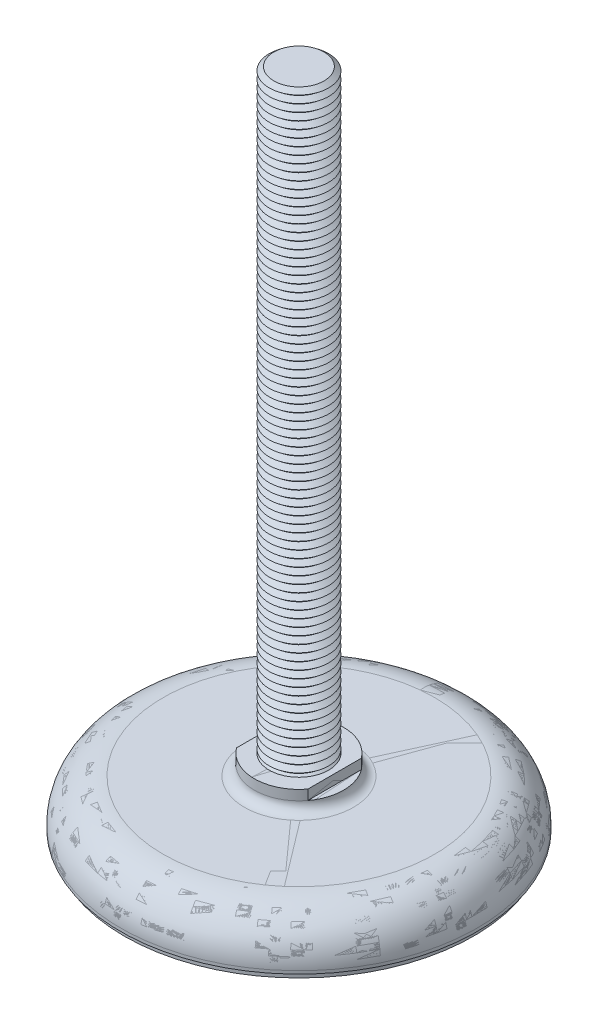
ISO-10303-21;
HEADER;
FILE_DESCRIPTION(('STEP AP214'),'2;1');
FILE_NAME('part.step','',(''),(''),'','','');
FILE_SCHEMA(('AUTOMOTIVE_DESIGN { 1 0 10303 214 1 1 1 1 }'));
ENDSEC;
DATA;
#1=APPLICATION_CONTEXT('core data for automotive mechanical design processes');
#2=APPLICATION_PROTOCOL_DEFINITION('international standard','automotive_design',2000,#1);
#3=PRODUCT_CONTEXT('',#1,'mechanical');
#4=PRODUCT('Part','Part','',(#3));
#5=PRODUCT_RELATED_PRODUCT_CATEGORY('part','',(#4));
#6=PRODUCT_DEFINITION_FORMATION('','',#4);
#7=PRODUCT_DEFINITION_CONTEXT('part definition',#1,'design');
#8=PRODUCT_DEFINITION('design','',#6,#7);
#9=PRODUCT_DEFINITION_SHAPE('','',#8);
#10=(LENGTH_UNIT() NAMED_UNIT(*) SI_UNIT(.MILLI.,.METRE.));
#11=(NAMED_UNIT(*) PLANE_ANGLE_UNIT() SI_UNIT($,.RADIAN.));
#12=(NAMED_UNIT(*) SI_UNIT($,.STERADIAN.) SOLID_ANGLE_UNIT());
#13=UNCERTAINTY_MEASURE_WITH_UNIT(LENGTH_MEASURE(1.E-05),#10,'distance_accuracy_value','');
#14=(GEOMETRIC_REPRESENTATION_CONTEXT(3) GLOBAL_UNCERTAINTY_ASSIGNED_CONTEXT((#13)) GLOBAL_UNIT_ASSIGNED_CONTEXT((#10,
#11,#12)) REPRESENTATION_CONTEXT('',''));
#15=CARTESIAN_POINT('',(0.,0.,0.));
#16=DIRECTION('',(0.,0.,1.));
#17=DIRECTION('',(1.,0.,0.));
#18=AXIS2_PLACEMENT_3D('',#15,#16,#17);
#19=CARTESIAN_POINT('',(0.,218.5,0.));
#20=DIRECTION('',(0.,-1.,0.));
#21=DIRECTION('',(0.998136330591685,0.,-0.0610234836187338));
#22=AXIS2_PLACEMENT_3D('',#19,#20,#21);
#23=CONICAL_SURFACE('',#22,8.4387505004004,0.895664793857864);
#24=CARTESIAN_POINT('',(0.,217.25,0.));
#25=DIRECTION('',(0.,-1.,0.));
#26=DIRECTION('',(0.998136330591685,0.,-0.0610234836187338));
#27=AXIS2_PLACEMENT_3D('',#24,#25,#26);
#28=CIRCLE('',#27,10.);
#29=CARTESIAN_POINT('',(9.98136330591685,217.25,-0.610234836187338));
#30=VERTEX_POINT('',#29);
#31=EDGE_CURVE('P0_E37',#30,#30,#28,.T.);
#32=ORIENTED_EDGE('',*,*,#31,.F.);
#33=EDGE_LOOP('',(#32));
#34=FACE_BOUND('',#33,.T.);
#35=CARTESIAN_POINT('',(0.,218.5,0.));
#36=DIRECTION('',(0.,-1.,0.));
#37=DIRECTION('',(0.998136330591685,0.,-0.0610234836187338));
#38=AXIS2_PLACEMENT_3D('',#35,#36,#37);
#39=CIRCLE('',#38,8.4387505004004);
#40=CARTESIAN_POINT('',(8.42302345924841,218.5,-0.514961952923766));
#41=VERTEX_POINT('',#40);
#42=EDGE_CURVE('P0_E25',#41,#41,#39,.T.);
#43=ORIENTED_EDGE('',*,*,#42,.T.);
#44=EDGE_LOOP('',(#43));
#45=FACE_BOUND('',#44,.T.);
#46=ADVANCED_FACE('P0_F14',(#34,#45),#23,.T.);
#47=CARTESIAN_POINT('',(0.,219.75,0.));
#48=DIRECTION('',(0.,1.,0.));
#49=DIRECTION('',(-0.998136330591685,0.,0.0610234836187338));
#50=AXIS2_PLACEMENT_3D('',#47,#48,#49);
#51=CONICAL_SURFACE('',#50,10.,0.895664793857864);
#52=ORIENTED_EDGE('',*,*,#42,.F.);
#53=EDGE_LOOP('',(#52));
#54=FACE_BOUND('',#53,.T.);
#55=CARTESIAN_POINT('',(0.,219.75,0.));
#56=DIRECTION('',(0.,-1.,0.));
#57=DIRECTION('',(0.998136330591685,0.,-0.0610234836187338));
#58=AXIS2_PLACEMENT_3D('',#55,#56,#57);
#59=CIRCLE('',#58,10.);
#60=CARTESIAN_POINT('',(9.98136330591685,219.75,-0.610234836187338));
#61=VERTEX_POINT('',#60);
#62=EDGE_CURVE('P0_E29',#61,#61,#59,.T.);
#63=ORIENTED_EDGE('',*,*,#62,.T.);
#64=EDGE_LOOP('',(#63));
#65=FACE_BOUND('',#64,.T.);
#66=ADVANCED_FACE('P0_F1537',(#54,#65),#51,.T.);
#67=CARTESIAN_POINT('',(0.,221.,0.));
#68=DIRECTION('',(0.,1.,0.));
#69=DIRECTION('',(-0.998136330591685,0.,0.0610234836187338));
#70=AXIS2_PLACEMENT_3D('',#67,#68,#69);
#71=PLANE('',#70);
#72=CARTESIAN_POINT('',(0.,221.,0.));
#73=DIRECTION('',(0.,-1.,0.));
#74=DIRECTION('',(0.998136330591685,0.,-0.0610234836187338));
#75=AXIS2_PLACEMENT_3D('',#72,#73,#74);
#76=CIRCLE('',#75,8.4387505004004);
#77=CARTESIAN_POINT('',(8.42302345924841,221.,-0.514961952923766));
#78=VERTEX_POINT('',#77);
#79=EDGE_CURVE('P0_E21',#78,#78,#76,.T.);
#80=ORIENTED_EDGE('',*,*,#79,.F.);
#81=EDGE_LOOP('',(#80));
#82=FACE_BOUND('',#81,.T.);
#83=ADVANCED_FACE('P0_F1543',(#82),#71,.T.);
#84=CARTESIAN_POINT('',(0.,221.,0.));
#85=DIRECTION('',(0.,-1.,0.));
#86=DIRECTION('',(0.998136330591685,0.,-0.0610234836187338));
#87=AXIS2_PLACEMENT_3D('',#84,#85,#86);
#88=CONICAL_SURFACE('',#87,8.4387505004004,0.895664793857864);
#89=ORIENTED_EDGE('',*,*,#62,.F.);
#90=EDGE_LOOP('',(#89));
#91=FACE_BOUND('',#90,.T.);
#92=ORIENTED_EDGE('',*,*,#79,.T.);
#93=EDGE_LOOP('',(#92));
#94=FACE_BOUND('',#93,.T.);
#95=ADVANCED_FACE('P0_F1526',(#91,#94),#88,.T.);
#96=CARTESIAN_POINT('',(0.,216.,0.));
#97=DIRECTION('',(0.,-1.,0.));
#98=DIRECTION('',(0.998136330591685,0.,-0.0610234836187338));
#99=AXIS2_PLACEMENT_3D('',#96,#97,#98);
#100=CONICAL_SURFACE('',#99,8.4387505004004,0.895664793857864);
#101=CARTESIAN_POINT('',(0.,214.75,0.));
#102=DIRECTION('',(0.,-1.,0.));
#103=DIRECTION('',(0.998136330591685,0.,-0.0610234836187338));
#104=AXIS2_PLACEMENT_3D('',#101,#102,#103);
#105=CIRCLE('',#104,10.);
#106=CARTESIAN_POINT('',(9.98136330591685,214.75,-0.610234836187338));
#107=VERTEX_POINT('',#106);
#108=EDGE_CURVE('P0_E43',#107,#107,#105,.T.);
#109=ORIENTED_EDGE('',*,*,#108,.F.);
#110=EDGE_LOOP('',(#109));
#111=FACE_BOUND('',#110,.T.);
#112=CARTESIAN_POINT('',(0.,216.,0.));
#113=DIRECTION('',(0.,-1.,0.));
#114=DIRECTION('',(0.998136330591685,0.,-0.0610234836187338));
#115=AXIS2_PLACEMENT_3D('',#112,#113,#114);
#116=CIRCLE('',#115,8.4387505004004);
#117=CARTESIAN_POINT('',(8.42302345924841,216.,-0.514961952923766));
#118=VERTEX_POINT('',#117);
#119=EDGE_CURVE('P0_E34',#118,#118,#116,.T.);
#120=ORIENTED_EDGE('',*,*,#119,.T.);
#121=EDGE_LOOP('',(#120));
#122=FACE_BOUND('',#121,.T.);
#123=ADVANCED_FACE('P0_F1523',(#111,#122),#100,.T.);
#124=CARTESIAN_POINT('',(0.,217.25,0.));
#125=DIRECTION('',(0.,1.,0.));
#126=DIRECTION('',(-0.998136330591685,0.,0.0610234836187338));
#127=AXIS2_PLACEMENT_3D('',#124,#125,#126);
#128=CONICAL_SURFACE('',#127,10.,0.895664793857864);
#129=ORIENTED_EDGE('',*,*,#119,.F.);
#130=EDGE_LOOP('',(#129));
#131=FACE_BOUND('',#130,.T.);
#132=ORIENTED_EDGE('',*,*,#31,.T.);
#133=EDGE_LOOP('',(#132));
#134=FACE_BOUND('',#133,.T.);
#135=ADVANCED_FACE('P0_F1514',(#131,#134),#128,.T.);
#136=CARTESIAN_POINT('',(0.,213.5,0.));
#137=DIRECTION('',(0.,-1.,0.));
#138=DIRECTION('',(0.998136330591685,0.,-0.0610234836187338));
#139=AXIS2_PLACEMENT_3D('',#136,#137,#138);
#140=CONICAL_SURFACE('',#139,8.4387505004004,0.895664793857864);
#141=CARTESIAN_POINT('',(0.,212.25,0.));
#142=DIRECTION('',(0.,-1.,0.));
#143=DIRECTION('',(0.998136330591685,0.,-0.0610234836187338));
#144=AXIS2_PLACEMENT_3D('',#141,#142,#143);
#145=CIRCLE('',#144,10.);
#146=CARTESIAN_POINT('',(9.98136330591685,212.25,-0.610234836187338));
#147=VERTEX_POINT('',#146);
#148=EDGE_CURVE('P0_E49',#147,#147,#145,.T.);
#149=ORIENTED_EDGE('',*,*,#148,.F.);
#150=EDGE_LOOP('',(#149));
#151=FACE_BOUND('',#150,.T.);
#152=CARTESIAN_POINT('',(0.,213.5,0.));
#153=DIRECTION('',(0.,-1.,0.));
#154=DIRECTION('',(0.998136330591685,0.,-0.0610234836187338));
#155=AXIS2_PLACEMENT_3D('',#152,#153,#154);
#156=CIRCLE('',#155,8.4387505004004);
#157=CARTESIAN_POINT('',(8.42302345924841,213.5,-0.514961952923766));
#158=VERTEX_POINT('',#157);
#159=EDGE_CURVE('P0_E40',#158,#158,#156,.T.);
#160=ORIENTED_EDGE('',*,*,#159,.T.);
#161=EDGE_LOOP('',(#160));
#162=FACE_BOUND('',#161,.T.);
#163=ADVANCED_FACE('P0_F1511',(#151,#162),#140,.T.);
#164=CARTESIAN_POINT('',(0.,214.75,0.));
#165=DIRECTION('',(0.,1.,0.));
#166=DIRECTION('',(-0.998136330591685,0.,0.0610234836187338));
#167=AXIS2_PLACEMENT_3D('',#164,#165,#166);
#168=CONICAL_SURFACE('',#167,10.,0.895664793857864);
#169=ORIENTED_EDGE('',*,*,#159,.F.);
#170=EDGE_LOOP('',(#169));
#171=FACE_BOUND('',#170,.T.);
#172=ORIENTED_EDGE('',*,*,#108,.T.);
#173=EDGE_LOOP('',(#172));
#174=FACE_BOUND('',#173,.T.);
#175=ADVANCED_FACE('P0_F1502',(#171,#174),#168,.T.);
#176=CARTESIAN_POINT('',(0.,211.,0.));
#177=DIRECTION('',(0.,-1.,0.));
#178=DIRECTION('',(0.998136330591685,0.,-0.0610234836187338));
#179=AXIS2_PLACEMENT_3D('',#176,#177,#178);
#180=CONICAL_SURFACE('',#179,8.4387505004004,0.895664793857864);
#181=CARTESIAN_POINT('',(0.,209.75,0.));
#182=DIRECTION('',(0.,-1.,0.));
#183=DIRECTION('',(0.998136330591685,0.,-0.0610234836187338));
#184=AXIS2_PLACEMENT_3D('',#181,#182,#183);
#185=CIRCLE('',#184,10.);
#186=CARTESIAN_POINT('',(9.98136330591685,209.75,-0.610234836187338));
#187=VERTEX_POINT('',#186);
#188=EDGE_CURVE('P0_E55',#187,#187,#185,.T.);
#189=ORIENTED_EDGE('',*,*,#188,.F.);
#190=EDGE_LOOP('',(#189));
#191=FACE_BOUND('',#190,.T.);
#192=CARTESIAN_POINT('',(0.,211.,0.));
#193=DIRECTION('',(0.,-1.,0.));
#194=DIRECTION('',(0.998136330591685,0.,-0.0610234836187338));
#195=AXIS2_PLACEMENT_3D('',#192,#193,#194);
#196=CIRCLE('',#195,8.4387505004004);
#197=CARTESIAN_POINT('',(8.42302345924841,211.,-0.514961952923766));
#198=VERTEX_POINT('',#197);
#199=EDGE_CURVE('P0_E46',#198,#198,#196,.T.);
#200=ORIENTED_EDGE('',*,*,#199,.T.);
#201=EDGE_LOOP('',(#200));
#202=FACE_BOUND('',#201,.T.);
#203=ADVANCED_FACE('P0_F1499',(#191,#202),#180,.T.);
#204=CARTESIAN_POINT('',(0.,212.25,0.));
#205=DIRECTION('',(0.,1.,0.));
#206=DIRECTION('',(-0.998136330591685,0.,0.0610234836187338));
#207=AXIS2_PLACEMENT_3D('',#204,#205,#206);
#208=CONICAL_SURFACE('',#207,10.,0.895664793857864);
#209=ORIENTED_EDGE('',*,*,#199,.F.);
#210=EDGE_LOOP('',(#209));
#211=FACE_BOUND('',#210,.T.);
#212=ORIENTED_EDGE('',*,*,#148,.T.);
#213=EDGE_LOOP('',(#212));
#214=FACE_BOUND('',#213,.T.);
#215=ADVANCED_FACE('P0_F1490',(#211,#214),#208,.T.);
#216=CARTESIAN_POINT('',(0.,208.5,0.));
#217=DIRECTION('',(0.,-1.,0.));
#218=DIRECTION('',(0.998136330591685,0.,-0.0610234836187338));
#219=AXIS2_PLACEMENT_3D('',#216,#217,#218);
#220=CONICAL_SURFACE('',#219,8.4387505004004,0.895664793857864);
#221=CARTESIAN_POINT('',(0.,207.25,0.));
#222=DIRECTION('',(0.,-1.,0.));
#223=DIRECTION('',(0.998136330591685,0.,-0.0610234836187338));
#224=AXIS2_PLACEMENT_3D('',#221,#222,#223);
#225=CIRCLE('',#224,10.);
#226=CARTESIAN_POINT('',(9.98136330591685,207.25,-0.610234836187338));
#227=VERTEX_POINT('',#226);
#228=EDGE_CURVE('P0_E61',#227,#227,#225,.T.);
#229=ORIENTED_EDGE('',*,*,#228,.F.);
#230=EDGE_LOOP('',(#229));
#231=FACE_BOUND('',#230,.T.);
#232=CARTESIAN_POINT('',(0.,208.5,0.));
#233=DIRECTION('',(0.,-1.,0.));
#234=DIRECTION('',(0.998136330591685,0.,-0.0610234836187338));
#235=AXIS2_PLACEMENT_3D('',#232,#233,#234);
#236=CIRCLE('',#235,8.4387505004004);
#237=CARTESIAN_POINT('',(8.42302345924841,208.5,-0.514961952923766));
#238=VERTEX_POINT('',#237);
#239=EDGE_CURVE('P0_E52',#238,#238,#236,.T.);
#240=ORIENTED_EDGE('',*,*,#239,.T.);
#241=EDGE_LOOP('',(#240));
#242=FACE_BOUND('',#241,.T.);
#243=ADVANCED_FACE('P0_F1487',(#231,#242),#220,.T.);
#244=CARTESIAN_POINT('',(0.,209.75,0.));
#245=DIRECTION('',(0.,1.,0.));
#246=DIRECTION('',(-0.998136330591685,0.,0.0610234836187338));
#247=AXIS2_PLACEMENT_3D('',#244,#245,#246);
#248=CONICAL_SURFACE('',#247,10.,0.895664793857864);
#249=ORIENTED_EDGE('',*,*,#239,.F.);
#250=EDGE_LOOP('',(#249));
#251=FACE_BOUND('',#250,.T.);
#252=ORIENTED_EDGE('',*,*,#188,.T.);
#253=EDGE_LOOP('',(#252));
#254=FACE_BOUND('',#253,.T.);
#255=ADVANCED_FACE('P0_F1478',(#251,#254),#248,.T.);
#256=CARTESIAN_POINT('',(0.,206.,0.));
#257=DIRECTION('',(0.,-1.,0.));
#258=DIRECTION('',(0.998136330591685,0.,-0.0610234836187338));
#259=AXIS2_PLACEMENT_3D('',#256,#257,#258);
#260=CONICAL_SURFACE('',#259,8.4387505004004,0.895664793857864);
#261=CARTESIAN_POINT('',(0.,204.75,0.));
#262=DIRECTION('',(0.,-1.,0.));
#263=DIRECTION('',(0.998136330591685,0.,-0.0610234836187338));
#264=AXIS2_PLACEMENT_3D('',#261,#262,#263);
#265=CIRCLE('',#264,10.);
#266=CARTESIAN_POINT('',(9.98136330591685,204.75,-0.610234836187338));
#267=VERTEX_POINT('',#266);
#268=EDGE_CURVE('P0_E67',#267,#267,#265,.T.);
#269=ORIENTED_EDGE('',*,*,#268,.F.);
#270=EDGE_LOOP('',(#269));
#271=FACE_BOUND('',#270,.T.);
#272=CARTESIAN_POINT('',(0.,206.,0.));
#273=DIRECTION('',(0.,-1.,0.));
#274=DIRECTION('',(0.998136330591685,0.,-0.0610234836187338));
#275=AXIS2_PLACEMENT_3D('',#272,#273,#274);
#276=CIRCLE('',#275,8.4387505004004);
#277=CARTESIAN_POINT('',(8.42302345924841,206.,-0.514961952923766));
#278=VERTEX_POINT('',#277);
#279=EDGE_CURVE('P0_E58',#278,#278,#276,.T.);
#280=ORIENTED_EDGE('',*,*,#279,.T.);
#281=EDGE_LOOP('',(#280));
#282=FACE_BOUND('',#281,.T.);
#283=ADVANCED_FACE('P0_F1475',(#271,#282),#260,.T.);
#284=CARTESIAN_POINT('',(0.,207.25,0.));
#285=DIRECTION('',(0.,1.,0.));
#286=DIRECTION('',(-0.998136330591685,0.,0.0610234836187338));
#287=AXIS2_PLACEMENT_3D('',#284,#285,#286);
#288=CONICAL_SURFACE('',#287,10.,0.895664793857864);
#289=ORIENTED_EDGE('',*,*,#279,.F.);
#290=EDGE_LOOP('',(#289));
#291=FACE_BOUND('',#290,.T.);
#292=ORIENTED_EDGE('',*,*,#228,.T.);
#293=EDGE_LOOP('',(#292));
#294=FACE_BOUND('',#293,.T.);
#295=ADVANCED_FACE('P0_F1466',(#291,#294),#288,.T.);
#296=CARTESIAN_POINT('',(0.,203.5,0.));
#297=DIRECTION('',(0.,-1.,0.));
#298=DIRECTION('',(0.998136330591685,0.,-0.0610234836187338));
#299=AXIS2_PLACEMENT_3D('',#296,#297,#298);
#300=CONICAL_SURFACE('',#299,8.4387505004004,0.895664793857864);
#301=CARTESIAN_POINT('',(0.,202.25,0.));
#302=DIRECTION('',(0.,-1.,0.));
#303=DIRECTION('',(0.998136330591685,0.,-0.0610234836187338));
#304=AXIS2_PLACEMENT_3D('',#301,#302,#303);
#305=CIRCLE('',#304,10.);
#306=CARTESIAN_POINT('',(9.98136330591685,202.25,-0.610234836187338));
#307=VERTEX_POINT('',#306);
#308=EDGE_CURVE('P0_E73',#307,#307,#305,.T.);
#309=ORIENTED_EDGE('',*,*,#308,.F.);
#310=EDGE_LOOP('',(#309));
#311=FACE_BOUND('',#310,.T.);
#312=CARTESIAN_POINT('',(0.,203.5,0.));
#313=DIRECTION('',(0.,-1.,0.));
#314=DIRECTION('',(0.998136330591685,0.,-0.0610234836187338));
#315=AXIS2_PLACEMENT_3D('',#312,#313,#314);
#316=CIRCLE('',#315,8.4387505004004);
#317=CARTESIAN_POINT('',(8.42302345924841,203.5,-0.514961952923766));
#318=VERTEX_POINT('',#317);
#319=EDGE_CURVE('P0_E64',#318,#318,#316,.T.);
#320=ORIENTED_EDGE('',*,*,#319,.T.);
#321=EDGE_LOOP('',(#320));
#322=FACE_BOUND('',#321,.T.);
#323=ADVANCED_FACE('P0_F1463',(#311,#322),#300,.T.);
#324=CARTESIAN_POINT('',(0.,204.75,0.));
#325=DIRECTION('',(0.,1.,0.));
#326=DIRECTION('',(-0.998136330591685,0.,0.0610234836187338));
#327=AXIS2_PLACEMENT_3D('',#324,#325,#326);
#328=CONICAL_SURFACE('',#327,10.,0.895664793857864);
#329=ORIENTED_EDGE('',*,*,#319,.F.);
#330=EDGE_LOOP('',(#329));
#331=FACE_BOUND('',#330,.T.);
#332=ORIENTED_EDGE('',*,*,#268,.T.);
#333=EDGE_LOOP('',(#332));
#334=FACE_BOUND('',#333,.T.);
#335=ADVANCED_FACE('P0_F1454',(#331,#334),#328,.T.);
#336=CARTESIAN_POINT('',(0.,201.,0.));
#337=DIRECTION('',(0.,-1.,0.));
#338=DIRECTION('',(0.998136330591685,0.,-0.0610234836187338));
#339=AXIS2_PLACEMENT_3D('',#336,#337,#338);
#340=CONICAL_SURFACE('',#339,8.4387505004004,0.895664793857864);
#341=CARTESIAN_POINT('',(0.,199.75,0.));
#342=DIRECTION('',(0.,-1.,0.));
#343=DIRECTION('',(0.998136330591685,0.,-0.0610234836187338));
#344=AXIS2_PLACEMENT_3D('',#341,#342,#343);
#345=CIRCLE('',#344,10.);
#346=CARTESIAN_POINT('',(9.98136330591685,199.75,-0.610234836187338));
#347=VERTEX_POINT('',#346);
#348=EDGE_CURVE('P0_E79',#347,#347,#345,.T.);
#349=ORIENTED_EDGE('',*,*,#348,.F.);
#350=EDGE_LOOP('',(#349));
#351=FACE_BOUND('',#350,.T.);
#352=CARTESIAN_POINT('',(0.,201.,0.));
#353=DIRECTION('',(0.,-1.,0.));
#354=DIRECTION('',(0.998136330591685,0.,-0.0610234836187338));
#355=AXIS2_PLACEMENT_3D('',#352,#353,#354);
#356=CIRCLE('',#355,8.4387505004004);
#357=CARTESIAN_POINT('',(8.42302345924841,201.,-0.514961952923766));
#358=VERTEX_POINT('',#357);
#359=EDGE_CURVE('P0_E70',#358,#358,#356,.T.);
#360=ORIENTED_EDGE('',*,*,#359,.T.);
#361=EDGE_LOOP('',(#360));
#362=FACE_BOUND('',#361,.T.);
#363=ADVANCED_FACE('P0_F1451',(#351,#362),#340,.T.);
#364=CARTESIAN_POINT('',(0.,202.25,0.));
#365=DIRECTION('',(0.,1.,0.));
#366=DIRECTION('',(-0.998136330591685,0.,0.0610234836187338));
#367=AXIS2_PLACEMENT_3D('',#364,#365,#366);
#368=CONICAL_SURFACE('',#367,10.,0.895664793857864);
#369=ORIENTED_EDGE('',*,*,#359,.F.);
#370=EDGE_LOOP('',(#369));
#371=FACE_BOUND('',#370,.T.);
#372=ORIENTED_EDGE('',*,*,#308,.T.);
#373=EDGE_LOOP('',(#372));
#374=FACE_BOUND('',#373,.T.);
#375=ADVANCED_FACE('P0_F1442',(#371,#374),#368,.T.);
#376=CARTESIAN_POINT('',(0.,198.5,0.));
#377=DIRECTION('',(0.,-1.,0.));
#378=DIRECTION('',(0.998136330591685,0.,-0.0610234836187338));
#379=AXIS2_PLACEMENT_3D('',#376,#377,#378);
#380=CONICAL_SURFACE('',#379,8.4387505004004,0.895664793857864);
#381=CARTESIAN_POINT('',(0.,197.25,0.));
#382=DIRECTION('',(0.,-1.,0.));
#383=DIRECTION('',(0.998136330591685,0.,-0.0610234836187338));
#384=AXIS2_PLACEMENT_3D('',#381,#382,#383);
#385=CIRCLE('',#384,10.);
#386=CARTESIAN_POINT('',(9.98136330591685,197.25,-0.610234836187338));
#387=VERTEX_POINT('',#386);
#388=EDGE_CURVE('P0_E85',#387,#387,#385,.T.);
#389=ORIENTED_EDGE('',*,*,#388,.F.);
#390=EDGE_LOOP('',(#389));
#391=FACE_BOUND('',#390,.T.);
#392=CARTESIAN_POINT('',(0.,198.5,0.));
#393=DIRECTION('',(0.,-1.,0.));
#394=DIRECTION('',(0.998136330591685,0.,-0.0610234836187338));
#395=AXIS2_PLACEMENT_3D('',#392,#393,#394);
#396=CIRCLE('',#395,8.4387505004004);
#397=CARTESIAN_POINT('',(8.42302345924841,198.5,-0.514961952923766));
#398=VERTEX_POINT('',#397);
#399=EDGE_CURVE('P0_E76',#398,#398,#396,.T.);
#400=ORIENTED_EDGE('',*,*,#399,.T.);
#401=EDGE_LOOP('',(#400));
#402=FACE_BOUND('',#401,.T.);
#403=ADVANCED_FACE('P0_F1439',(#391,#402),#380,.T.);
#404=CARTESIAN_POINT('',(0.,199.75,0.));
#405=DIRECTION('',(0.,1.,0.));
#406=DIRECTION('',(-0.998136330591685,0.,0.0610234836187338));
#407=AXIS2_PLACEMENT_3D('',#404,#405,#406);
#408=CONICAL_SURFACE('',#407,10.,0.895664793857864);
#409=ORIENTED_EDGE('',*,*,#399,.F.);
#410=EDGE_LOOP('',(#409));
#411=FACE_BOUND('',#410,.T.);
#412=ORIENTED_EDGE('',*,*,#348,.T.);
#413=EDGE_LOOP('',(#412));
#414=FACE_BOUND('',#413,.T.);
#415=ADVANCED_FACE('P0_F1430',(#411,#414),#408,.T.);
#416=CARTESIAN_POINT('',(0.,196.,0.));
#417=DIRECTION('',(0.,-1.,0.));
#418=DIRECTION('',(0.998136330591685,0.,-0.0610234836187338));
#419=AXIS2_PLACEMENT_3D('',#416,#417,#418);
#420=CONICAL_SURFACE('',#419,8.4387505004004,0.895664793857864);
#421=CARTESIAN_POINT('',(0.,194.75,0.));
#422=DIRECTION('',(0.,-1.,0.));
#423=DIRECTION('',(0.998136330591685,0.,-0.0610234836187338));
#424=AXIS2_PLACEMENT_3D('',#421,#422,#423);
#425=CIRCLE('',#424,10.);
#426=CARTESIAN_POINT('',(9.98136330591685,194.75,-0.610234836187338));
#427=VERTEX_POINT('',#426);
#428=EDGE_CURVE('P0_E91',#427,#427,#425,.T.);
#429=ORIENTED_EDGE('',*,*,#428,.F.);
#430=EDGE_LOOP('',(#429));
#431=FACE_BOUND('',#430,.T.);
#432=CARTESIAN_POINT('',(0.,196.,0.));
#433=DIRECTION('',(0.,-1.,0.));
#434=DIRECTION('',(0.998136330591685,0.,-0.0610234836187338));
#435=AXIS2_PLACEMENT_3D('',#432,#433,#434);
#436=CIRCLE('',#435,8.4387505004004);
#437=CARTESIAN_POINT('',(8.42302345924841,196.,-0.514961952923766));
#438=VERTEX_POINT('',#437);
#439=EDGE_CURVE('P0_E82',#438,#438,#436,.T.);
#440=ORIENTED_EDGE('',*,*,#439,.T.);
#441=EDGE_LOOP('',(#440));
#442=FACE_BOUND('',#441,.T.);
#443=ADVANCED_FACE('P0_F1427',(#431,#442),#420,.T.);
#444=CARTESIAN_POINT('',(0.,197.25,0.));
#445=DIRECTION('',(0.,1.,0.));
#446=DIRECTION('',(-0.998136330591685,0.,0.0610234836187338));
#447=AXIS2_PLACEMENT_3D('',#444,#445,#446);
#448=CONICAL_SURFACE('',#447,10.,0.895664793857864);
#449=ORIENTED_EDGE('',*,*,#439,.F.);
#450=EDGE_LOOP('',(#449));
#451=FACE_BOUND('',#450,.T.);
#452=ORIENTED_EDGE('',*,*,#388,.T.);
#453=EDGE_LOOP('',(#452));
#454=FACE_BOUND('',#453,.T.);
#455=ADVANCED_FACE('P0_F1418',(#451,#454),#448,.T.);
#456=CARTESIAN_POINT('',(0.,193.5,0.));
#457=DIRECTION('',(0.,-1.,0.));
#458=DIRECTION('',(0.998136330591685,0.,-0.0610234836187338));
#459=AXIS2_PLACEMENT_3D('',#456,#457,#458);
#460=CONICAL_SURFACE('',#459,8.4387505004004,0.895664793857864);
#461=CARTESIAN_POINT('',(0.,192.25,0.));
#462=DIRECTION('',(0.,-1.,0.));
#463=DIRECTION('',(0.998136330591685,0.,-0.0610234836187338));
#464=AXIS2_PLACEMENT_3D('',#461,#462,#463);
#465=CIRCLE('',#464,10.);
#466=CARTESIAN_POINT('',(9.98136330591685,192.25,-0.610234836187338));
#467=VERTEX_POINT('',#466);
#468=EDGE_CURVE('P0_E97',#467,#467,#465,.T.);
#469=ORIENTED_EDGE('',*,*,#468,.F.);
#470=EDGE_LOOP('',(#469));
#471=FACE_BOUND('',#470,.T.);
#472=CARTESIAN_POINT('',(0.,193.5,0.));
#473=DIRECTION('',(0.,-1.,0.));
#474=DIRECTION('',(0.998136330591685,0.,-0.0610234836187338));
#475=AXIS2_PLACEMENT_3D('',#472,#473,#474);
#476=CIRCLE('',#475,8.4387505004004);
#477=CARTESIAN_POINT('',(8.42302345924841,193.5,-0.514961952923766));
#478=VERTEX_POINT('',#477);
#479=EDGE_CURVE('P0_E88',#478,#478,#476,.T.);
#480=ORIENTED_EDGE('',*,*,#479,.T.);
#481=EDGE_LOOP('',(#480));
#482=FACE_BOUND('',#481,.T.);
#483=ADVANCED_FACE('P0_F1415',(#471,#482),#460,.T.);
#484=CARTESIAN_POINT('',(0.,194.75,0.));
#485=DIRECTION('',(0.,1.,0.));
#486=DIRECTION('',(-0.998136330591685,0.,0.0610234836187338));
#487=AXIS2_PLACEMENT_3D('',#484,#485,#486);
#488=CONICAL_SURFACE('',#487,10.,0.895664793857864);
#489=ORIENTED_EDGE('',*,*,#479,.F.);
#490=EDGE_LOOP('',(#489));
#491=FACE_BOUND('',#490,.T.);
#492=ORIENTED_EDGE('',*,*,#428,.T.);
#493=EDGE_LOOP('',(#492));
#494=FACE_BOUND('',#493,.T.);
#495=ADVANCED_FACE('P0_F1406',(#491,#494),#488,.T.);
#496=CARTESIAN_POINT('',(0.,191.,0.));
#497=DIRECTION('',(0.,-1.,0.));
#498=DIRECTION('',(0.998136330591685,0.,-0.0610234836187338));
#499=AXIS2_PLACEMENT_3D('',#496,#497,#498);
#500=CONICAL_SURFACE('',#499,8.4387505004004,0.895664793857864);
#501=CARTESIAN_POINT('',(0.,189.75,0.));
#502=DIRECTION('',(0.,-1.,0.));
#503=DIRECTION('',(0.998136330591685,0.,-0.0610234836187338));
#504=AXIS2_PLACEMENT_3D('',#501,#502,#503);
#505=CIRCLE('',#504,10.);
#506=CARTESIAN_POINT('',(9.98136330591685,189.75,-0.610234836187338));
#507=VERTEX_POINT('',#506);
#508=EDGE_CURVE('P0_E103',#507,#507,#505,.T.);
#509=ORIENTED_EDGE('',*,*,#508,.F.);
#510=EDGE_LOOP('',(#509));
#511=FACE_BOUND('',#510,.T.);
#512=CARTESIAN_POINT('',(0.,191.,0.));
#513=DIRECTION('',(0.,-1.,0.));
#514=DIRECTION('',(0.998136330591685,0.,-0.0610234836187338));
#515=AXIS2_PLACEMENT_3D('',#512,#513,#514);
#516=CIRCLE('',#515,8.4387505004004);
#517=CARTESIAN_POINT('',(8.42302345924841,191.,-0.514961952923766));
#518=VERTEX_POINT('',#517);
#519=EDGE_CURVE('P0_E94',#518,#518,#516,.T.);
#520=ORIENTED_EDGE('',*,*,#519,.T.);
#521=EDGE_LOOP('',(#520));
#522=FACE_BOUND('',#521,.T.);
#523=ADVANCED_FACE('P0_F1403',(#511,#522),#500,.T.);
#524=CARTESIAN_POINT('',(0.,192.25,0.));
#525=DIRECTION('',(0.,1.,0.));
#526=DIRECTION('',(-0.998136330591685,0.,0.0610234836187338));
#527=AXIS2_PLACEMENT_3D('',#524,#525,#526);
#528=CONICAL_SURFACE('',#527,10.,0.895664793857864);
#529=ORIENTED_EDGE('',*,*,#519,.F.);
#530=EDGE_LOOP('',(#529));
#531=FACE_BOUND('',#530,.T.);
#532=ORIENTED_EDGE('',*,*,#468,.T.);
#533=EDGE_LOOP('',(#532));
#534=FACE_BOUND('',#533,.T.);
#535=ADVANCED_FACE('P0_F1394',(#531,#534),#528,.T.);
#536=CARTESIAN_POINT('',(0.,188.5,0.));
#537=DIRECTION('',(0.,-1.,0.));
#538=DIRECTION('',(0.998136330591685,0.,-0.0610234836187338));
#539=AXIS2_PLACEMENT_3D('',#536,#537,#538);
#540=CONICAL_SURFACE('',#539,8.4387505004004,0.895664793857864);
#541=CARTESIAN_POINT('',(0.,187.25,0.));
#542=DIRECTION('',(0.,-1.,0.));
#543=DIRECTION('',(0.998136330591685,0.,-0.0610234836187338));
#544=AXIS2_PLACEMENT_3D('',#541,#542,#543);
#545=CIRCLE('',#544,10.);
#546=CARTESIAN_POINT('',(9.98136330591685,187.25,-0.610234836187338));
#547=VERTEX_POINT('',#546);
#548=EDGE_CURVE('P0_E109',#547,#547,#545,.T.);
#549=ORIENTED_EDGE('',*,*,#548,.F.);
#550=EDGE_LOOP('',(#549));
#551=FACE_BOUND('',#550,.T.);
#552=CARTESIAN_POINT('',(0.,188.5,0.));
#553=DIRECTION('',(0.,-1.,0.));
#554=DIRECTION('',(0.998136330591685,0.,-0.0610234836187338));
#555=AXIS2_PLACEMENT_3D('',#552,#553,#554);
#556=CIRCLE('',#555,8.4387505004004);
#557=CARTESIAN_POINT('',(8.42302345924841,188.5,-0.514961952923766));
#558=VERTEX_POINT('',#557);
#559=EDGE_CURVE('P0_E100',#558,#558,#556,.T.);
#560=ORIENTED_EDGE('',*,*,#559,.T.);
#561=EDGE_LOOP('',(#560));
#562=FACE_BOUND('',#561,.T.);
#563=ADVANCED_FACE('P0_F1391',(#551,#562),#540,.T.);
#564=CARTESIAN_POINT('',(0.,189.75,0.));
#565=DIRECTION('',(0.,1.,0.));
#566=DIRECTION('',(-0.998136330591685,0.,0.0610234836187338));
#567=AXIS2_PLACEMENT_3D('',#564,#565,#566);
#568=CONICAL_SURFACE('',#567,10.,0.895664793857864);
#569=ORIENTED_EDGE('',*,*,#559,.F.);
#570=EDGE_LOOP('',(#569));
#571=FACE_BOUND('',#570,.T.);
#572=ORIENTED_EDGE('',*,*,#508,.T.);
#573=EDGE_LOOP('',(#572));
#574=FACE_BOUND('',#573,.T.);
#575=ADVANCED_FACE('P0_F1382',(#571,#574),#568,.T.);
#576=CARTESIAN_POINT('',(0.,186.,0.));
#577=DIRECTION('',(0.,-1.,0.));
#578=DIRECTION('',(0.998136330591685,0.,-0.0610234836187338));
#579=AXIS2_PLACEMENT_3D('',#576,#577,#578);
#580=CONICAL_SURFACE('',#579,8.4387505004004,0.895664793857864);
#581=CARTESIAN_POINT('',(0.,184.75,0.));
#582=DIRECTION('',(0.,-1.,0.));
#583=DIRECTION('',(0.998136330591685,0.,-0.0610234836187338));
#584=AXIS2_PLACEMENT_3D('',#581,#582,#583);
#585=CIRCLE('',#584,10.);
#586=CARTESIAN_POINT('',(9.98136330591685,184.75,-0.610234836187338));
#587=VERTEX_POINT('',#586);
#588=EDGE_CURVE('P0_E115',#587,#587,#585,.T.);
#589=ORIENTED_EDGE('',*,*,#588,.F.);
#590=EDGE_LOOP('',(#589));
#591=FACE_BOUND('',#590,.T.);
#592=CARTESIAN_POINT('',(0.,186.,0.));
#593=DIRECTION('',(0.,-1.,0.));
#594=DIRECTION('',(0.998136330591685,0.,-0.0610234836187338));
#595=AXIS2_PLACEMENT_3D('',#592,#593,#594);
#596=CIRCLE('',#595,8.4387505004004);
#597=CARTESIAN_POINT('',(8.42302345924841,186.,-0.514961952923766));
#598=VERTEX_POINT('',#597);
#599=EDGE_CURVE('P0_E106',#598,#598,#596,.T.);
#600=ORIENTED_EDGE('',*,*,#599,.T.);
#601=EDGE_LOOP('',(#600));
#602=FACE_BOUND('',#601,.T.);
#603=ADVANCED_FACE('P0_F1379',(#591,#602),#580,.T.);
#604=CARTESIAN_POINT('',(0.,187.25,0.));
#605=DIRECTION('',(0.,1.,0.));
#606=DIRECTION('',(-0.998136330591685,0.,0.0610234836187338));
#607=AXIS2_PLACEMENT_3D('',#604,#605,#606);
#608=CONICAL_SURFACE('',#607,10.,0.895664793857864);
#609=ORIENTED_EDGE('',*,*,#599,.F.);
#610=EDGE_LOOP('',(#609));
#611=FACE_BOUND('',#610,.T.);
#612=ORIENTED_EDGE('',*,*,#548,.T.);
#613=EDGE_LOOP('',(#612));
#614=FACE_BOUND('',#613,.T.);
#615=ADVANCED_FACE('P0_F1370',(#611,#614),#608,.T.);
#616=CARTESIAN_POINT('',(0.,183.5,0.));
#617=DIRECTION('',(0.,-1.,0.));
#618=DIRECTION('',(0.998136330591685,0.,-0.0610234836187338));
#619=AXIS2_PLACEMENT_3D('',#616,#617,#618);
#620=CONICAL_SURFACE('',#619,8.4387505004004,0.895664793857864);
#621=CARTESIAN_POINT('',(0.,182.25,0.));
#622=DIRECTION('',(0.,-1.,0.));
#623=DIRECTION('',(0.998136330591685,0.,-0.0610234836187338));
#624=AXIS2_PLACEMENT_3D('',#621,#622,#623);
#625=CIRCLE('',#624,10.);
#626=CARTESIAN_POINT('',(9.98136330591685,182.25,-0.610234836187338));
#627=VERTEX_POINT('',#626);
#628=EDGE_CURVE('P0_E121',#627,#627,#625,.T.);
#629=ORIENTED_EDGE('',*,*,#628,.F.);
#630=EDGE_LOOP('',(#629));
#631=FACE_BOUND('',#630,.T.);
#632=CARTESIAN_POINT('',(0.,183.5,0.));
#633=DIRECTION('',(0.,-1.,0.));
#634=DIRECTION('',(0.998136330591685,0.,-0.0610234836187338));
#635=AXIS2_PLACEMENT_3D('',#632,#633,#634);
#636=CIRCLE('',#635,8.4387505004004);
#637=CARTESIAN_POINT('',(8.42302345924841,183.5,-0.514961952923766));
#638=VERTEX_POINT('',#637);
#639=EDGE_CURVE('P0_E112',#638,#638,#636,.T.);
#640=ORIENTED_EDGE('',*,*,#639,.T.);
#641=EDGE_LOOP('',(#640));
#642=FACE_BOUND('',#641,.T.);
#643=ADVANCED_FACE('P0_F1367',(#631,#642),#620,.T.);
#644=CARTESIAN_POINT('',(0.,184.75,0.));
#645=DIRECTION('',(0.,1.,0.));
#646=DIRECTION('',(-0.998136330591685,0.,0.0610234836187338));
#647=AXIS2_PLACEMENT_3D('',#644,#645,#646);
#648=CONICAL_SURFACE('',#647,10.,0.895664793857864);
#649=ORIENTED_EDGE('',*,*,#639,.F.);
#650=EDGE_LOOP('',(#649));
#651=FACE_BOUND('',#650,.T.);
#652=ORIENTED_EDGE('',*,*,#588,.T.);
#653=EDGE_LOOP('',(#652));
#654=FACE_BOUND('',#653,.T.);
#655=ADVANCED_FACE('P0_F1358',(#651,#654),#648,.T.);
#656=CARTESIAN_POINT('',(0.,181.,0.));
#657=DIRECTION('',(0.,-1.,0.));
#658=DIRECTION('',(0.998136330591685,0.,-0.0610234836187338));
#659=AXIS2_PLACEMENT_3D('',#656,#657,#658);
#660=CONICAL_SURFACE('',#659,8.4387505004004,0.895664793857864);
#661=CARTESIAN_POINT('',(0.,179.75,0.));
#662=DIRECTION('',(0.,-1.,0.));
#663=DIRECTION('',(0.998136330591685,0.,-0.0610234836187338));
#664=AXIS2_PLACEMENT_3D('',#661,#662,#663);
#665=CIRCLE('',#664,10.);
#666=CARTESIAN_POINT('',(9.98136330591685,179.75,-0.610234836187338));
#667=VERTEX_POINT('',#666);
#668=EDGE_CURVE('P0_E127',#667,#667,#665,.T.);
#669=ORIENTED_EDGE('',*,*,#668,.F.);
#670=EDGE_LOOP('',(#669));
#671=FACE_BOUND('',#670,.T.);
#672=CARTESIAN_POINT('',(0.,181.,0.));
#673=DIRECTION('',(0.,-1.,0.));
#674=DIRECTION('',(0.998136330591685,0.,-0.0610234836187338));
#675=AXIS2_PLACEMENT_3D('',#672,#673,#674);
#676=CIRCLE('',#675,8.4387505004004);
#677=CARTESIAN_POINT('',(8.42302345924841,181.,-0.514961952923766));
#678=VERTEX_POINT('',#677);
#679=EDGE_CURVE('P0_E118',#678,#678,#676,.T.);
#680=ORIENTED_EDGE('',*,*,#679,.T.);
#681=EDGE_LOOP('',(#680));
#682=FACE_BOUND('',#681,.T.);
#683=ADVANCED_FACE('P0_F1355',(#671,#682),#660,.T.);
#684=CARTESIAN_POINT('',(0.,182.25,0.));
#685=DIRECTION('',(0.,1.,0.));
#686=DIRECTION('',(-0.998136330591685,0.,0.0610234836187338));
#687=AXIS2_PLACEMENT_3D('',#684,#685,#686);
#688=CONICAL_SURFACE('',#687,10.,0.895664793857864);
#689=ORIENTED_EDGE('',*,*,#679,.F.);
#690=EDGE_LOOP('',(#689));
#691=FACE_BOUND('',#690,.T.);
#692=ORIENTED_EDGE('',*,*,#628,.T.);
#693=EDGE_LOOP('',(#692));
#694=FACE_BOUND('',#693,.T.);
#695=ADVANCED_FACE('P0_F1346',(#691,#694),#688,.T.);
#696=CARTESIAN_POINT('',(0.,178.5,0.));
#697=DIRECTION('',(0.,-1.,0.));
#698=DIRECTION('',(0.998136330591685,0.,-0.0610234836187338));
#699=AXIS2_PLACEMENT_3D('',#696,#697,#698);
#700=CONICAL_SURFACE('',#699,8.4387505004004,0.895664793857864);
#701=CARTESIAN_POINT('',(0.,177.25,0.));
#702=DIRECTION('',(0.,-1.,0.));
#703=DIRECTION('',(0.998136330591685,0.,-0.0610234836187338));
#704=AXIS2_PLACEMENT_3D('',#701,#702,#703);
#705=CIRCLE('',#704,10.);
#706=CARTESIAN_POINT('',(9.98136330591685,177.25,-0.610234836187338));
#707=VERTEX_POINT('',#706);
#708=EDGE_CURVE('P0_E133',#707,#707,#705,.T.);
#709=ORIENTED_EDGE('',*,*,#708,.F.);
#710=EDGE_LOOP('',(#709));
#711=FACE_BOUND('',#710,.T.);
#712=CARTESIAN_POINT('',(0.,178.5,0.));
#713=DIRECTION('',(0.,-1.,0.));
#714=DIRECTION('',(0.998136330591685,0.,-0.0610234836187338));
#715=AXIS2_PLACEMENT_3D('',#712,#713,#714);
#716=CIRCLE('',#715,8.4387505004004);
#717=CARTESIAN_POINT('',(8.42302345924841,178.5,-0.514961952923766));
#718=VERTEX_POINT('',#717);
#719=EDGE_CURVE('P0_E124',#718,#718,#716,.T.);
#720=ORIENTED_EDGE('',*,*,#719,.T.);
#721=EDGE_LOOP('',(#720));
#722=FACE_BOUND('',#721,.T.);
#723=ADVANCED_FACE('P0_F1343',(#711,#722),#700,.T.);
#724=CARTESIAN_POINT('',(0.,179.75,0.));
#725=DIRECTION('',(0.,1.,0.));
#726=DIRECTION('',(-0.998136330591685,0.,0.0610234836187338));
#727=AXIS2_PLACEMENT_3D('',#724,#725,#726);
#728=CONICAL_SURFACE('',#727,10.,0.895664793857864);
#729=ORIENTED_EDGE('',*,*,#719,.F.);
#730=EDGE_LOOP('',(#729));
#731=FACE_BOUND('',#730,.T.);
#732=ORIENTED_EDGE('',*,*,#668,.T.);
#733=EDGE_LOOP('',(#732));
#734=FACE_BOUND('',#733,.T.);
#735=ADVANCED_FACE('P0_F1334',(#731,#734),#728,.T.);
#736=CARTESIAN_POINT('',(0.,176.,0.));
#737=DIRECTION('',(0.,-1.,0.));
#738=DIRECTION('',(0.998136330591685,0.,-0.0610234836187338));
#739=AXIS2_PLACEMENT_3D('',#736,#737,#738);
#740=CONICAL_SURFACE('',#739,8.4387505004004,0.895664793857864);
#741=CARTESIAN_POINT('',(0.,174.75,0.));
#742=DIRECTION('',(0.,-1.,0.));
#743=DIRECTION('',(0.998136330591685,0.,-0.0610234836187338));
#744=AXIS2_PLACEMENT_3D('',#741,#742,#743);
#745=CIRCLE('',#744,10.);
#746=CARTESIAN_POINT('',(9.98136330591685,174.75,-0.610234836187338));
#747=VERTEX_POINT('',#746);
#748=EDGE_CURVE('P0_E139',#747,#747,#745,.T.);
#749=ORIENTED_EDGE('',*,*,#748,.F.);
#750=EDGE_LOOP('',(#749));
#751=FACE_BOUND('',#750,.T.);
#752=CARTESIAN_POINT('',(0.,176.,0.));
#753=DIRECTION('',(0.,-1.,0.));
#754=DIRECTION('',(0.998136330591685,0.,-0.0610234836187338));
#755=AXIS2_PLACEMENT_3D('',#752,#753,#754);
#756=CIRCLE('',#755,8.4387505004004);
#757=CARTESIAN_POINT('',(8.42302345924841,176.,-0.514961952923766));
#758=VERTEX_POINT('',#757);
#759=EDGE_CURVE('P0_E130',#758,#758,#756,.T.);
#760=ORIENTED_EDGE('',*,*,#759,.T.);
#761=EDGE_LOOP('',(#760));
#762=FACE_BOUND('',#761,.T.);
#763=ADVANCED_FACE('P0_F1331',(#751,#762),#740,.T.);
#764=CARTESIAN_POINT('',(0.,177.25,0.));
#765=DIRECTION('',(0.,1.,0.));
#766=DIRECTION('',(-0.998136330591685,0.,0.0610234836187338));
#767=AXIS2_PLACEMENT_3D('',#764,#765,#766);
#768=CONICAL_SURFACE('',#767,10.,0.895664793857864);
#769=ORIENTED_EDGE('',*,*,#759,.F.);
#770=EDGE_LOOP('',(#769));
#771=FACE_BOUND('',#770,.T.);
#772=ORIENTED_EDGE('',*,*,#708,.T.);
#773=EDGE_LOOP('',(#772));
#774=FACE_BOUND('',#773,.T.);
#775=ADVANCED_FACE('P0_F1322',(#771,#774),#768,.T.);
#776=CARTESIAN_POINT('',(0.,173.5,0.));
#777=DIRECTION('',(0.,-1.,0.));
#778=DIRECTION('',(0.998136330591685,0.,-0.0610234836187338));
#779=AXIS2_PLACEMENT_3D('',#776,#777,#778);
#780=CONICAL_SURFACE('',#779,8.4387505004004,0.895664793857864);
#781=CARTESIAN_POINT('',(0.,172.25,0.));
#782=DIRECTION('',(0.,-1.,0.));
#783=DIRECTION('',(0.998136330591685,0.,-0.0610234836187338));
#784=AXIS2_PLACEMENT_3D('',#781,#782,#783);
#785=CIRCLE('',#784,10.);
#786=CARTESIAN_POINT('',(9.98136330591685,172.25,-0.610234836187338));
#787=VERTEX_POINT('',#786);
#788=EDGE_CURVE('P0_E145',#787,#787,#785,.T.);
#789=ORIENTED_EDGE('',*,*,#788,.F.);
#790=EDGE_LOOP('',(#789));
#791=FACE_BOUND('',#790,.T.);
#792=CARTESIAN_POINT('',(0.,173.5,0.));
#793=DIRECTION('',(0.,-1.,0.));
#794=DIRECTION('',(0.998136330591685,0.,-0.0610234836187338));
#795=AXIS2_PLACEMENT_3D('',#792,#793,#794);
#796=CIRCLE('',#795,8.4387505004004);
#797=CARTESIAN_POINT('',(8.42302345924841,173.5,-0.514961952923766));
#798=VERTEX_POINT('',#797);
#799=EDGE_CURVE('P0_E136',#798,#798,#796,.T.);
#800=ORIENTED_EDGE('',*,*,#799,.T.);
#801=EDGE_LOOP('',(#800));
#802=FACE_BOUND('',#801,.T.);
#803=ADVANCED_FACE('P0_F1319',(#791,#802),#780,.T.);
#804=CARTESIAN_POINT('',(0.,174.75,0.));
#805=DIRECTION('',(0.,1.,0.));
#806=DIRECTION('',(-0.998136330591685,0.,0.0610234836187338));
#807=AXIS2_PLACEMENT_3D('',#804,#805,#806);
#808=CONICAL_SURFACE('',#807,10.,0.895664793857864);
#809=ORIENTED_EDGE('',*,*,#799,.F.);
#810=EDGE_LOOP('',(#809));
#811=FACE_BOUND('',#810,.T.);
#812=ORIENTED_EDGE('',*,*,#748,.T.);
#813=EDGE_LOOP('',(#812));
#814=FACE_BOUND('',#813,.T.);
#815=ADVANCED_FACE('P0_F1310',(#811,#814),#808,.T.);
#816=CARTESIAN_POINT('',(0.,171.,0.));
#817=DIRECTION('',(0.,-1.,0.));
#818=DIRECTION('',(0.998136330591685,0.,-0.0610234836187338));
#819=AXIS2_PLACEMENT_3D('',#816,#817,#818);
#820=CONICAL_SURFACE('',#819,8.4387505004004,0.895664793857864);
#821=CARTESIAN_POINT('',(0.,169.75,0.));
#822=DIRECTION('',(0.,-1.,0.));
#823=DIRECTION('',(0.998136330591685,0.,-0.0610234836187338));
#824=AXIS2_PLACEMENT_3D('',#821,#822,#823);
#825=CIRCLE('',#824,10.);
#826=CARTESIAN_POINT('',(9.98136330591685,169.75,-0.610234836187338));
#827=VERTEX_POINT('',#826);
#828=EDGE_CURVE('P0_E151',#827,#827,#825,.T.);
#829=ORIENTED_EDGE('',*,*,#828,.F.);
#830=EDGE_LOOP('',(#829));
#831=FACE_BOUND('',#830,.T.);
#832=CARTESIAN_POINT('',(0.,171.,0.));
#833=DIRECTION('',(0.,-1.,0.));
#834=DIRECTION('',(0.998136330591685,0.,-0.0610234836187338));
#835=AXIS2_PLACEMENT_3D('',#832,#833,#834);
#836=CIRCLE('',#835,8.4387505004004);
#837=CARTESIAN_POINT('',(8.42302345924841,171.,-0.514961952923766));
#838=VERTEX_POINT('',#837);
#839=EDGE_CURVE('P0_E142',#838,#838,#836,.T.);
#840=ORIENTED_EDGE('',*,*,#839,.T.);
#841=EDGE_LOOP('',(#840));
#842=FACE_BOUND('',#841,.T.);
#843=ADVANCED_FACE('P0_F1307',(#831,#842),#820,.T.);
#844=CARTESIAN_POINT('',(0.,172.25,0.));
#845=DIRECTION('',(0.,1.,0.));
#846=DIRECTION('',(-0.998136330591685,0.,0.0610234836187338));
#847=AXIS2_PLACEMENT_3D('',#844,#845,#846);
#848=CONICAL_SURFACE('',#847,10.,0.895664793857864);
#849=ORIENTED_EDGE('',*,*,#839,.F.);
#850=EDGE_LOOP('',(#849));
#851=FACE_BOUND('',#850,.T.);
#852=ORIENTED_EDGE('',*,*,#788,.T.);
#853=EDGE_LOOP('',(#852));
#854=FACE_BOUND('',#853,.T.);
#855=ADVANCED_FACE('P0_F1298',(#851,#854),#848,.T.);
#856=CARTESIAN_POINT('',(0.,168.5,0.));
#857=DIRECTION('',(0.,-1.,0.));
#858=DIRECTION('',(0.998136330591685,0.,-0.0610234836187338));
#859=AXIS2_PLACEMENT_3D('',#856,#857,#858);
#860=CONICAL_SURFACE('',#859,8.4387505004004,0.895664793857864);
#861=CARTESIAN_POINT('',(0.,167.25,0.));
#862=DIRECTION('',(0.,-1.,0.));
#863=DIRECTION('',(0.998136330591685,0.,-0.0610234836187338));
#864=AXIS2_PLACEMENT_3D('',#861,#862,#863);
#865=CIRCLE('',#864,10.);
#866=CARTESIAN_POINT('',(9.98136330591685,167.25,-0.610234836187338));
#867=VERTEX_POINT('',#866);
#868=EDGE_CURVE('P0_E157',#867,#867,#865,.T.);
#869=ORIENTED_EDGE('',*,*,#868,.F.);
#870=EDGE_LOOP('',(#869));
#871=FACE_BOUND('',#870,.T.);
#872=CARTESIAN_POINT('',(0.,168.5,0.));
#873=DIRECTION('',(0.,-1.,0.));
#874=DIRECTION('',(0.998136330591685,0.,-0.0610234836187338));
#875=AXIS2_PLACEMENT_3D('',#872,#873,#874);
#876=CIRCLE('',#875,8.4387505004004);
#877=CARTESIAN_POINT('',(8.42302345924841,168.5,-0.514961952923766));
#878=VERTEX_POINT('',#877);
#879=EDGE_CURVE('P0_E148',#878,#878,#876,.T.);
#880=ORIENTED_EDGE('',*,*,#879,.T.);
#881=EDGE_LOOP('',(#880));
#882=FACE_BOUND('',#881,.T.);
#883=ADVANCED_FACE('P0_F1295',(#871,#882),#860,.T.);
#884=CARTESIAN_POINT('',(0.,169.75,0.));
#885=DIRECTION('',(0.,1.,0.));
#886=DIRECTION('',(-0.998136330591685,0.,0.0610234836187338));
#887=AXIS2_PLACEMENT_3D('',#884,#885,#886);
#888=CONICAL_SURFACE('',#887,10.,0.895664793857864);
#889=ORIENTED_EDGE('',*,*,#879,.F.);
#890=EDGE_LOOP('',(#889));
#891=FACE_BOUND('',#890,.T.);
#892=ORIENTED_EDGE('',*,*,#828,.T.);
#893=EDGE_LOOP('',(#892));
#894=FACE_BOUND('',#893,.T.);
#895=ADVANCED_FACE('P0_F1286',(#891,#894),#888,.T.);
#896=CARTESIAN_POINT('',(0.,166.,0.));
#897=DIRECTION('',(0.,-1.,0.));
#898=DIRECTION('',(0.998136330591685,0.,-0.0610234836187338));
#899=AXIS2_PLACEMENT_3D('',#896,#897,#898);
#900=CONICAL_SURFACE('',#899,8.4387505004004,0.895664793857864);
#901=CARTESIAN_POINT('',(0.,164.75,0.));
#902=DIRECTION('',(0.,-1.,0.));
#903=DIRECTION('',(0.998136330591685,0.,-0.0610234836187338));
#904=AXIS2_PLACEMENT_3D('',#901,#902,#903);
#905=CIRCLE('',#904,10.);
#906=CARTESIAN_POINT('',(9.98136330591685,164.75,-0.610234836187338));
#907=VERTEX_POINT('',#906);
#908=EDGE_CURVE('P0_E163',#907,#907,#905,.T.);
#909=ORIENTED_EDGE('',*,*,#908,.F.);
#910=EDGE_LOOP('',(#909));
#911=FACE_BOUND('',#910,.T.);
#912=CARTESIAN_POINT('',(0.,166.,0.));
#913=DIRECTION('',(0.,-1.,0.));
#914=DIRECTION('',(0.998136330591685,0.,-0.0610234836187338));
#915=AXIS2_PLACEMENT_3D('',#912,#913,#914);
#916=CIRCLE('',#915,8.4387505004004);
#917=CARTESIAN_POINT('',(8.42302345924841,166.,-0.514961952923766));
#918=VERTEX_POINT('',#917);
#919=EDGE_CURVE('P0_E154',#918,#918,#916,.T.);
#920=ORIENTED_EDGE('',*,*,#919,.T.);
#921=EDGE_LOOP('',(#920));
#922=FACE_BOUND('',#921,.T.);
#923=ADVANCED_FACE('P0_F1283',(#911,#922),#900,.T.);
#924=CARTESIAN_POINT('',(0.,167.25,0.));
#925=DIRECTION('',(0.,1.,0.));
#926=DIRECTION('',(-0.998136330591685,0.,0.0610234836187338));
#927=AXIS2_PLACEMENT_3D('',#924,#925,#926);
#928=CONICAL_SURFACE('',#927,10.,0.895664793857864);
#929=ORIENTED_EDGE('',*,*,#919,.F.);
#930=EDGE_LOOP('',(#929));
#931=FACE_BOUND('',#930,.T.);
#932=ORIENTED_EDGE('',*,*,#868,.T.);
#933=EDGE_LOOP('',(#932));
#934=FACE_BOUND('',#933,.T.);
#935=ADVANCED_FACE('P0_F1274',(#931,#934),#928,.T.);
#936=CARTESIAN_POINT('',(0.,163.5,0.));
#937=DIRECTION('',(0.,-1.,0.));
#938=DIRECTION('',(0.998136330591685,0.,-0.0610234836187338));
#939=AXIS2_PLACEMENT_3D('',#936,#937,#938);
#940=CONICAL_SURFACE('',#939,8.4387505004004,0.895664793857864);
#941=CARTESIAN_POINT('',(0.,162.25,0.));
#942=DIRECTION('',(0.,-1.,0.));
#943=DIRECTION('',(0.998136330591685,0.,-0.0610234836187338));
#944=AXIS2_PLACEMENT_3D('',#941,#942,#943);
#945=CIRCLE('',#944,10.);
#946=CARTESIAN_POINT('',(9.98136330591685,162.25,-0.610234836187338));
#947=VERTEX_POINT('',#946);
#948=EDGE_CURVE('P0_E169',#947,#947,#945,.T.);
#949=ORIENTED_EDGE('',*,*,#948,.F.);
#950=EDGE_LOOP('',(#949));
#951=FACE_BOUND('',#950,.T.);
#952=CARTESIAN_POINT('',(0.,163.5,0.));
#953=DIRECTION('',(0.,-1.,0.));
#954=DIRECTION('',(0.998136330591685,0.,-0.0610234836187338));
#955=AXIS2_PLACEMENT_3D('',#952,#953,#954);
#956=CIRCLE('',#955,8.4387505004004);
#957=CARTESIAN_POINT('',(8.42302345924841,163.5,-0.514961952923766));
#958=VERTEX_POINT('',#957);
#959=EDGE_CURVE('P0_E160',#958,#958,#956,.T.);
#960=ORIENTED_EDGE('',*,*,#959,.T.);
#961=EDGE_LOOP('',(#960));
#962=FACE_BOUND('',#961,.T.);
#963=ADVANCED_FACE('P0_F1271',(#951,#962),#940,.T.);
#964=CARTESIAN_POINT('',(0.,164.75,0.));
#965=DIRECTION('',(0.,1.,0.));
#966=DIRECTION('',(-0.998136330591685,0.,0.0610234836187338));
#967=AXIS2_PLACEMENT_3D('',#964,#965,#966);
#968=CONICAL_SURFACE('',#967,10.,0.895664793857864);
#969=ORIENTED_EDGE('',*,*,#959,.F.);
#970=EDGE_LOOP('',(#969));
#971=FACE_BOUND('',#970,.T.);
#972=ORIENTED_EDGE('',*,*,#908,.T.);
#973=EDGE_LOOP('',(#972));
#974=FACE_BOUND('',#973,.T.);
#975=ADVANCED_FACE('P0_F1262',(#971,#974),#968,.T.);
#976=CARTESIAN_POINT('',(0.,161.,0.));
#977=DIRECTION('',(0.,-1.,0.));
#978=DIRECTION('',(0.998136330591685,0.,-0.0610234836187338));
#979=AXIS2_PLACEMENT_3D('',#976,#977,#978);
#980=CONICAL_SURFACE('',#979,8.4387505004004,0.895664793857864);
#981=CARTESIAN_POINT('',(0.,159.75,0.));
#982=DIRECTION('',(0.,-1.,0.));
#983=DIRECTION('',(0.998136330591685,0.,-0.0610234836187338));
#984=AXIS2_PLACEMENT_3D('',#981,#982,#983);
#985=CIRCLE('',#984,10.);
#986=CARTESIAN_POINT('',(9.98136330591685,159.75,-0.610234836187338));
#987=VERTEX_POINT('',#986);
#988=EDGE_CURVE('P0_E175',#987,#987,#985,.T.);
#989=ORIENTED_EDGE('',*,*,#988,.F.);
#990=EDGE_LOOP('',(#989));
#991=FACE_BOUND('',#990,.T.);
#992=CARTESIAN_POINT('',(0.,161.,0.));
#993=DIRECTION('',(0.,-1.,0.));
#994=DIRECTION('',(0.998136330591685,0.,-0.0610234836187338));
#995=AXIS2_PLACEMENT_3D('',#992,#993,#994);
#996=CIRCLE('',#995,8.4387505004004);
#997=CARTESIAN_POINT('',(8.42302345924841,161.,-0.514961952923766));
#998=VERTEX_POINT('',#997);
#999=EDGE_CURVE('P0_E166',#998,#998,#996,.T.);
#1000=ORIENTED_EDGE('',*,*,#999,.T.);
#1001=EDGE_LOOP('',(#1000));
#1002=FACE_BOUND('',#1001,.T.);
#1003=ADVANCED_FACE('P0_F1259',(#991,#1002),#980,.T.);
#1004=CARTESIAN_POINT('',(0.,162.25,0.));
#1005=DIRECTION('',(0.,1.,0.));
#1006=DIRECTION('',(-0.998136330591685,0.,0.0610234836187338));
#1007=AXIS2_PLACEMENT_3D('',#1004,#1005,#1006);
#1008=CONICAL_SURFACE('',#1007,10.,0.895664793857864);
#1009=ORIENTED_EDGE('',*,*,#999,.F.);
#1010=EDGE_LOOP('',(#1009));
#1011=FACE_BOUND('',#1010,.T.);
#1012=ORIENTED_EDGE('',*,*,#948,.T.);
#1013=EDGE_LOOP('',(#1012));
#1014=FACE_BOUND('',#1013,.T.);
#1015=ADVANCED_FACE('P0_F1250',(#1011,#1014),#1008,.T.);
#1016=CARTESIAN_POINT('',(0.,158.5,0.));
#1017=DIRECTION('',(0.,-1.,0.));
#1018=DIRECTION('',(0.998136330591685,0.,-0.0610234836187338));
#1019=AXIS2_PLACEMENT_3D('',#1016,#1017,#1018);
#1020=CONICAL_SURFACE('',#1019,8.4387505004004,0.895664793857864);
#1021=CARTESIAN_POINT('',(0.,157.25,0.));
#1022=DIRECTION('',(0.,-1.,0.));
#1023=DIRECTION('',(0.998136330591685,0.,-0.0610234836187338));
#1024=AXIS2_PLACEMENT_3D('',#1021,#1022,#1023);
#1025=CIRCLE('',#1024,10.);
#1026=CARTESIAN_POINT('',(9.98136330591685,157.25,-0.610234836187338));
#1027=VERTEX_POINT('',#1026);
#1028=EDGE_CURVE('P0_E181',#1027,#1027,#1025,.T.);
#1029=ORIENTED_EDGE('',*,*,#1028,.F.);
#1030=EDGE_LOOP('',(#1029));
#1031=FACE_BOUND('',#1030,.T.);
#1032=CARTESIAN_POINT('',(0.,158.5,0.));
#1033=DIRECTION('',(0.,-1.,0.));
#1034=DIRECTION('',(0.998136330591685,0.,-0.0610234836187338));
#1035=AXIS2_PLACEMENT_3D('',#1032,#1033,#1034);
#1036=CIRCLE('',#1035,8.4387505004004);
#1037=CARTESIAN_POINT('',(8.42302345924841,158.5,-0.514961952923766));
#1038=VERTEX_POINT('',#1037);
#1039=EDGE_CURVE('P0_E172',#1038,#1038,#1036,.T.);
#1040=ORIENTED_EDGE('',*,*,#1039,.T.);
#1041=EDGE_LOOP('',(#1040));
#1042=FACE_BOUND('',#1041,.T.);
#1043=ADVANCED_FACE('P0_F1247',(#1031,#1042),#1020,.T.);
#1044=CARTESIAN_POINT('',(0.,159.75,0.));
#1045=DIRECTION('',(0.,1.,0.));
#1046=DIRECTION('',(-0.998136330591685,0.,0.0610234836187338));
#1047=AXIS2_PLACEMENT_3D('',#1044,#1045,#1046);
#1048=CONICAL_SURFACE('',#1047,10.,0.895664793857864);
#1049=ORIENTED_EDGE('',*,*,#1039,.F.);
#1050=EDGE_LOOP('',(#1049));
#1051=FACE_BOUND('',#1050,.T.);
#1052=ORIENTED_EDGE('',*,*,#988,.T.);
#1053=EDGE_LOOP('',(#1052));
#1054=FACE_BOUND('',#1053,.T.);
#1055=ADVANCED_FACE('P0_F1238',(#1051,#1054),#1048,.T.);
#1056=CARTESIAN_POINT('',(0.,156.,0.));
#1057=DIRECTION('',(0.,-1.,0.));
#1058=DIRECTION('',(0.998136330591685,0.,-0.0610234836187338));
#1059=AXIS2_PLACEMENT_3D('',#1056,#1057,#1058);
#1060=CONICAL_SURFACE('',#1059,8.4387505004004,0.895664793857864);
#1061=CARTESIAN_POINT('',(0.,154.75,0.));
#1062=DIRECTION('',(0.,-1.,0.));
#1063=DIRECTION('',(0.998136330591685,0.,-0.0610234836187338));
#1064=AXIS2_PLACEMENT_3D('',#1061,#1062,#1063);
#1065=CIRCLE('',#1064,10.);
#1066=CARTESIAN_POINT('',(9.98136330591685,154.75,-0.610234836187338));
#1067=VERTEX_POINT('',#1066);
#1068=EDGE_CURVE('P0_E187',#1067,#1067,#1065,.T.);
#1069=ORIENTED_EDGE('',*,*,#1068,.F.);
#1070=EDGE_LOOP('',(#1069));
#1071=FACE_BOUND('',#1070,.T.);
#1072=CARTESIAN_POINT('',(0.,156.,0.));
#1073=DIRECTION('',(0.,-1.,0.));
#1074=DIRECTION('',(0.998136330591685,0.,-0.0610234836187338));
#1075=AXIS2_PLACEMENT_3D('',#1072,#1073,#1074);
#1076=CIRCLE('',#1075,8.4387505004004);
#1077=CARTESIAN_POINT('',(8.42302345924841,156.,-0.514961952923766));
#1078=VERTEX_POINT('',#1077);
#1079=EDGE_CURVE('P0_E178',#1078,#1078,#1076,.T.);
#1080=ORIENTED_EDGE('',*,*,#1079,.T.);
#1081=EDGE_LOOP('',(#1080));
#1082=FACE_BOUND('',#1081,.T.);
#1083=ADVANCED_FACE('P0_F1235',(#1071,#1082),#1060,.T.);
#1084=CARTESIAN_POINT('',(0.,157.25,0.));
#1085=DIRECTION('',(0.,1.,0.));
#1086=DIRECTION('',(-0.998136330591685,0.,0.0610234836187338));
#1087=AXIS2_PLACEMENT_3D('',#1084,#1085,#1086);
#1088=CONICAL_SURFACE('',#1087,10.,0.895664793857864);
#1089=ORIENTED_EDGE('',*,*,#1079,.F.);
#1090=EDGE_LOOP('',(#1089));
#1091=FACE_BOUND('',#1090,.T.);
#1092=ORIENTED_EDGE('',*,*,#1028,.T.);
#1093=EDGE_LOOP('',(#1092));
#1094=FACE_BOUND('',#1093,.T.);
#1095=ADVANCED_FACE('P0_F1226',(#1091,#1094),#1088,.T.);
#1096=CARTESIAN_POINT('',(0.,153.5,0.));
#1097=DIRECTION('',(0.,-1.,0.));
#1098=DIRECTION('',(0.998136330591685,0.,-0.0610234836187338));
#1099=AXIS2_PLACEMENT_3D('',#1096,#1097,#1098);
#1100=CONICAL_SURFACE('',#1099,8.4387505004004,0.895664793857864);
#1101=CARTESIAN_POINT('',(0.,152.25,0.));
#1102=DIRECTION('',(0.,-1.,0.));
#1103=DIRECTION('',(0.998136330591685,0.,-0.0610234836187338));
#1104=AXIS2_PLACEMENT_3D('',#1101,#1102,#1103);
#1105=CIRCLE('',#1104,10.);
#1106=CARTESIAN_POINT('',(9.98136330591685,152.25,-0.610234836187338));
#1107=VERTEX_POINT('',#1106);
#1108=EDGE_CURVE('P0_E193',#1107,#1107,#1105,.T.);
#1109=ORIENTED_EDGE('',*,*,#1108,.F.);
#1110=EDGE_LOOP('',(#1109));
#1111=FACE_BOUND('',#1110,.T.);
#1112=CARTESIAN_POINT('',(0.,153.5,0.));
#1113=DIRECTION('',(0.,-1.,0.));
#1114=DIRECTION('',(0.998136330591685,0.,-0.0610234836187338));
#1115=AXIS2_PLACEMENT_3D('',#1112,#1113,#1114);
#1116=CIRCLE('',#1115,8.4387505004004);
#1117=CARTESIAN_POINT('',(8.42302345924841,153.5,-0.514961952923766));
#1118=VERTEX_POINT('',#1117);
#1119=EDGE_CURVE('P0_E184',#1118,#1118,#1116,.T.);
#1120=ORIENTED_EDGE('',*,*,#1119,.T.);
#1121=EDGE_LOOP('',(#1120));
#1122=FACE_BOUND('',#1121,.T.);
#1123=ADVANCED_FACE('P0_F1223',(#1111,#1122),#1100,.T.);
#1124=CARTESIAN_POINT('',(0.,154.75,0.));
#1125=DIRECTION('',(0.,1.,0.));
#1126=DIRECTION('',(-0.998136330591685,0.,0.0610234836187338));
#1127=AXIS2_PLACEMENT_3D('',#1124,#1125,#1126);
#1128=CONICAL_SURFACE('',#1127,10.,0.895664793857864);
#1129=ORIENTED_EDGE('',*,*,#1119,.F.);
#1130=EDGE_LOOP('',(#1129));
#1131=FACE_BOUND('',#1130,.T.);
#1132=ORIENTED_EDGE('',*,*,#1068,.T.);
#1133=EDGE_LOOP('',(#1132));
#1134=FACE_BOUND('',#1133,.T.);
#1135=ADVANCED_FACE('P0_F1214',(#1131,#1134),#1128,.T.);
#1136=CARTESIAN_POINT('',(0.,151.,0.));
#1137=DIRECTION('',(0.,-1.,0.));
#1138=DIRECTION('',(0.998136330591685,0.,-0.0610234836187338));
#1139=AXIS2_PLACEMENT_3D('',#1136,#1137,#1138);
#1140=CONICAL_SURFACE('',#1139,8.4387505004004,0.895664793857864);
#1141=CARTESIAN_POINT('',(0.,149.75,0.));
#1142=DIRECTION('',(0.,-1.,0.));
#1143=DIRECTION('',(0.998136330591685,0.,-0.0610234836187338));
#1144=AXIS2_PLACEMENT_3D('',#1141,#1142,#1143);
#1145=CIRCLE('',#1144,10.);
#1146=CARTESIAN_POINT('',(9.98136330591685,149.75,-0.610234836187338));
#1147=VERTEX_POINT('',#1146);
#1148=EDGE_CURVE('P0_E199',#1147,#1147,#1145,.T.);
#1149=ORIENTED_EDGE('',*,*,#1148,.F.);
#1150=EDGE_LOOP('',(#1149));
#1151=FACE_BOUND('',#1150,.T.);
#1152=CARTESIAN_POINT('',(0.,151.,0.));
#1153=DIRECTION('',(0.,-1.,0.));
#1154=DIRECTION('',(0.998136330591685,0.,-0.0610234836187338));
#1155=AXIS2_PLACEMENT_3D('',#1152,#1153,#1154);
#1156=CIRCLE('',#1155,8.4387505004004);
#1157=CARTESIAN_POINT('',(8.42302345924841,151.,-0.514961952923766));
#1158=VERTEX_POINT('',#1157);
#1159=EDGE_CURVE('P0_E190',#1158,#1158,#1156,.T.);
#1160=ORIENTED_EDGE('',*,*,#1159,.T.);
#1161=EDGE_LOOP('',(#1160));
#1162=FACE_BOUND('',#1161,.T.);
#1163=ADVANCED_FACE('P0_F1211',(#1151,#1162),#1140,.T.);
#1164=CARTESIAN_POINT('',(0.,152.25,0.));
#1165=DIRECTION('',(0.,1.,0.));
#1166=DIRECTION('',(-0.998136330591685,0.,0.0610234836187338));
#1167=AXIS2_PLACEMENT_3D('',#1164,#1165,#1166);
#1168=CONICAL_SURFACE('',#1167,10.,0.895664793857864);
#1169=ORIENTED_EDGE('',*,*,#1159,.F.);
#1170=EDGE_LOOP('',(#1169));
#1171=FACE_BOUND('',#1170,.T.);
#1172=ORIENTED_EDGE('',*,*,#1108,.T.);
#1173=EDGE_LOOP('',(#1172));
#1174=FACE_BOUND('',#1173,.T.);
#1175=ADVANCED_FACE('P0_F1202',(#1171,#1174),#1168,.T.);
#1176=CARTESIAN_POINT('',(0.,148.5,0.));
#1177=DIRECTION('',(0.,-1.,0.));
#1178=DIRECTION('',(0.998136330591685,0.,-0.0610234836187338));
#1179=AXIS2_PLACEMENT_3D('',#1176,#1177,#1178);
#1180=CONICAL_SURFACE('',#1179,8.4387505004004,0.895664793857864);
#1181=CARTESIAN_POINT('',(0.,147.25,0.));
#1182=DIRECTION('',(0.,-1.,0.));
#1183=DIRECTION('',(0.998136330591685,0.,-0.0610234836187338));
#1184=AXIS2_PLACEMENT_3D('',#1181,#1182,#1183);
#1185=CIRCLE('',#1184,10.);
#1186=CARTESIAN_POINT('',(9.98136330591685,147.25,-0.610234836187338));
#1187=VERTEX_POINT('',#1186);
#1188=EDGE_CURVE('P0_E205',#1187,#1187,#1185,.T.);
#1189=ORIENTED_EDGE('',*,*,#1188,.F.);
#1190=EDGE_LOOP('',(#1189));
#1191=FACE_BOUND('',#1190,.T.);
#1192=CARTESIAN_POINT('',(0.,148.5,0.));
#1193=DIRECTION('',(0.,-1.,0.));
#1194=DIRECTION('',(0.998136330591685,0.,-0.0610234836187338));
#1195=AXIS2_PLACEMENT_3D('',#1192,#1193,#1194);
#1196=CIRCLE('',#1195,8.4387505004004);
#1197=CARTESIAN_POINT('',(8.42302345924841,148.5,-0.514961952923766));
#1198=VERTEX_POINT('',#1197);
#1199=EDGE_CURVE('P0_E196',#1198,#1198,#1196,.T.);
#1200=ORIENTED_EDGE('',*,*,#1199,.T.);
#1201=EDGE_LOOP('',(#1200));
#1202=FACE_BOUND('',#1201,.T.);
#1203=ADVANCED_FACE('P0_F1199',(#1191,#1202),#1180,.T.);
#1204=CARTESIAN_POINT('',(0.,149.75,0.));
#1205=DIRECTION('',(0.,1.,0.));
#1206=DIRECTION('',(-0.998136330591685,0.,0.0610234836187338));
#1207=AXIS2_PLACEMENT_3D('',#1204,#1205,#1206);
#1208=CONICAL_SURFACE('',#1207,10.,0.895664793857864);
#1209=ORIENTED_EDGE('',*,*,#1199,.F.);
#1210=EDGE_LOOP('',(#1209));
#1211=FACE_BOUND('',#1210,.T.);
#1212=ORIENTED_EDGE('',*,*,#1148,.T.);
#1213=EDGE_LOOP('',(#1212));
#1214=FACE_BOUND('',#1213,.T.);
#1215=ADVANCED_FACE('P0_F1190',(#1211,#1214),#1208,.T.);
#1216=CARTESIAN_POINT('',(0.,146.,0.));
#1217=DIRECTION('',(0.,-1.,0.));
#1218=DIRECTION('',(0.998136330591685,0.,-0.0610234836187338));
#1219=AXIS2_PLACEMENT_3D('',#1216,#1217,#1218);
#1220=CONICAL_SURFACE('',#1219,8.4387505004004,0.895664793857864);
#1221=CARTESIAN_POINT('',(0.,144.75,0.));
#1222=DIRECTION('',(0.,-1.,0.));
#1223=DIRECTION('',(0.998136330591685,0.,-0.0610234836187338));
#1224=AXIS2_PLACEMENT_3D('',#1221,#1222,#1223);
#1225=CIRCLE('',#1224,10.);
#1226=CARTESIAN_POINT('',(9.98136330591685,144.75,-0.610234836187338));
#1227=VERTEX_POINT('',#1226);
#1228=EDGE_CURVE('P0_E211',#1227,#1227,#1225,.T.);
#1229=ORIENTED_EDGE('',*,*,#1228,.F.);
#1230=EDGE_LOOP('',(#1229));
#1231=FACE_BOUND('',#1230,.T.);
#1232=CARTESIAN_POINT('',(0.,146.,0.));
#1233=DIRECTION('',(0.,-1.,0.));
#1234=DIRECTION('',(0.998136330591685,0.,-0.0610234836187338));
#1235=AXIS2_PLACEMENT_3D('',#1232,#1233,#1234);
#1236=CIRCLE('',#1235,8.4387505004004);
#1237=CARTESIAN_POINT('',(8.42302345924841,146.,-0.514961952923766));
#1238=VERTEX_POINT('',#1237);
#1239=EDGE_CURVE('P0_E202',#1238,#1238,#1236,.T.);
#1240=ORIENTED_EDGE('',*,*,#1239,.T.);
#1241=EDGE_LOOP('',(#1240));
#1242=FACE_BOUND('',#1241,.T.);
#1243=ADVANCED_FACE('P0_F1187',(#1231,#1242),#1220,.T.);
#1244=CARTESIAN_POINT('',(0.,147.25,0.));
#1245=DIRECTION('',(0.,1.,0.));
#1246=DIRECTION('',(-0.998136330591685,0.,0.0610234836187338));
#1247=AXIS2_PLACEMENT_3D('',#1244,#1245,#1246);
#1248=CONICAL_SURFACE('',#1247,10.,0.895664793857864);
#1249=ORIENTED_EDGE('',*,*,#1239,.F.);
#1250=EDGE_LOOP('',(#1249));
#1251=FACE_BOUND('',#1250,.T.);
#1252=ORIENTED_EDGE('',*,*,#1188,.T.);
#1253=EDGE_LOOP('',(#1252));
#1254=FACE_BOUND('',#1253,.T.);
#1255=ADVANCED_FACE('P0_F1178',(#1251,#1254),#1248,.T.);
#1256=CARTESIAN_POINT('',(0.,143.5,0.));
#1257=DIRECTION('',(0.,-1.,0.));
#1258=DIRECTION('',(0.998136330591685,0.,-0.0610234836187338));
#1259=AXIS2_PLACEMENT_3D('',#1256,#1257,#1258);
#1260=CONICAL_SURFACE('',#1259,8.4387505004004,0.895664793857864);
#1261=CARTESIAN_POINT('',(0.,142.25,0.));
#1262=DIRECTION('',(0.,-1.,0.));
#1263=DIRECTION('',(0.998136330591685,0.,-0.0610234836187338));
#1264=AXIS2_PLACEMENT_3D('',#1261,#1262,#1263);
#1265=CIRCLE('',#1264,10.);
#1266=CARTESIAN_POINT('',(9.98136330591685,142.25,-0.610234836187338));
#1267=VERTEX_POINT('',#1266);
#1268=EDGE_CURVE('P0_E217',#1267,#1267,#1265,.T.);
#1269=ORIENTED_EDGE('',*,*,#1268,.F.);
#1270=EDGE_LOOP('',(#1269));
#1271=FACE_BOUND('',#1270,.T.);
#1272=CARTESIAN_POINT('',(0.,143.5,0.));
#1273=DIRECTION('',(0.,-1.,0.));
#1274=DIRECTION('',(0.998136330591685,0.,-0.0610234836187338));
#1275=AXIS2_PLACEMENT_3D('',#1272,#1273,#1274);
#1276=CIRCLE('',#1275,8.4387505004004);
#1277=CARTESIAN_POINT('',(8.42302345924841,143.5,-0.514961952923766));
#1278=VERTEX_POINT('',#1277);
#1279=EDGE_CURVE('P0_E208',#1278,#1278,#1276,.T.);
#1280=ORIENTED_EDGE('',*,*,#1279,.T.);
#1281=EDGE_LOOP('',(#1280));
#1282=FACE_BOUND('',#1281,.T.);
#1283=ADVANCED_FACE('P0_F1175',(#1271,#1282),#1260,.T.);
#1284=CARTESIAN_POINT('',(0.,144.75,0.));
#1285=DIRECTION('',(0.,1.,0.));
#1286=DIRECTION('',(-0.998136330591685,0.,0.0610234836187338));
#1287=AXIS2_PLACEMENT_3D('',#1284,#1285,#1286);
#1288=CONICAL_SURFACE('',#1287,10.,0.895664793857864);
#1289=ORIENTED_EDGE('',*,*,#1279,.F.);
#1290=EDGE_LOOP('',(#1289));
#1291=FACE_BOUND('',#1290,.T.);
#1292=ORIENTED_EDGE('',*,*,#1228,.T.);
#1293=EDGE_LOOP('',(#1292));
#1294=FACE_BOUND('',#1293,.T.);
#1295=ADVANCED_FACE('P0_F1166',(#1291,#1294),#1288,.T.);
#1296=CARTESIAN_POINT('',(0.,141.,0.));
#1297=DIRECTION('',(0.,-1.,0.));
#1298=DIRECTION('',(0.998136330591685,0.,-0.0610234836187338));
#1299=AXIS2_PLACEMENT_3D('',#1296,#1297,#1298);
#1300=CONICAL_SURFACE('',#1299,8.4387505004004,0.895664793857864);
#1301=CARTESIAN_POINT('',(0.,139.75,0.));
#1302=DIRECTION('',(0.,-1.,0.));
#1303=DIRECTION('',(0.998136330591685,0.,-0.0610234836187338));
#1304=AXIS2_PLACEMENT_3D('',#1301,#1302,#1303);
#1305=CIRCLE('',#1304,10.);
#1306=CARTESIAN_POINT('',(9.98136330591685,139.75,-0.610234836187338));
#1307=VERTEX_POINT('',#1306);
#1308=EDGE_CURVE('P0_E223',#1307,#1307,#1305,.T.);
#1309=ORIENTED_EDGE('',*,*,#1308,.F.);
#1310=EDGE_LOOP('',(#1309));
#1311=FACE_BOUND('',#1310,.T.);
#1312=CARTESIAN_POINT('',(0.,141.,0.));
#1313=DIRECTION('',(0.,-1.,0.));
#1314=DIRECTION('',(0.998136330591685,0.,-0.0610234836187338));
#1315=AXIS2_PLACEMENT_3D('',#1312,#1313,#1314);
#1316=CIRCLE('',#1315,8.4387505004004);
#1317=CARTESIAN_POINT('',(8.42302345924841,141.,-0.514961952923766));
#1318=VERTEX_POINT('',#1317);
#1319=EDGE_CURVE('P0_E214',#1318,#1318,#1316,.T.);
#1320=ORIENTED_EDGE('',*,*,#1319,.T.);
#1321=EDGE_LOOP('',(#1320));
#1322=FACE_BOUND('',#1321,.T.);
#1323=ADVANCED_FACE('P0_F1163',(#1311,#1322),#1300,.T.);
#1324=CARTESIAN_POINT('',(0.,142.25,0.));
#1325=DIRECTION('',(0.,1.,0.));
#1326=DIRECTION('',(-0.998136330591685,0.,0.0610234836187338));
#1327=AXIS2_PLACEMENT_3D('',#1324,#1325,#1326);
#1328=CONICAL_SURFACE('',#1327,10.,0.895664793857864);
#1329=ORIENTED_EDGE('',*,*,#1319,.F.);
#1330=EDGE_LOOP('',(#1329));
#1331=FACE_BOUND('',#1330,.T.);
#1332=ORIENTED_EDGE('',*,*,#1268,.T.);
#1333=EDGE_LOOP('',(#1332));
#1334=FACE_BOUND('',#1333,.T.);
#1335=ADVANCED_FACE('P0_F1154',(#1331,#1334),#1328,.T.);
#1336=CARTESIAN_POINT('',(0.,138.5,0.));
#1337=DIRECTION('',(0.,-1.,0.));
#1338=DIRECTION('',(0.998136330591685,0.,-0.0610234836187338));
#1339=AXIS2_PLACEMENT_3D('',#1336,#1337,#1338);
#1340=CONICAL_SURFACE('',#1339,8.4387505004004,0.895664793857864);
#1341=CARTESIAN_POINT('',(0.,137.25,0.));
#1342=DIRECTION('',(0.,-1.,0.));
#1343=DIRECTION('',(0.998136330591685,0.,-0.0610234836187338));
#1344=AXIS2_PLACEMENT_3D('',#1341,#1342,#1343);
#1345=CIRCLE('',#1344,10.);
#1346=CARTESIAN_POINT('',(9.98136330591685,137.25,-0.610234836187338));
#1347=VERTEX_POINT('',#1346);
#1348=EDGE_CURVE('P0_E229',#1347,#1347,#1345,.T.);
#1349=ORIENTED_EDGE('',*,*,#1348,.F.);
#1350=EDGE_LOOP('',(#1349));
#1351=FACE_BOUND('',#1350,.T.);
#1352=CARTESIAN_POINT('',(0.,138.5,0.));
#1353=DIRECTION('',(0.,-1.,0.));
#1354=DIRECTION('',(0.998136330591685,0.,-0.0610234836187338));
#1355=AXIS2_PLACEMENT_3D('',#1352,#1353,#1354);
#1356=CIRCLE('',#1355,8.4387505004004);
#1357=CARTESIAN_POINT('',(8.42302345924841,138.5,-0.514961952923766));
#1358=VERTEX_POINT('',#1357);
#1359=EDGE_CURVE('P0_E220',#1358,#1358,#1356,.T.);
#1360=ORIENTED_EDGE('',*,*,#1359,.T.);
#1361=EDGE_LOOP('',(#1360));
#1362=FACE_BOUND('',#1361,.T.);
#1363=ADVANCED_FACE('P0_F1151',(#1351,#1362),#1340,.T.);
#1364=CARTESIAN_POINT('',(0.,139.75,0.));
#1365=DIRECTION('',(0.,1.,0.));
#1366=DIRECTION('',(-0.998136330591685,0.,0.0610234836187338));
#1367=AXIS2_PLACEMENT_3D('',#1364,#1365,#1366);
#1368=CONICAL_SURFACE('',#1367,10.,0.895664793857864);
#1369=ORIENTED_EDGE('',*,*,#1359,.F.);
#1370=EDGE_LOOP('',(#1369));
#1371=FACE_BOUND('',#1370,.T.);
#1372=ORIENTED_EDGE('',*,*,#1308,.T.);
#1373=EDGE_LOOP('',(#1372));
#1374=FACE_BOUND('',#1373,.T.);
#1375=ADVANCED_FACE('P0_F1142',(#1371,#1374),#1368,.T.);
#1376=CARTESIAN_POINT('',(0.,136.,0.));
#1377=DIRECTION('',(0.,-1.,0.));
#1378=DIRECTION('',(0.998136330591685,0.,-0.0610234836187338));
#1379=AXIS2_PLACEMENT_3D('',#1376,#1377,#1378);
#1380=CONICAL_SURFACE('',#1379,8.4387505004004,0.895664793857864);
#1381=CARTESIAN_POINT('',(0.,134.75,0.));
#1382=DIRECTION('',(0.,-1.,0.));
#1383=DIRECTION('',(0.998136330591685,0.,-0.0610234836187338));
#1384=AXIS2_PLACEMENT_3D('',#1381,#1382,#1383);
#1385=CIRCLE('',#1384,10.);
#1386=CARTESIAN_POINT('',(9.98136330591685,134.75,-0.610234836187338));
#1387=VERTEX_POINT('',#1386);
#1388=EDGE_CURVE('P0_E235',#1387,#1387,#1385,.T.);
#1389=ORIENTED_EDGE('',*,*,#1388,.F.);
#1390=EDGE_LOOP('',(#1389));
#1391=FACE_BOUND('',#1390,.T.);
#1392=CARTESIAN_POINT('',(0.,136.,0.));
#1393=DIRECTION('',(0.,-1.,0.));
#1394=DIRECTION('',(0.998136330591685,0.,-0.0610234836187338));
#1395=AXIS2_PLACEMENT_3D('',#1392,#1393,#1394);
#1396=CIRCLE('',#1395,8.4387505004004);
#1397=CARTESIAN_POINT('',(8.42302345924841,136.,-0.514961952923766));
#1398=VERTEX_POINT('',#1397);
#1399=EDGE_CURVE('P0_E226',#1398,#1398,#1396,.T.);
#1400=ORIENTED_EDGE('',*,*,#1399,.T.);
#1401=EDGE_LOOP('',(#1400));
#1402=FACE_BOUND('',#1401,.T.);
#1403=ADVANCED_FACE('P0_F1139',(#1391,#1402),#1380,.T.);
#1404=CARTESIAN_POINT('',(0.,137.25,0.));
#1405=DIRECTION('',(0.,1.,0.));
#1406=DIRECTION('',(-0.998136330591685,0.,0.0610234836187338));
#1407=AXIS2_PLACEMENT_3D('',#1404,#1405,#1406);
#1408=CONICAL_SURFACE('',#1407,10.,0.895664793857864);
#1409=ORIENTED_EDGE('',*,*,#1399,.F.);
#1410=EDGE_LOOP('',(#1409));
#1411=FACE_BOUND('',#1410,.T.);
#1412=ORIENTED_EDGE('',*,*,#1348,.T.);
#1413=EDGE_LOOP('',(#1412));
#1414=FACE_BOUND('',#1413,.T.);
#1415=ADVANCED_FACE('P0_F1130',(#1411,#1414),#1408,.T.);
#1416=CARTESIAN_POINT('',(0.,133.5,0.));
#1417=DIRECTION('',(0.,-1.,0.));
#1418=DIRECTION('',(0.998136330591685,0.,-0.0610234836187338));
#1419=AXIS2_PLACEMENT_3D('',#1416,#1417,#1418);
#1420=CONICAL_SURFACE('',#1419,8.4387505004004,0.895664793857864);
#1421=CARTESIAN_POINT('',(0.,132.25,0.));
#1422=DIRECTION('',(0.,-1.,0.));
#1423=DIRECTION('',(0.998136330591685,0.,-0.0610234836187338));
#1424=AXIS2_PLACEMENT_3D('',#1421,#1422,#1423);
#1425=CIRCLE('',#1424,10.);
#1426=CARTESIAN_POINT('',(9.98136330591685,132.25,-0.610234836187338));
#1427=VERTEX_POINT('',#1426);
#1428=EDGE_CURVE('P0_E241',#1427,#1427,#1425,.T.);
#1429=ORIENTED_EDGE('',*,*,#1428,.F.);
#1430=EDGE_LOOP('',(#1429));
#1431=FACE_BOUND('',#1430,.T.);
#1432=CARTESIAN_POINT('',(0.,133.5,0.));
#1433=DIRECTION('',(0.,-1.,0.));
#1434=DIRECTION('',(0.998136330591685,0.,-0.0610234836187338));
#1435=AXIS2_PLACEMENT_3D('',#1432,#1433,#1434);
#1436=CIRCLE('',#1435,8.4387505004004);
#1437=CARTESIAN_POINT('',(8.42302345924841,133.5,-0.514961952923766));
#1438=VERTEX_POINT('',#1437);
#1439=EDGE_CURVE('P0_E232',#1438,#1438,#1436,.T.);
#1440=ORIENTED_EDGE('',*,*,#1439,.T.);
#1441=EDGE_LOOP('',(#1440));
#1442=FACE_BOUND('',#1441,.T.);
#1443=ADVANCED_FACE('P0_F1127',(#1431,#1442),#1420,.T.);
#1444=CARTESIAN_POINT('',(0.,134.75,0.));
#1445=DIRECTION('',(0.,1.,0.));
#1446=DIRECTION('',(-0.998136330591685,0.,0.0610234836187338));
#1447=AXIS2_PLACEMENT_3D('',#1444,#1445,#1446);
#1448=CONICAL_SURFACE('',#1447,10.,0.895664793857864);
#1449=ORIENTED_EDGE('',*,*,#1439,.F.);
#1450=EDGE_LOOP('',(#1449));
#1451=FACE_BOUND('',#1450,.T.);
#1452=ORIENTED_EDGE('',*,*,#1388,.T.);
#1453=EDGE_LOOP('',(#1452));
#1454=FACE_BOUND('',#1453,.T.);
#1455=ADVANCED_FACE('P0_F1118',(#1451,#1454),#1448,.T.);
#1456=CARTESIAN_POINT('',(0.,131.,0.));
#1457=DIRECTION('',(0.,-1.,0.));
#1458=DIRECTION('',(0.998136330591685,0.,-0.0610234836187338));
#1459=AXIS2_PLACEMENT_3D('',#1456,#1457,#1458);
#1460=CONICAL_SURFACE('',#1459,8.4387505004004,0.895664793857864);
#1461=CARTESIAN_POINT('',(0.,129.75,0.));
#1462=DIRECTION('',(0.,-1.,0.));
#1463=DIRECTION('',(0.998136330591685,0.,-0.0610234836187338));
#1464=AXIS2_PLACEMENT_3D('',#1461,#1462,#1463);
#1465=CIRCLE('',#1464,10.);
#1466=CARTESIAN_POINT('',(9.98136330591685,129.75,-0.610234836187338));
#1467=VERTEX_POINT('',#1466);
#1468=EDGE_CURVE('P0_E247',#1467,#1467,#1465,.T.);
#1469=ORIENTED_EDGE('',*,*,#1468,.F.);
#1470=EDGE_LOOP('',(#1469));
#1471=FACE_BOUND('',#1470,.T.);
#1472=CARTESIAN_POINT('',(0.,131.,0.));
#1473=DIRECTION('',(0.,-1.,0.));
#1474=DIRECTION('',(0.998136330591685,0.,-0.0610234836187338));
#1475=AXIS2_PLACEMENT_3D('',#1472,#1473,#1474);
#1476=CIRCLE('',#1475,8.4387505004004);
#1477=CARTESIAN_POINT('',(8.42302345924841,131.,-0.514961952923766));
#1478=VERTEX_POINT('',#1477);
#1479=EDGE_CURVE('P0_E238',#1478,#1478,#1476,.T.);
#1480=ORIENTED_EDGE('',*,*,#1479,.T.);
#1481=EDGE_LOOP('',(#1480));
#1482=FACE_BOUND('',#1481,.T.);
#1483=ADVANCED_FACE('P0_F1115',(#1471,#1482),#1460,.T.);
#1484=CARTESIAN_POINT('',(0.,132.25,0.));
#1485=DIRECTION('',(0.,1.,0.));
#1486=DIRECTION('',(-0.998136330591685,0.,0.0610234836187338));
#1487=AXIS2_PLACEMENT_3D('',#1484,#1485,#1486);
#1488=CONICAL_SURFACE('',#1487,10.,0.895664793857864);
#1489=ORIENTED_EDGE('',*,*,#1479,.F.);
#1490=EDGE_LOOP('',(#1489));
#1491=FACE_BOUND('',#1490,.T.);
#1492=ORIENTED_EDGE('',*,*,#1428,.T.);
#1493=EDGE_LOOP('',(#1492));
#1494=FACE_BOUND('',#1493,.T.);
#1495=ADVANCED_FACE('P0_F1106',(#1491,#1494),#1488,.T.);
#1496=CARTESIAN_POINT('',(0.,128.5,0.));
#1497=DIRECTION('',(0.,-1.,0.));
#1498=DIRECTION('',(0.998136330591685,0.,-0.0610234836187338));
#1499=AXIS2_PLACEMENT_3D('',#1496,#1497,#1498);
#1500=CONICAL_SURFACE('',#1499,8.4387505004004,0.895664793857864);
#1501=CARTESIAN_POINT('',(0.,127.25,0.));
#1502=DIRECTION('',(0.,-1.,0.));
#1503=DIRECTION('',(0.998136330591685,0.,-0.0610234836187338));
#1504=AXIS2_PLACEMENT_3D('',#1501,#1502,#1503);
#1505=CIRCLE('',#1504,10.);
#1506=CARTESIAN_POINT('',(9.98136330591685,127.25,-0.610234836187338));
#1507=VERTEX_POINT('',#1506);
#1508=EDGE_CURVE('P0_E253',#1507,#1507,#1505,.T.);
#1509=ORIENTED_EDGE('',*,*,#1508,.F.);
#1510=EDGE_LOOP('',(#1509));
#1511=FACE_BOUND('',#1510,.T.);
#1512=CARTESIAN_POINT('',(0.,128.5,0.));
#1513=DIRECTION('',(0.,-1.,0.));
#1514=DIRECTION('',(0.998136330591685,0.,-0.0610234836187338));
#1515=AXIS2_PLACEMENT_3D('',#1512,#1513,#1514);
#1516=CIRCLE('',#1515,8.4387505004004);
#1517=CARTESIAN_POINT('',(8.42302345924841,128.5,-0.514961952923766));
#1518=VERTEX_POINT('',#1517);
#1519=EDGE_CURVE('P0_E244',#1518,#1518,#1516,.T.);
#1520=ORIENTED_EDGE('',*,*,#1519,.T.);
#1521=EDGE_LOOP('',(#1520));
#1522=FACE_BOUND('',#1521,.T.);
#1523=ADVANCED_FACE('P0_F1103',(#1511,#1522),#1500,.T.);
#1524=CARTESIAN_POINT('',(0.,129.75,0.));
#1525=DIRECTION('',(0.,1.,0.));
#1526=DIRECTION('',(-0.998136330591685,0.,0.0610234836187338));
#1527=AXIS2_PLACEMENT_3D('',#1524,#1525,#1526);
#1528=CONICAL_SURFACE('',#1527,10.,0.895664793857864);
#1529=ORIENTED_EDGE('',*,*,#1519,.F.);
#1530=EDGE_LOOP('',(#1529));
#1531=FACE_BOUND('',#1530,.T.);
#1532=ORIENTED_EDGE('',*,*,#1468,.T.);
#1533=EDGE_LOOP('',(#1532));
#1534=FACE_BOUND('',#1533,.T.);
#1535=ADVANCED_FACE('P0_F1094',(#1531,#1534),#1528,.T.);
#1536=CARTESIAN_POINT('',(0.,126.,0.));
#1537=DIRECTION('',(0.,-1.,0.));
#1538=DIRECTION('',(0.998136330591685,0.,-0.0610234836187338));
#1539=AXIS2_PLACEMENT_3D('',#1536,#1537,#1538);
#1540=CONICAL_SURFACE('',#1539,8.4387505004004,0.895664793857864);
#1541=CARTESIAN_POINT('',(0.,124.75,0.));
#1542=DIRECTION('',(0.,-1.,0.));
#1543=DIRECTION('',(0.998136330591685,0.,-0.0610234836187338));
#1544=AXIS2_PLACEMENT_3D('',#1541,#1542,#1543);
#1545=CIRCLE('',#1544,10.);
#1546=CARTESIAN_POINT('',(9.98136330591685,124.75,-0.610234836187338));
#1547=VERTEX_POINT('',#1546);
#1548=EDGE_CURVE('P0_E259',#1547,#1547,#1545,.T.);
#1549=ORIENTED_EDGE('',*,*,#1548,.F.);
#1550=EDGE_LOOP('',(#1549));
#1551=FACE_BOUND('',#1550,.T.);
#1552=CARTESIAN_POINT('',(0.,126.,0.));
#1553=DIRECTION('',(0.,-1.,0.));
#1554=DIRECTION('',(0.998136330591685,0.,-0.0610234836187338));
#1555=AXIS2_PLACEMENT_3D('',#1552,#1553,#1554);
#1556=CIRCLE('',#1555,8.4387505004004);
#1557=CARTESIAN_POINT('',(8.42302345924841,126.,-0.514961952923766));
#1558=VERTEX_POINT('',#1557);
#1559=EDGE_CURVE('P0_E250',#1558,#1558,#1556,.T.);
#1560=ORIENTED_EDGE('',*,*,#1559,.T.);
#1561=EDGE_LOOP('',(#1560));
#1562=FACE_BOUND('',#1561,.T.);
#1563=ADVANCED_FACE('P0_F1091',(#1551,#1562),#1540,.T.);
#1564=CARTESIAN_POINT('',(0.,127.25,0.));
#1565=DIRECTION('',(0.,1.,0.));
#1566=DIRECTION('',(-0.998136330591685,0.,0.0610234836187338));
#1567=AXIS2_PLACEMENT_3D('',#1564,#1565,#1566);
#1568=CONICAL_SURFACE('',#1567,10.,0.895664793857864);
#1569=ORIENTED_EDGE('',*,*,#1559,.F.);
#1570=EDGE_LOOP('',(#1569));
#1571=FACE_BOUND('',#1570,.T.);
#1572=ORIENTED_EDGE('',*,*,#1508,.T.);
#1573=EDGE_LOOP('',(#1572));
#1574=FACE_BOUND('',#1573,.T.);
#1575=ADVANCED_FACE('P0_F1082',(#1571,#1574),#1568,.T.);
#1576=CARTESIAN_POINT('',(0.,123.5,0.));
#1577=DIRECTION('',(0.,-1.,0.));
#1578=DIRECTION('',(0.998136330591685,0.,-0.0610234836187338));
#1579=AXIS2_PLACEMENT_3D('',#1576,#1577,#1578);
#1580=CONICAL_SURFACE('',#1579,8.4387505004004,0.895664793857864);
#1581=CARTESIAN_POINT('',(0.,122.25,0.));
#1582=DIRECTION('',(0.,-1.,0.));
#1583=DIRECTION('',(0.998136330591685,0.,-0.0610234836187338));
#1584=AXIS2_PLACEMENT_3D('',#1581,#1582,#1583);
#1585=CIRCLE('',#1584,10.);
#1586=CARTESIAN_POINT('',(9.98136330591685,122.25,-0.610234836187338));
#1587=VERTEX_POINT('',#1586);
#1588=EDGE_CURVE('P0_E265',#1587,#1587,#1585,.T.);
#1589=ORIENTED_EDGE('',*,*,#1588,.F.);
#1590=EDGE_LOOP('',(#1589));
#1591=FACE_BOUND('',#1590,.T.);
#1592=CARTESIAN_POINT('',(0.,123.5,0.));
#1593=DIRECTION('',(0.,-1.,0.));
#1594=DIRECTION('',(0.998136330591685,0.,-0.0610234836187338));
#1595=AXIS2_PLACEMENT_3D('',#1592,#1593,#1594);
#1596=CIRCLE('',#1595,8.4387505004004);
#1597=CARTESIAN_POINT('',(8.42302345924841,123.5,-0.514961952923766));
#1598=VERTEX_POINT('',#1597);
#1599=EDGE_CURVE('P0_E256',#1598,#1598,#1596,.T.);
#1600=ORIENTED_EDGE('',*,*,#1599,.T.);
#1601=EDGE_LOOP('',(#1600));
#1602=FACE_BOUND('',#1601,.T.);
#1603=ADVANCED_FACE('P0_F1079',(#1591,#1602),#1580,.T.);
#1604=CARTESIAN_POINT('',(0.,124.75,0.));
#1605=DIRECTION('',(0.,1.,0.));
#1606=DIRECTION('',(-0.998136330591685,0.,0.0610234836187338));
#1607=AXIS2_PLACEMENT_3D('',#1604,#1605,#1606);
#1608=CONICAL_SURFACE('',#1607,10.,0.895664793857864);
#1609=ORIENTED_EDGE('',*,*,#1599,.F.);
#1610=EDGE_LOOP('',(#1609));
#1611=FACE_BOUND('',#1610,.T.);
#1612=ORIENTED_EDGE('',*,*,#1548,.T.);
#1613=EDGE_LOOP('',(#1612));
#1614=FACE_BOUND('',#1613,.T.);
#1615=ADVANCED_FACE('P0_F1070',(#1611,#1614),#1608,.T.);
#1616=CARTESIAN_POINT('',(0.,121.,0.));
#1617=DIRECTION('',(0.,-1.,0.));
#1618=DIRECTION('',(0.998136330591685,0.,-0.0610234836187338));
#1619=AXIS2_PLACEMENT_3D('',#1616,#1617,#1618);
#1620=CONICAL_SURFACE('',#1619,8.4387505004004,0.895664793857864);
#1621=CARTESIAN_POINT('',(0.,119.75,0.));
#1622=DIRECTION('',(0.,-1.,0.));
#1623=DIRECTION('',(0.998136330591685,0.,-0.0610234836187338));
#1624=AXIS2_PLACEMENT_3D('',#1621,#1622,#1623);
#1625=CIRCLE('',#1624,10.);
#1626=CARTESIAN_POINT('',(9.98136330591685,119.75,-0.610234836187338));
#1627=VERTEX_POINT('',#1626);
#1628=EDGE_CURVE('P0_E271',#1627,#1627,#1625,.T.);
#1629=ORIENTED_EDGE('',*,*,#1628,.F.);
#1630=EDGE_LOOP('',(#1629));
#1631=FACE_BOUND('',#1630,.T.);
#1632=CARTESIAN_POINT('',(0.,121.,0.));
#1633=DIRECTION('',(0.,-1.,0.));
#1634=DIRECTION('',(0.998136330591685,0.,-0.0610234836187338));
#1635=AXIS2_PLACEMENT_3D('',#1632,#1633,#1634);
#1636=CIRCLE('',#1635,8.4387505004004);
#1637=CARTESIAN_POINT('',(8.42302345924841,121.,-0.514961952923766));
#1638=VERTEX_POINT('',#1637);
#1639=EDGE_CURVE('P0_E262',#1638,#1638,#1636,.T.);
#1640=ORIENTED_EDGE('',*,*,#1639,.T.);
#1641=EDGE_LOOP('',(#1640));
#1642=FACE_BOUND('',#1641,.T.);
#1643=ADVANCED_FACE('P0_F1067',(#1631,#1642),#1620,.T.);
#1644=CARTESIAN_POINT('',(0.,122.25,0.));
#1645=DIRECTION('',(0.,1.,0.));
#1646=DIRECTION('',(-0.998136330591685,0.,0.0610234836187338));
#1647=AXIS2_PLACEMENT_3D('',#1644,#1645,#1646);
#1648=CONICAL_SURFACE('',#1647,10.,0.895664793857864);
#1649=ORIENTED_EDGE('',*,*,#1639,.F.);
#1650=EDGE_LOOP('',(#1649));
#1651=FACE_BOUND('',#1650,.T.);
#1652=ORIENTED_EDGE('',*,*,#1588,.T.);
#1653=EDGE_LOOP('',(#1652));
#1654=FACE_BOUND('',#1653,.T.);
#1655=ADVANCED_FACE('P0_F1058',(#1651,#1654),#1648,.T.);
#1656=CARTESIAN_POINT('',(0.,118.5,0.));
#1657=DIRECTION('',(0.,-1.,0.));
#1658=DIRECTION('',(0.998136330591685,0.,-0.0610234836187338));
#1659=AXIS2_PLACEMENT_3D('',#1656,#1657,#1658);
#1660=CONICAL_SURFACE('',#1659,8.4387505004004,0.895664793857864);
#1661=CARTESIAN_POINT('',(0.,117.25,0.));
#1662=DIRECTION('',(0.,-1.,0.));
#1663=DIRECTION('',(0.998136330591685,0.,-0.0610234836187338));
#1664=AXIS2_PLACEMENT_3D('',#1661,#1662,#1663);
#1665=CIRCLE('',#1664,10.);
#1666=CARTESIAN_POINT('',(9.98136330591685,117.25,-0.610234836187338));
#1667=VERTEX_POINT('',#1666);
#1668=EDGE_CURVE('P0_E277',#1667,#1667,#1665,.T.);
#1669=ORIENTED_EDGE('',*,*,#1668,.F.);
#1670=EDGE_LOOP('',(#1669));
#1671=FACE_BOUND('',#1670,.T.);
#1672=CARTESIAN_POINT('',(0.,118.5,0.));
#1673=DIRECTION('',(0.,-1.,0.));
#1674=DIRECTION('',(0.998136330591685,0.,-0.0610234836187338));
#1675=AXIS2_PLACEMENT_3D('',#1672,#1673,#1674);
#1676=CIRCLE('',#1675,8.4387505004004);
#1677=CARTESIAN_POINT('',(8.42302345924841,118.5,-0.514961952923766));
#1678=VERTEX_POINT('',#1677);
#1679=EDGE_CURVE('P0_E268',#1678,#1678,#1676,.T.);
#1680=ORIENTED_EDGE('',*,*,#1679,.T.);
#1681=EDGE_LOOP('',(#1680));
#1682=FACE_BOUND('',#1681,.T.);
#1683=ADVANCED_FACE('P0_F1055',(#1671,#1682),#1660,.T.);
#1684=CARTESIAN_POINT('',(0.,119.75,0.));
#1685=DIRECTION('',(0.,1.,0.));
#1686=DIRECTION('',(-0.998136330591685,0.,0.0610234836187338));
#1687=AXIS2_PLACEMENT_3D('',#1684,#1685,#1686);
#1688=CONICAL_SURFACE('',#1687,10.,0.895664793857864);
#1689=ORIENTED_EDGE('',*,*,#1679,.F.);
#1690=EDGE_LOOP('',(#1689));
#1691=FACE_BOUND('',#1690,.T.);
#1692=ORIENTED_EDGE('',*,*,#1628,.T.);
#1693=EDGE_LOOP('',(#1692));
#1694=FACE_BOUND('',#1693,.T.);
#1695=ADVANCED_FACE('P0_F1046',(#1691,#1694),#1688,.T.);
#1696=CARTESIAN_POINT('',(0.,116.,0.));
#1697=DIRECTION('',(0.,-1.,0.));
#1698=DIRECTION('',(0.998136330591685,0.,-0.0610234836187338));
#1699=AXIS2_PLACEMENT_3D('',#1696,#1697,#1698);
#1700=CONICAL_SURFACE('',#1699,8.4387505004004,0.895664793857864);
#1701=CARTESIAN_POINT('',(0.,114.75,0.));
#1702=DIRECTION('',(0.,-1.,0.));
#1703=DIRECTION('',(0.998136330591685,0.,-0.0610234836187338));
#1704=AXIS2_PLACEMENT_3D('',#1701,#1702,#1703);
#1705=CIRCLE('',#1704,10.);
#1706=CARTESIAN_POINT('',(9.98136330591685,114.75,-0.610234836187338));
#1707=VERTEX_POINT('',#1706);
#1708=EDGE_CURVE('P0_E283',#1707,#1707,#1705,.T.);
#1709=ORIENTED_EDGE('',*,*,#1708,.F.);
#1710=EDGE_LOOP('',(#1709));
#1711=FACE_BOUND('',#1710,.T.);
#1712=CARTESIAN_POINT('',(0.,116.,0.));
#1713=DIRECTION('',(0.,-1.,0.));
#1714=DIRECTION('',(0.998136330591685,0.,-0.0610234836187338));
#1715=AXIS2_PLACEMENT_3D('',#1712,#1713,#1714);
#1716=CIRCLE('',#1715,8.4387505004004);
#1717=CARTESIAN_POINT('',(8.42302345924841,116.,-0.514961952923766));
#1718=VERTEX_POINT('',#1717);
#1719=EDGE_CURVE('P0_E274',#1718,#1718,#1716,.T.);
#1720=ORIENTED_EDGE('',*,*,#1719,.T.);
#1721=EDGE_LOOP('',(#1720));
#1722=FACE_BOUND('',#1721,.T.);
#1723=ADVANCED_FACE('P0_F1043',(#1711,#1722),#1700,.T.);
#1724=CARTESIAN_POINT('',(0.,117.25,0.));
#1725=DIRECTION('',(0.,1.,0.));
#1726=DIRECTION('',(-0.998136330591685,0.,0.0610234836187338));
#1727=AXIS2_PLACEMENT_3D('',#1724,#1725,#1726);
#1728=CONICAL_SURFACE('',#1727,10.,0.895664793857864);
#1729=ORIENTED_EDGE('',*,*,#1719,.F.);
#1730=EDGE_LOOP('',(#1729));
#1731=FACE_BOUND('',#1730,.T.);
#1732=ORIENTED_EDGE('',*,*,#1668,.T.);
#1733=EDGE_LOOP('',(#1732));
#1734=FACE_BOUND('',#1733,.T.);
#1735=ADVANCED_FACE('P0_F1034',(#1731,#1734),#1728,.T.);
#1736=CARTESIAN_POINT('',(0.,113.5,0.));
#1737=DIRECTION('',(0.,-1.,0.));
#1738=DIRECTION('',(0.998136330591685,0.,-0.0610234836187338));
#1739=AXIS2_PLACEMENT_3D('',#1736,#1737,#1738);
#1740=CONICAL_SURFACE('',#1739,8.4387505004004,0.895664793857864);
#1741=CARTESIAN_POINT('',(0.,112.25,0.));
#1742=DIRECTION('',(0.,-1.,0.));
#1743=DIRECTION('',(0.998136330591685,0.,-0.0610234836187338));
#1744=AXIS2_PLACEMENT_3D('',#1741,#1742,#1743);
#1745=CIRCLE('',#1744,10.);
#1746=CARTESIAN_POINT('',(9.98136330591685,112.25,-0.610234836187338));
#1747=VERTEX_POINT('',#1746);
#1748=EDGE_CURVE('P0_E289',#1747,#1747,#1745,.T.);
#1749=ORIENTED_EDGE('',*,*,#1748,.F.);
#1750=EDGE_LOOP('',(#1749));
#1751=FACE_BOUND('',#1750,.T.);
#1752=CARTESIAN_POINT('',(0.,113.5,0.));
#1753=DIRECTION('',(0.,-1.,0.));
#1754=DIRECTION('',(0.998136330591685,0.,-0.0610234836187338));
#1755=AXIS2_PLACEMENT_3D('',#1752,#1753,#1754);
#1756=CIRCLE('',#1755,8.4387505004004);
#1757=CARTESIAN_POINT('',(8.42302345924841,113.5,-0.514961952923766));
#1758=VERTEX_POINT('',#1757);
#1759=EDGE_CURVE('P0_E280',#1758,#1758,#1756,.T.);
#1760=ORIENTED_EDGE('',*,*,#1759,.T.);
#1761=EDGE_LOOP('',(#1760));
#1762=FACE_BOUND('',#1761,.T.);
#1763=ADVANCED_FACE('P0_F1031',(#1751,#1762),#1740,.T.);
#1764=CARTESIAN_POINT('',(0.,114.75,0.));
#1765=DIRECTION('',(0.,1.,0.));
#1766=DIRECTION('',(-0.998136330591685,0.,0.0610234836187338));
#1767=AXIS2_PLACEMENT_3D('',#1764,#1765,#1766);
#1768=CONICAL_SURFACE('',#1767,10.,0.895664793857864);
#1769=ORIENTED_EDGE('',*,*,#1759,.F.);
#1770=EDGE_LOOP('',(#1769));
#1771=FACE_BOUND('',#1770,.T.);
#1772=ORIENTED_EDGE('',*,*,#1708,.T.);
#1773=EDGE_LOOP('',(#1772));
#1774=FACE_BOUND('',#1773,.T.);
#1775=ADVANCED_FACE('P0_F1022',(#1771,#1774),#1768,.T.);
#1776=CARTESIAN_POINT('',(0.,111.,0.));
#1777=DIRECTION('',(0.,-1.,0.));
#1778=DIRECTION('',(0.998136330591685,0.,-0.0610234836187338));
#1779=AXIS2_PLACEMENT_3D('',#1776,#1777,#1778);
#1780=CONICAL_SURFACE('',#1779,8.4387505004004,0.895664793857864);
#1781=CARTESIAN_POINT('',(0.,109.75,0.));
#1782=DIRECTION('',(0.,-1.,0.));
#1783=DIRECTION('',(0.998136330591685,0.,-0.0610234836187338));
#1784=AXIS2_PLACEMENT_3D('',#1781,#1782,#1783);
#1785=CIRCLE('',#1784,10.);
#1786=CARTESIAN_POINT('',(9.98136330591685,109.75,-0.610234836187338));
#1787=VERTEX_POINT('',#1786);
#1788=EDGE_CURVE('P0_E295',#1787,#1787,#1785,.T.);
#1789=ORIENTED_EDGE('',*,*,#1788,.F.);
#1790=EDGE_LOOP('',(#1789));
#1791=FACE_BOUND('',#1790,.T.);
#1792=CARTESIAN_POINT('',(0.,111.,0.));
#1793=DIRECTION('',(0.,-1.,0.));
#1794=DIRECTION('',(0.998136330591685,0.,-0.0610234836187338));
#1795=AXIS2_PLACEMENT_3D('',#1792,#1793,#1794);
#1796=CIRCLE('',#1795,8.4387505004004);
#1797=CARTESIAN_POINT('',(8.42302345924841,111.,-0.514961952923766));
#1798=VERTEX_POINT('',#1797);
#1799=EDGE_CURVE('P0_E286',#1798,#1798,#1796,.T.);
#1800=ORIENTED_EDGE('',*,*,#1799,.T.);
#1801=EDGE_LOOP('',(#1800));
#1802=FACE_BOUND('',#1801,.T.);
#1803=ADVANCED_FACE('P0_F1019',(#1791,#1802),#1780,.T.);
#1804=CARTESIAN_POINT('',(0.,112.25,0.));
#1805=DIRECTION('',(0.,1.,0.));
#1806=DIRECTION('',(-0.998136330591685,0.,0.0610234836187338));
#1807=AXIS2_PLACEMENT_3D('',#1804,#1805,#1806);
#1808=CONICAL_SURFACE('',#1807,10.,0.895664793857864);
#1809=ORIENTED_EDGE('',*,*,#1799,.F.);
#1810=EDGE_LOOP('',(#1809));
#1811=FACE_BOUND('',#1810,.T.);
#1812=ORIENTED_EDGE('',*,*,#1748,.T.);
#1813=EDGE_LOOP('',(#1812));
#1814=FACE_BOUND('',#1813,.T.);
#1815=ADVANCED_FACE('P0_F1010',(#1811,#1814),#1808,.T.);
#1816=CARTESIAN_POINT('',(0.,108.5,0.));
#1817=DIRECTION('',(0.,-1.,0.));
#1818=DIRECTION('',(0.998136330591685,0.,-0.0610234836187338));
#1819=AXIS2_PLACEMENT_3D('',#1816,#1817,#1818);
#1820=CONICAL_SURFACE('',#1819,8.4387505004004,0.895664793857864);
#1821=CARTESIAN_POINT('',(0.,107.25,0.));
#1822=DIRECTION('',(0.,-1.,0.));
#1823=DIRECTION('',(0.998136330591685,0.,-0.0610234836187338));
#1824=AXIS2_PLACEMENT_3D('',#1821,#1822,#1823);
#1825=CIRCLE('',#1824,10.);
#1826=CARTESIAN_POINT('',(9.98136330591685,107.25,-0.610234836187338));
#1827=VERTEX_POINT('',#1826);
#1828=EDGE_CURVE('P0_E301',#1827,#1827,#1825,.T.);
#1829=ORIENTED_EDGE('',*,*,#1828,.F.);
#1830=EDGE_LOOP('',(#1829));
#1831=FACE_BOUND('',#1830,.T.);
#1832=CARTESIAN_POINT('',(0.,108.5,0.));
#1833=DIRECTION('',(0.,-1.,0.));
#1834=DIRECTION('',(0.998136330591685,0.,-0.0610234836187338));
#1835=AXIS2_PLACEMENT_3D('',#1832,#1833,#1834);
#1836=CIRCLE('',#1835,8.4387505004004);
#1837=CARTESIAN_POINT('',(8.42302345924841,108.5,-0.514961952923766));
#1838=VERTEX_POINT('',#1837);
#1839=EDGE_CURVE('P0_E292',#1838,#1838,#1836,.T.);
#1840=ORIENTED_EDGE('',*,*,#1839,.T.);
#1841=EDGE_LOOP('',(#1840));
#1842=FACE_BOUND('',#1841,.T.);
#1843=ADVANCED_FACE('P0_F1007',(#1831,#1842),#1820,.T.);
#1844=CARTESIAN_POINT('',(0.,109.75,0.));
#1845=DIRECTION('',(0.,1.,0.));
#1846=DIRECTION('',(-0.998136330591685,0.,0.0610234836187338));
#1847=AXIS2_PLACEMENT_3D('',#1844,#1845,#1846);
#1848=CONICAL_SURFACE('',#1847,10.,0.895664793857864);
#1849=ORIENTED_EDGE('',*,*,#1839,.F.);
#1850=EDGE_LOOP('',(#1849));
#1851=FACE_BOUND('',#1850,.T.);
#1852=ORIENTED_EDGE('',*,*,#1788,.T.);
#1853=EDGE_LOOP('',(#1852));
#1854=FACE_BOUND('',#1853,.T.);
#1855=ADVANCED_FACE('P0_F998',(#1851,#1854),#1848,.T.);
#1856=CARTESIAN_POINT('',(0.,106.,0.));
#1857=DIRECTION('',(0.,-1.,0.));
#1858=DIRECTION('',(0.998136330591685,0.,-0.0610234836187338));
#1859=AXIS2_PLACEMENT_3D('',#1856,#1857,#1858);
#1860=CONICAL_SURFACE('',#1859,8.4387505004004,0.895664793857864);
#1861=CARTESIAN_POINT('',(0.,104.75,0.));
#1862=DIRECTION('',(0.,-1.,0.));
#1863=DIRECTION('',(0.998136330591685,0.,-0.0610234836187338));
#1864=AXIS2_PLACEMENT_3D('',#1861,#1862,#1863);
#1865=CIRCLE('',#1864,10.);
#1866=CARTESIAN_POINT('',(9.98136330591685,104.75,-0.610234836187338));
#1867=VERTEX_POINT('',#1866);
#1868=EDGE_CURVE('P0_E307',#1867,#1867,#1865,.T.);
#1869=ORIENTED_EDGE('',*,*,#1868,.F.);
#1870=EDGE_LOOP('',(#1869));
#1871=FACE_BOUND('',#1870,.T.);
#1872=CARTESIAN_POINT('',(0.,106.,0.));
#1873=DIRECTION('',(0.,-1.,0.));
#1874=DIRECTION('',(0.998136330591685,0.,-0.0610234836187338));
#1875=AXIS2_PLACEMENT_3D('',#1872,#1873,#1874);
#1876=CIRCLE('',#1875,8.4387505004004);
#1877=CARTESIAN_POINT('',(8.42302345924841,106.,-0.514961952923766));
#1878=VERTEX_POINT('',#1877);
#1879=EDGE_CURVE('P0_E298',#1878,#1878,#1876,.T.);
#1880=ORIENTED_EDGE('',*,*,#1879,.T.);
#1881=EDGE_LOOP('',(#1880));
#1882=FACE_BOUND('',#1881,.T.);
#1883=ADVANCED_FACE('P0_F995',(#1871,#1882),#1860,.T.);
#1884=CARTESIAN_POINT('',(0.,107.25,0.));
#1885=DIRECTION('',(0.,1.,0.));
#1886=DIRECTION('',(-0.998136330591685,0.,0.0610234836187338));
#1887=AXIS2_PLACEMENT_3D('',#1884,#1885,#1886);
#1888=CONICAL_SURFACE('',#1887,10.,0.895664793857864);
#1889=ORIENTED_EDGE('',*,*,#1879,.F.);
#1890=EDGE_LOOP('',(#1889));
#1891=FACE_BOUND('',#1890,.T.);
#1892=ORIENTED_EDGE('',*,*,#1828,.T.);
#1893=EDGE_LOOP('',(#1892));
#1894=FACE_BOUND('',#1893,.T.);
#1895=ADVANCED_FACE('P0_F986',(#1891,#1894),#1888,.T.);
#1896=CARTESIAN_POINT('',(0.,103.5,0.));
#1897=DIRECTION('',(0.,-1.,0.));
#1898=DIRECTION('',(0.998136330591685,0.,-0.0610234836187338));
#1899=AXIS2_PLACEMENT_3D('',#1896,#1897,#1898);
#1900=CONICAL_SURFACE('',#1899,8.4387505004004,0.895664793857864);
#1901=CARTESIAN_POINT('',(0.,102.25,0.));
#1902=DIRECTION('',(0.,-1.,0.));
#1903=DIRECTION('',(0.998136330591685,0.,-0.0610234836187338));
#1904=AXIS2_PLACEMENT_3D('',#1901,#1902,#1903);
#1905=CIRCLE('',#1904,10.);
#1906=CARTESIAN_POINT('',(9.98136330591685,102.25,-0.610234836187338));
#1907=VERTEX_POINT('',#1906);
#1908=EDGE_CURVE('P0_E313',#1907,#1907,#1905,.T.);
#1909=ORIENTED_EDGE('',*,*,#1908,.F.);
#1910=EDGE_LOOP('',(#1909));
#1911=FACE_BOUND('',#1910,.T.);
#1912=CARTESIAN_POINT('',(0.,103.5,0.));
#1913=DIRECTION('',(0.,-1.,0.));
#1914=DIRECTION('',(0.998136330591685,0.,-0.0610234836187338));
#1915=AXIS2_PLACEMENT_3D('',#1912,#1913,#1914);
#1916=CIRCLE('',#1915,8.4387505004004);
#1917=CARTESIAN_POINT('',(8.42302345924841,103.5,-0.514961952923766));
#1918=VERTEX_POINT('',#1917);
#1919=EDGE_CURVE('P0_E304',#1918,#1918,#1916,.T.);
#1920=ORIENTED_EDGE('',*,*,#1919,.T.);
#1921=EDGE_LOOP('',(#1920));
#1922=FACE_BOUND('',#1921,.T.);
#1923=ADVANCED_FACE('P0_F983',(#1911,#1922),#1900,.T.);
#1924=CARTESIAN_POINT('',(0.,104.75,0.));
#1925=DIRECTION('',(0.,1.,0.));
#1926=DIRECTION('',(-0.998136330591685,0.,0.0610234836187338));
#1927=AXIS2_PLACEMENT_3D('',#1924,#1925,#1926);
#1928=CONICAL_SURFACE('',#1927,10.,0.895664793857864);
#1929=ORIENTED_EDGE('',*,*,#1919,.F.);
#1930=EDGE_LOOP('',(#1929));
#1931=FACE_BOUND('',#1930,.T.);
#1932=ORIENTED_EDGE('',*,*,#1868,.T.);
#1933=EDGE_LOOP('',(#1932));
#1934=FACE_BOUND('',#1933,.T.);
#1935=ADVANCED_FACE('P0_F974',(#1931,#1934),#1928,.T.);
#1936=CARTESIAN_POINT('',(0.,101.,0.));
#1937=DIRECTION('',(0.,-1.,0.));
#1938=DIRECTION('',(0.998136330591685,0.,-0.0610234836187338));
#1939=AXIS2_PLACEMENT_3D('',#1936,#1937,#1938);
#1940=CONICAL_SURFACE('',#1939,8.4387505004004,0.895664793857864);
#1941=CARTESIAN_POINT('',(0.,99.75,0.));
#1942=DIRECTION('',(0.,-1.,0.));
#1943=DIRECTION('',(0.998136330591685,0.,-0.0610234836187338));
#1944=AXIS2_PLACEMENT_3D('',#1941,#1942,#1943);
#1945=CIRCLE('',#1944,10.);
#1946=CARTESIAN_POINT('',(9.98136330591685,99.75,-0.610234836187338));
#1947=VERTEX_POINT('',#1946);
#1948=EDGE_CURVE('P0_E319',#1947,#1947,#1945,.T.);
#1949=ORIENTED_EDGE('',*,*,#1948,.F.);
#1950=EDGE_LOOP('',(#1949));
#1951=FACE_BOUND('',#1950,.T.);
#1952=CARTESIAN_POINT('',(0.,101.,0.));
#1953=DIRECTION('',(0.,-1.,0.));
#1954=DIRECTION('',(0.998136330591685,0.,-0.0610234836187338));
#1955=AXIS2_PLACEMENT_3D('',#1952,#1953,#1954);
#1956=CIRCLE('',#1955,8.4387505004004);
#1957=CARTESIAN_POINT('',(8.42302345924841,101.,-0.514961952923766));
#1958=VERTEX_POINT('',#1957);
#1959=EDGE_CURVE('P0_E310',#1958,#1958,#1956,.T.);
#1960=ORIENTED_EDGE('',*,*,#1959,.T.);
#1961=EDGE_LOOP('',(#1960));
#1962=FACE_BOUND('',#1961,.T.);
#1963=ADVANCED_FACE('P0_F971',(#1951,#1962),#1940,.T.);
#1964=CARTESIAN_POINT('',(0.,102.25,0.));
#1965=DIRECTION('',(0.,1.,0.));
#1966=DIRECTION('',(-0.998136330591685,0.,0.0610234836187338));
#1967=AXIS2_PLACEMENT_3D('',#1964,#1965,#1966);
#1968=CONICAL_SURFACE('',#1967,10.,0.895664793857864);
#1969=ORIENTED_EDGE('',*,*,#1959,.F.);
#1970=EDGE_LOOP('',(#1969));
#1971=FACE_BOUND('',#1970,.T.);
#1972=ORIENTED_EDGE('',*,*,#1908,.T.);
#1973=EDGE_LOOP('',(#1972));
#1974=FACE_BOUND('',#1973,.T.);
#1975=ADVANCED_FACE('P0_F962',(#1971,#1974),#1968,.T.);
#1976=CARTESIAN_POINT('',(0.,98.5,0.));
#1977=DIRECTION('',(0.,-1.,0.));
#1978=DIRECTION('',(0.998136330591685,0.,-0.0610234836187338));
#1979=AXIS2_PLACEMENT_3D('',#1976,#1977,#1978);
#1980=CONICAL_SURFACE('',#1979,8.4387505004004,0.895664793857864);
#1981=CARTESIAN_POINT('',(0.,97.25,0.));
#1982=DIRECTION('',(0.,-1.,0.));
#1983=DIRECTION('',(0.998136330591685,0.,-0.0610234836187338));
#1984=AXIS2_PLACEMENT_3D('',#1981,#1982,#1983);
#1985=CIRCLE('',#1984,10.);
#1986=CARTESIAN_POINT('',(9.98136330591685,97.25,-0.610234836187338));
#1987=VERTEX_POINT('',#1986);
#1988=EDGE_CURVE('P0_E325',#1987,#1987,#1985,.T.);
#1989=ORIENTED_EDGE('',*,*,#1988,.F.);
#1990=EDGE_LOOP('',(#1989));
#1991=FACE_BOUND('',#1990,.T.);
#1992=CARTESIAN_POINT('',(0.,98.5,0.));
#1993=DIRECTION('',(0.,-1.,0.));
#1994=DIRECTION('',(0.998136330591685,0.,-0.0610234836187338));
#1995=AXIS2_PLACEMENT_3D('',#1992,#1993,#1994);
#1996=CIRCLE('',#1995,8.4387505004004);
#1997=CARTESIAN_POINT('',(8.42302345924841,98.5,-0.514961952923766));
#1998=VERTEX_POINT('',#1997);
#1999=EDGE_CURVE('P0_E316',#1998,#1998,#1996,.T.);
#2000=ORIENTED_EDGE('',*,*,#1999,.T.);
#2001=EDGE_LOOP('',(#2000));
#2002=FACE_BOUND('',#2001,.T.);
#2003=ADVANCED_FACE('P0_F959',(#1991,#2002),#1980,.T.);
#2004=CARTESIAN_POINT('',(0.,99.75,0.));
#2005=DIRECTION('',(0.,1.,0.));
#2006=DIRECTION('',(-0.998136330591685,0.,0.0610234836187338));
#2007=AXIS2_PLACEMENT_3D('',#2004,#2005,#2006);
#2008=CONICAL_SURFACE('',#2007,10.,0.895664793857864);
#2009=ORIENTED_EDGE('',*,*,#1999,.F.);
#2010=EDGE_LOOP('',(#2009));
#2011=FACE_BOUND('',#2010,.T.);
#2012=ORIENTED_EDGE('',*,*,#1948,.T.);
#2013=EDGE_LOOP('',(#2012));
#2014=FACE_BOUND('',#2013,.T.);
#2015=ADVANCED_FACE('P0_F950',(#2011,#2014),#2008,.T.);
#2016=CARTESIAN_POINT('',(0.,96.,0.));
#2017=DIRECTION('',(0.,-1.,0.));
#2018=DIRECTION('',(0.998136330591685,0.,-0.0610234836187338));
#2019=AXIS2_PLACEMENT_3D('',#2016,#2017,#2018);
#2020=CONICAL_SURFACE('',#2019,8.4387505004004,0.895664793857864);
#2021=CARTESIAN_POINT('',(0.,94.75,0.));
#2022=DIRECTION('',(0.,-1.,0.));
#2023=DIRECTION('',(0.998136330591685,0.,-0.0610234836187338));
#2024=AXIS2_PLACEMENT_3D('',#2021,#2022,#2023);
#2025=CIRCLE('',#2024,10.);
#2026=CARTESIAN_POINT('',(9.98136330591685,94.75,-0.610234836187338));
#2027=VERTEX_POINT('',#2026);
#2028=EDGE_CURVE('P0_E331',#2027,#2027,#2025,.T.);
#2029=ORIENTED_EDGE('',*,*,#2028,.F.);
#2030=EDGE_LOOP('',(#2029));
#2031=FACE_BOUND('',#2030,.T.);
#2032=CARTESIAN_POINT('',(0.,96.,0.));
#2033=DIRECTION('',(0.,-1.,0.));
#2034=DIRECTION('',(0.998136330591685,0.,-0.0610234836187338));
#2035=AXIS2_PLACEMENT_3D('',#2032,#2033,#2034);
#2036=CIRCLE('',#2035,8.4387505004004);
#2037=CARTESIAN_POINT('',(8.42302345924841,96.,-0.514961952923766));
#2038=VERTEX_POINT('',#2037);
#2039=EDGE_CURVE('P0_E322',#2038,#2038,#2036,.T.);
#2040=ORIENTED_EDGE('',*,*,#2039,.T.);
#2041=EDGE_LOOP('',(#2040));
#2042=FACE_BOUND('',#2041,.T.);
#2043=ADVANCED_FACE('P0_F947',(#2031,#2042),#2020,.T.);
#2044=CARTESIAN_POINT('',(0.,97.25,0.));
#2045=DIRECTION('',(0.,1.,0.));
#2046=DIRECTION('',(-0.998136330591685,0.,0.0610234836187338));
#2047=AXIS2_PLACEMENT_3D('',#2044,#2045,#2046);
#2048=CONICAL_SURFACE('',#2047,10.,0.895664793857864);
#2049=ORIENTED_EDGE('',*,*,#2039,.F.);
#2050=EDGE_LOOP('',(#2049));
#2051=FACE_BOUND('',#2050,.T.);
#2052=ORIENTED_EDGE('',*,*,#1988,.T.);
#2053=EDGE_LOOP('',(#2052));
#2054=FACE_BOUND('',#2053,.T.);
#2055=ADVANCED_FACE('P0_F938',(#2051,#2054),#2048,.T.);
#2056=CARTESIAN_POINT('',(0.,93.5,0.));
#2057=DIRECTION('',(0.,-1.,0.));
#2058=DIRECTION('',(0.998136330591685,0.,-0.0610234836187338));
#2059=AXIS2_PLACEMENT_3D('',#2056,#2057,#2058);
#2060=CONICAL_SURFACE('',#2059,8.4387505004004,0.895664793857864);
#2061=CARTESIAN_POINT('',(0.,92.25,0.));
#2062=DIRECTION('',(0.,-1.,0.));
#2063=DIRECTION('',(0.998136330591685,0.,-0.0610234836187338));
#2064=AXIS2_PLACEMENT_3D('',#2061,#2062,#2063);
#2065=CIRCLE('',#2064,10.);
#2066=CARTESIAN_POINT('',(9.98136330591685,92.25,-0.610234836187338));
#2067=VERTEX_POINT('',#2066);
#2068=EDGE_CURVE('P0_E337',#2067,#2067,#2065,.T.);
#2069=ORIENTED_EDGE('',*,*,#2068,.F.);
#2070=EDGE_LOOP('',(#2069));
#2071=FACE_BOUND('',#2070,.T.);
#2072=CARTESIAN_POINT('',(0.,93.5,0.));
#2073=DIRECTION('',(0.,-1.,0.));
#2074=DIRECTION('',(0.998136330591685,0.,-0.0610234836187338));
#2075=AXIS2_PLACEMENT_3D('',#2072,#2073,#2074);
#2076=CIRCLE('',#2075,8.4387505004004);
#2077=CARTESIAN_POINT('',(8.42302345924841,93.5,-0.514961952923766));
#2078=VERTEX_POINT('',#2077);
#2079=EDGE_CURVE('P0_E328',#2078,#2078,#2076,.T.);
#2080=ORIENTED_EDGE('',*,*,#2079,.T.);
#2081=EDGE_LOOP('',(#2080));
#2082=FACE_BOUND('',#2081,.T.);
#2083=ADVANCED_FACE('P0_F935',(#2071,#2082),#2060,.T.);
#2084=CARTESIAN_POINT('',(0.,94.75,0.));
#2085=DIRECTION('',(0.,1.,0.));
#2086=DIRECTION('',(-0.998136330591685,0.,0.0610234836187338));
#2087=AXIS2_PLACEMENT_3D('',#2084,#2085,#2086);
#2088=CONICAL_SURFACE('',#2087,10.,0.895664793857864);
#2089=ORIENTED_EDGE('',*,*,#2079,.F.);
#2090=EDGE_LOOP('',(#2089));
#2091=FACE_BOUND('',#2090,.T.);
#2092=ORIENTED_EDGE('',*,*,#2028,.T.);
#2093=EDGE_LOOP('',(#2092));
#2094=FACE_BOUND('',#2093,.T.);
#2095=ADVANCED_FACE('P0_F926',(#2091,#2094),#2088,.T.);
#2096=CARTESIAN_POINT('',(0.,91.,0.));
#2097=DIRECTION('',(0.,-1.,0.));
#2098=DIRECTION('',(0.998136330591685,0.,-0.0610234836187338));
#2099=AXIS2_PLACEMENT_3D('',#2096,#2097,#2098);
#2100=CONICAL_SURFACE('',#2099,8.4387505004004,0.895664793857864);
#2101=CARTESIAN_POINT('',(0.,89.75,0.));
#2102=DIRECTION('',(0.,-1.,0.));
#2103=DIRECTION('',(0.998136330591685,0.,-0.0610234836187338));
#2104=AXIS2_PLACEMENT_3D('',#2101,#2102,#2103);
#2105=CIRCLE('',#2104,10.);
#2106=CARTESIAN_POINT('',(9.98136330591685,89.75,-0.610234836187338));
#2107=VERTEX_POINT('',#2106);
#2108=EDGE_CURVE('P0_E343',#2107,#2107,#2105,.T.);
#2109=ORIENTED_EDGE('',*,*,#2108,.F.);
#2110=EDGE_LOOP('',(#2109));
#2111=FACE_BOUND('',#2110,.T.);
#2112=CARTESIAN_POINT('',(0.,91.,0.));
#2113=DIRECTION('',(0.,-1.,0.));
#2114=DIRECTION('',(0.998136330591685,0.,-0.0610234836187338));
#2115=AXIS2_PLACEMENT_3D('',#2112,#2113,#2114);
#2116=CIRCLE('',#2115,8.4387505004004);
#2117=CARTESIAN_POINT('',(8.42302345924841,91.,-0.514961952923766));
#2118=VERTEX_POINT('',#2117);
#2119=EDGE_CURVE('P0_E334',#2118,#2118,#2116,.T.);
#2120=ORIENTED_EDGE('',*,*,#2119,.T.);
#2121=EDGE_LOOP('',(#2120));
#2122=FACE_BOUND('',#2121,.T.);
#2123=ADVANCED_FACE('P0_F923',(#2111,#2122),#2100,.T.);
#2124=CARTESIAN_POINT('',(0.,92.25,0.));
#2125=DIRECTION('',(0.,1.,0.));
#2126=DIRECTION('',(-0.998136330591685,0.,0.0610234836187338));
#2127=AXIS2_PLACEMENT_3D('',#2124,#2125,#2126);
#2128=CONICAL_SURFACE('',#2127,10.,0.895664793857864);
#2129=ORIENTED_EDGE('',*,*,#2119,.F.);
#2130=EDGE_LOOP('',(#2129));
#2131=FACE_BOUND('',#2130,.T.);
#2132=ORIENTED_EDGE('',*,*,#2068,.T.);
#2133=EDGE_LOOP('',(#2132));
#2134=FACE_BOUND('',#2133,.T.);
#2135=ADVANCED_FACE('P0_F914',(#2131,#2134),#2128,.T.);
#2136=CARTESIAN_POINT('',(0.,88.5,0.));
#2137=DIRECTION('',(0.,-1.,0.));
#2138=DIRECTION('',(0.998136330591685,0.,-0.0610234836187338));
#2139=AXIS2_PLACEMENT_3D('',#2136,#2137,#2138);
#2140=CONICAL_SURFACE('',#2139,8.4387505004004,0.895664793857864);
#2141=CARTESIAN_POINT('',(0.,87.25,0.));
#2142=DIRECTION('',(0.,-1.,0.));
#2143=DIRECTION('',(0.998136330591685,0.,-0.0610234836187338));
#2144=AXIS2_PLACEMENT_3D('',#2141,#2142,#2143);
#2145=CIRCLE('',#2144,10.);
#2146=CARTESIAN_POINT('',(9.98136330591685,87.25,-0.610234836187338));
#2147=VERTEX_POINT('',#2146);
#2148=EDGE_CURVE('P0_E349',#2147,#2147,#2145,.T.);
#2149=ORIENTED_EDGE('',*,*,#2148,.F.);
#2150=EDGE_LOOP('',(#2149));
#2151=FACE_BOUND('',#2150,.T.);
#2152=CARTESIAN_POINT('',(0.,88.5,0.));
#2153=DIRECTION('',(0.,-1.,0.));
#2154=DIRECTION('',(0.998136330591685,0.,-0.0610234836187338));
#2155=AXIS2_PLACEMENT_3D('',#2152,#2153,#2154);
#2156=CIRCLE('',#2155,8.4387505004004);
#2157=CARTESIAN_POINT('',(8.42302345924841,88.5,-0.514961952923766));
#2158=VERTEX_POINT('',#2157);
#2159=EDGE_CURVE('P0_E340',#2158,#2158,#2156,.T.);
#2160=ORIENTED_EDGE('',*,*,#2159,.T.);
#2161=EDGE_LOOP('',(#2160));
#2162=FACE_BOUND('',#2161,.T.);
#2163=ADVANCED_FACE('P0_F911',(#2151,#2162),#2140,.T.);
#2164=CARTESIAN_POINT('',(0.,89.75,0.));
#2165=DIRECTION('',(0.,1.,0.));
#2166=DIRECTION('',(-0.998136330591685,0.,0.0610234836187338));
#2167=AXIS2_PLACEMENT_3D('',#2164,#2165,#2166);
#2168=CONICAL_SURFACE('',#2167,10.,0.895664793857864);
#2169=ORIENTED_EDGE('',*,*,#2159,.F.);
#2170=EDGE_LOOP('',(#2169));
#2171=FACE_BOUND('',#2170,.T.);
#2172=ORIENTED_EDGE('',*,*,#2108,.T.);
#2173=EDGE_LOOP('',(#2172));
#2174=FACE_BOUND('',#2173,.T.);
#2175=ADVANCED_FACE('P0_F902',(#2171,#2174),#2168,.T.);
#2176=CARTESIAN_POINT('',(0.,86.,0.));
#2177=DIRECTION('',(0.,-1.,0.));
#2178=DIRECTION('',(0.998136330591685,0.,-0.0610234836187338));
#2179=AXIS2_PLACEMENT_3D('',#2176,#2177,#2178);
#2180=CONICAL_SURFACE('',#2179,8.4387505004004,0.895664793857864);
#2181=CARTESIAN_POINT('',(0.,84.75,0.));
#2182=DIRECTION('',(0.,-1.,0.));
#2183=DIRECTION('',(0.998136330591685,0.,-0.0610234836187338));
#2184=AXIS2_PLACEMENT_3D('',#2181,#2182,#2183);
#2185=CIRCLE('',#2184,10.);
#2186=CARTESIAN_POINT('',(9.98136330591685,84.75,-0.610234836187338));
#2187=VERTEX_POINT('',#2186);
#2188=EDGE_CURVE('P0_E355',#2187,#2187,#2185,.T.);
#2189=ORIENTED_EDGE('',*,*,#2188,.F.);
#2190=EDGE_LOOP('',(#2189));
#2191=FACE_BOUND('',#2190,.T.);
#2192=CARTESIAN_POINT('',(0.,86.,0.));
#2193=DIRECTION('',(0.,-1.,0.));
#2194=DIRECTION('',(0.998136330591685,0.,-0.0610234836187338));
#2195=AXIS2_PLACEMENT_3D('',#2192,#2193,#2194);
#2196=CIRCLE('',#2195,8.4387505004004);
#2197=CARTESIAN_POINT('',(8.42302345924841,86.,-0.514961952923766));
#2198=VERTEX_POINT('',#2197);
#2199=EDGE_CURVE('P0_E346',#2198,#2198,#2196,.T.);
#2200=ORIENTED_EDGE('',*,*,#2199,.T.);
#2201=EDGE_LOOP('',(#2200));
#2202=FACE_BOUND('',#2201,.T.);
#2203=ADVANCED_FACE('P0_F899',(#2191,#2202),#2180,.T.);
#2204=CARTESIAN_POINT('',(0.,87.25,0.));
#2205=DIRECTION('',(0.,1.,0.));
#2206=DIRECTION('',(-0.998136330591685,0.,0.0610234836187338));
#2207=AXIS2_PLACEMENT_3D('',#2204,#2205,#2206);
#2208=CONICAL_SURFACE('',#2207,10.,0.895664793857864);
#2209=ORIENTED_EDGE('',*,*,#2199,.F.);
#2210=EDGE_LOOP('',(#2209));
#2211=FACE_BOUND('',#2210,.T.);
#2212=ORIENTED_EDGE('',*,*,#2148,.T.);
#2213=EDGE_LOOP('',(#2212));
#2214=FACE_BOUND('',#2213,.T.);
#2215=ADVANCED_FACE('P0_F890',(#2211,#2214),#2208,.T.);
#2216=CARTESIAN_POINT('',(0.,83.4999999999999,0.));
#2217=DIRECTION('',(0.,-1.,0.));
#2218=DIRECTION('',(0.998136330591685,0.,-0.0610234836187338));
#2219=AXIS2_PLACEMENT_3D('',#2216,#2217,#2218);
#2220=CONICAL_SURFACE('',#2219,8.4387505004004,0.895664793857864);
#2221=CARTESIAN_POINT('',(0.,82.2499999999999,0.));
#2222=DIRECTION('',(0.,-1.,0.));
#2223=DIRECTION('',(0.998136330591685,0.,-0.0610234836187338));
#2224=AXIS2_PLACEMENT_3D('',#2221,#2222,#2223);
#2225=CIRCLE('',#2224,10.);
#2226=CARTESIAN_POINT('',(9.98136330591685,82.2499999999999,-0.610234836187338));
#2227=VERTEX_POINT('',#2226);
#2228=EDGE_CURVE('P0_E361',#2227,#2227,#2225,.T.);
#2229=ORIENTED_EDGE('',*,*,#2228,.F.);
#2230=EDGE_LOOP('',(#2229));
#2231=FACE_BOUND('',#2230,.T.);
#2232=CARTESIAN_POINT('',(0.,83.4999999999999,0.));
#2233=DIRECTION('',(0.,-1.,0.));
#2234=DIRECTION('',(0.998136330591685,0.,-0.0610234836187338));
#2235=AXIS2_PLACEMENT_3D('',#2232,#2233,#2234);
#2236=CIRCLE('',#2235,8.4387505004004);
#2237=CARTESIAN_POINT('',(8.42302345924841,83.4999999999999,-0.514961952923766));
#2238=VERTEX_POINT('',#2237);
#2239=EDGE_CURVE('P0_E352',#2238,#2238,#2236,.T.);
#2240=ORIENTED_EDGE('',*,*,#2239,.T.);
#2241=EDGE_LOOP('',(#2240));
#2242=FACE_BOUND('',#2241,.T.);
#2243=ADVANCED_FACE('P0_F887',(#2231,#2242),#2220,.T.);
#2244=CARTESIAN_POINT('',(0.,84.75,0.));
#2245=DIRECTION('',(0.,1.,0.));
#2246=DIRECTION('',(-0.998136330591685,0.,0.0610234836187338));
#2247=AXIS2_PLACEMENT_3D('',#2244,#2245,#2246);
#2248=CONICAL_SURFACE('',#2247,10.,0.895664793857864);
#2249=ORIENTED_EDGE('',*,*,#2239,.F.);
#2250=EDGE_LOOP('',(#2249));
#2251=FACE_BOUND('',#2250,.T.);
#2252=ORIENTED_EDGE('',*,*,#2188,.T.);
#2253=EDGE_LOOP('',(#2252));
#2254=FACE_BOUND('',#2253,.T.);
#2255=ADVANCED_FACE('P0_F878',(#2251,#2254),#2248,.T.);
#2256=CARTESIAN_POINT('',(0.,80.9999999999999,0.));
#2257=DIRECTION('',(0.,-1.,0.));
#2258=DIRECTION('',(0.998136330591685,0.,-0.0610234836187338));
#2259=AXIS2_PLACEMENT_3D('',#2256,#2257,#2258);
#2260=CONICAL_SURFACE('',#2259,8.4387505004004,0.895664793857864);
#2261=CARTESIAN_POINT('',(0.,79.7499999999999,0.));
#2262=DIRECTION('',(0.,-1.,0.));
#2263=DIRECTION('',(0.998136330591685,0.,-0.0610234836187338));
#2264=AXIS2_PLACEMENT_3D('',#2261,#2262,#2263);
#2265=CIRCLE('',#2264,10.);
#2266=CARTESIAN_POINT('',(9.98136330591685,79.7499999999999,-0.610234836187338));
#2267=VERTEX_POINT('',#2266);
#2268=EDGE_CURVE('P0_E367',#2267,#2267,#2265,.T.);
#2269=ORIENTED_EDGE('',*,*,#2268,.F.);
#2270=EDGE_LOOP('',(#2269));
#2271=FACE_BOUND('',#2270,.T.);
#2272=CARTESIAN_POINT('',(0.,80.9999999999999,0.));
#2273=DIRECTION('',(0.,-1.,0.));
#2274=DIRECTION('',(0.998136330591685,0.,-0.0610234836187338));
#2275=AXIS2_PLACEMENT_3D('',#2272,#2273,#2274);
#2276=CIRCLE('',#2275,8.4387505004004);
#2277=CARTESIAN_POINT('',(8.42302345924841,80.9999999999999,-0.514961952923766));
#2278=VERTEX_POINT('',#2277);
#2279=EDGE_CURVE('P0_E358',#2278,#2278,#2276,.T.);
#2280=ORIENTED_EDGE('',*,*,#2279,.T.);
#2281=EDGE_LOOP('',(#2280));
#2282=FACE_BOUND('',#2281,.T.);
#2283=ADVANCED_FACE('P0_F875',(#2271,#2282),#2260,.T.);
#2284=CARTESIAN_POINT('',(0.,82.2499999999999,0.));
#2285=DIRECTION('',(0.,1.,0.));
#2286=DIRECTION('',(-0.998136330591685,0.,0.0610234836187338));
#2287=AXIS2_PLACEMENT_3D('',#2284,#2285,#2286);
#2288=CONICAL_SURFACE('',#2287,10.,0.895664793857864);
#2289=ORIENTED_EDGE('',*,*,#2279,.F.);
#2290=EDGE_LOOP('',(#2289));
#2291=FACE_BOUND('',#2290,.T.);
#2292=ORIENTED_EDGE('',*,*,#2228,.T.);
#2293=EDGE_LOOP('',(#2292));
#2294=FACE_BOUND('',#2293,.T.);
#2295=ADVANCED_FACE('P0_F866',(#2291,#2294),#2288,.T.);
#2296=CARTESIAN_POINT('',(0.,78.4999999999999,0.));
#2297=DIRECTION('',(0.,-1.,0.));
#2298=DIRECTION('',(0.998136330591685,0.,-0.0610234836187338));
#2299=AXIS2_PLACEMENT_3D('',#2296,#2297,#2298);
#2300=CONICAL_SURFACE('',#2299,8.4387505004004,0.895664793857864);
#2301=CARTESIAN_POINT('',(0.,77.25,0.));
#2302=DIRECTION('',(0.,-1.,0.));
#2303=DIRECTION('',(0.998136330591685,0.,-0.0610234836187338));
#2304=AXIS2_PLACEMENT_3D('',#2301,#2302,#2303);
#2305=CIRCLE('',#2304,10.);
#2306=CARTESIAN_POINT('',(9.98136330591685,77.25,-0.610234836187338));
#2307=VERTEX_POINT('',#2306);
#2308=EDGE_CURVE('P0_E373',#2307,#2307,#2305,.T.);
#2309=ORIENTED_EDGE('',*,*,#2308,.F.);
#2310=EDGE_LOOP('',(#2309));
#2311=FACE_BOUND('',#2310,.T.);
#2312=CARTESIAN_POINT('',(0.,78.4999999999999,0.));
#2313=DIRECTION('',(0.,-1.,0.));
#2314=DIRECTION('',(0.998136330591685,0.,-0.0610234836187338));
#2315=AXIS2_PLACEMENT_3D('',#2312,#2313,#2314);
#2316=CIRCLE('',#2315,8.4387505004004);
#2317=CARTESIAN_POINT('',(8.42302345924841,78.4999999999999,-0.514961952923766));
#2318=VERTEX_POINT('',#2317);
#2319=EDGE_CURVE('P0_E364',#2318,#2318,#2316,.T.);
#2320=ORIENTED_EDGE('',*,*,#2319,.T.);
#2321=EDGE_LOOP('',(#2320));
#2322=FACE_BOUND('',#2321,.T.);
#2323=ADVANCED_FACE('P0_F863',(#2311,#2322),#2300,.T.);
#2324=CARTESIAN_POINT('',(0.,79.7499999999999,0.));
#2325=DIRECTION('',(0.,1.,0.));
#2326=DIRECTION('',(-0.998136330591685,0.,0.0610234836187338));
#2327=AXIS2_PLACEMENT_3D('',#2324,#2325,#2326);
#2328=CONICAL_SURFACE('',#2327,10.,0.895664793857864);
#2329=ORIENTED_EDGE('',*,*,#2319,.F.);
#2330=EDGE_LOOP('',(#2329));
#2331=FACE_BOUND('',#2330,.T.);
#2332=ORIENTED_EDGE('',*,*,#2268,.T.);
#2333=EDGE_LOOP('',(#2332));
#2334=FACE_BOUND('',#2333,.T.);
#2335=ADVANCED_FACE('P0_F854',(#2331,#2334),#2328,.T.);
#2336=CARTESIAN_POINT('',(0.,76.,0.));
#2337=DIRECTION('',(0.,-1.,0.));
#2338=DIRECTION('',(0.998136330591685,0.,-0.0610234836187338));
#2339=AXIS2_PLACEMENT_3D('',#2336,#2337,#2338);
#2340=CONICAL_SURFACE('',#2339,8.4387505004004,0.895664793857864);
#2341=CARTESIAN_POINT('',(0.,74.75,0.));
#2342=DIRECTION('',(0.,-1.,0.));
#2343=DIRECTION('',(0.998136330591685,0.,-0.0610234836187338));
#2344=AXIS2_PLACEMENT_3D('',#2341,#2342,#2343);
#2345=CIRCLE('',#2344,10.);
#2346=CARTESIAN_POINT('',(9.98136330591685,74.75,-0.610234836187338));
#2347=VERTEX_POINT('',#2346);
#2348=EDGE_CURVE('P0_E379',#2347,#2347,#2345,.T.);
#2349=ORIENTED_EDGE('',*,*,#2348,.F.);
#2350=EDGE_LOOP('',(#2349));
#2351=FACE_BOUND('',#2350,.T.);
#2352=CARTESIAN_POINT('',(0.,76.,0.));
#2353=DIRECTION('',(0.,-1.,0.));
#2354=DIRECTION('',(0.998136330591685,0.,-0.0610234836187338));
#2355=AXIS2_PLACEMENT_3D('',#2352,#2353,#2354);
#2356=CIRCLE('',#2355,8.4387505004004);
#2357=CARTESIAN_POINT('',(8.42302345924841,76.,-0.514961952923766));
#2358=VERTEX_POINT('',#2357);
#2359=EDGE_CURVE('P0_E370',#2358,#2358,#2356,.T.);
#2360=ORIENTED_EDGE('',*,*,#2359,.T.);
#2361=EDGE_LOOP('',(#2360));
#2362=FACE_BOUND('',#2361,.T.);
#2363=ADVANCED_FACE('P0_F851',(#2351,#2362),#2340,.T.);
#2364=CARTESIAN_POINT('',(0.,77.25,0.));
#2365=DIRECTION('',(0.,1.,0.));
#2366=DIRECTION('',(-0.998136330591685,0.,0.0610234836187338));
#2367=AXIS2_PLACEMENT_3D('',#2364,#2365,#2366);
#2368=CONICAL_SURFACE('',#2367,10.,0.895664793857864);
#2369=ORIENTED_EDGE('',*,*,#2359,.F.);
#2370=EDGE_LOOP('',(#2369));
#2371=FACE_BOUND('',#2370,.T.);
#2372=ORIENTED_EDGE('',*,*,#2308,.T.);
#2373=EDGE_LOOP('',(#2372));
#2374=FACE_BOUND('',#2373,.T.);
#2375=ADVANCED_FACE('P0_F842',(#2371,#2374),#2368,.T.);
#2376=CARTESIAN_POINT('',(0.,73.5,0.));
#2377=DIRECTION('',(0.,-1.,0.));
#2378=DIRECTION('',(0.998136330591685,0.,-0.0610234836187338));
#2379=AXIS2_PLACEMENT_3D('',#2376,#2377,#2378);
#2380=CONICAL_SURFACE('',#2379,8.4387505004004,0.895664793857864);
#2381=CARTESIAN_POINT('',(0.,72.25,0.));
#2382=DIRECTION('',(0.,-1.,0.));
#2383=DIRECTION('',(0.998136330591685,0.,-0.0610234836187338));
#2384=AXIS2_PLACEMENT_3D('',#2381,#2382,#2383);
#2385=CIRCLE('',#2384,10.);
#2386=CARTESIAN_POINT('',(9.98136330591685,72.25,-0.610234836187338));
#2387=VERTEX_POINT('',#2386);
#2388=EDGE_CURVE('P0_E385',#2387,#2387,#2385,.T.);
#2389=ORIENTED_EDGE('',*,*,#2388,.F.);
#2390=EDGE_LOOP('',(#2389));
#2391=FACE_BOUND('',#2390,.T.);
#2392=CARTESIAN_POINT('',(0.,73.5,0.));
#2393=DIRECTION('',(0.,-1.,0.));
#2394=DIRECTION('',(0.998136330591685,0.,-0.0610234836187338));
#2395=AXIS2_PLACEMENT_3D('',#2392,#2393,#2394);
#2396=CIRCLE('',#2395,8.4387505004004);
#2397=CARTESIAN_POINT('',(8.42302345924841,73.5,-0.514961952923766));
#2398=VERTEX_POINT('',#2397);
#2399=EDGE_CURVE('P0_E376',#2398,#2398,#2396,.T.);
#2400=ORIENTED_EDGE('',*,*,#2399,.T.);
#2401=EDGE_LOOP('',(#2400));
#2402=FACE_BOUND('',#2401,.T.);
#2403=ADVANCED_FACE('P0_F839',(#2391,#2402),#2380,.T.);
#2404=CARTESIAN_POINT('',(0.,74.75,0.));
#2405=DIRECTION('',(0.,1.,0.));
#2406=DIRECTION('',(-0.998136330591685,0.,0.0610234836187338));
#2407=AXIS2_PLACEMENT_3D('',#2404,#2405,#2406);
#2408=CONICAL_SURFACE('',#2407,10.,0.895664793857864);
#2409=ORIENTED_EDGE('',*,*,#2399,.F.);
#2410=EDGE_LOOP('',(#2409));
#2411=FACE_BOUND('',#2410,.T.);
#2412=ORIENTED_EDGE('',*,*,#2348,.T.);
#2413=EDGE_LOOP('',(#2412));
#2414=FACE_BOUND('',#2413,.T.);
#2415=ADVANCED_FACE('P0_F830',(#2411,#2414),#2408,.T.);
#2416=CARTESIAN_POINT('',(0.,71.,0.));
#2417=DIRECTION('',(0.,-1.,0.));
#2418=DIRECTION('',(0.998136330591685,0.,-0.0610234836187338));
#2419=AXIS2_PLACEMENT_3D('',#2416,#2417,#2418);
#2420=CONICAL_SURFACE('',#2419,8.4387505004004,0.895664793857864);
#2421=CARTESIAN_POINT('',(0.,69.75,0.));
#2422=DIRECTION('',(0.,-1.,0.));
#2423=DIRECTION('',(0.998136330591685,0.,-0.0610234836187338));
#2424=AXIS2_PLACEMENT_3D('',#2421,#2422,#2423);
#2425=CIRCLE('',#2424,10.);
#2426=CARTESIAN_POINT('',(9.98136330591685,69.75,-0.610234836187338));
#2427=VERTEX_POINT('',#2426);
#2428=EDGE_CURVE('P0_E391',#2427,#2427,#2425,.T.);
#2429=ORIENTED_EDGE('',*,*,#2428,.F.);
#2430=EDGE_LOOP('',(#2429));
#2431=FACE_BOUND('',#2430,.T.);
#2432=CARTESIAN_POINT('',(0.,71.,0.));
#2433=DIRECTION('',(0.,-1.,0.));
#2434=DIRECTION('',(0.998136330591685,0.,-0.0610234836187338));
#2435=AXIS2_PLACEMENT_3D('',#2432,#2433,#2434);
#2436=CIRCLE('',#2435,8.4387505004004);
#2437=CARTESIAN_POINT('',(8.42302345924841,71.,-0.514961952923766));
#2438=VERTEX_POINT('',#2437);
#2439=EDGE_CURVE('P0_E382',#2438,#2438,#2436,.T.);
#2440=ORIENTED_EDGE('',*,*,#2439,.T.);
#2441=EDGE_LOOP('',(#2440));
#2442=FACE_BOUND('',#2441,.T.);
#2443=ADVANCED_FACE('P0_F827',(#2431,#2442),#2420,.T.);
#2444=CARTESIAN_POINT('',(0.,72.25,0.));
#2445=DIRECTION('',(0.,1.,0.));
#2446=DIRECTION('',(-0.998136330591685,0.,0.0610234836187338));
#2447=AXIS2_PLACEMENT_3D('',#2444,#2445,#2446);
#2448=CONICAL_SURFACE('',#2447,10.,0.895664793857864);
#2449=ORIENTED_EDGE('',*,*,#2439,.F.);
#2450=EDGE_LOOP('',(#2449));
#2451=FACE_BOUND('',#2450,.T.);
#2452=ORIENTED_EDGE('',*,*,#2388,.T.);
#2453=EDGE_LOOP('',(#2452));
#2454=FACE_BOUND('',#2453,.T.);
#2455=ADVANCED_FACE('P0_F818',(#2451,#2454),#2448,.T.);
#2456=CARTESIAN_POINT('',(0.,68.5,0.));
#2457=DIRECTION('',(0.,-1.,0.));
#2458=DIRECTION('',(0.998136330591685,0.,-0.0610234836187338));
#2459=AXIS2_PLACEMENT_3D('',#2456,#2457,#2458);
#2460=CONICAL_SURFACE('',#2459,8.4387505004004,0.895664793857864);
#2461=CARTESIAN_POINT('',(0.,67.25,0.));
#2462=DIRECTION('',(0.,-1.,0.));
#2463=DIRECTION('',(0.998136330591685,0.,-0.0610234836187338));
#2464=AXIS2_PLACEMENT_3D('',#2461,#2462,#2463);
#2465=CIRCLE('',#2464,10.);
#2466=CARTESIAN_POINT('',(9.98136330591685,67.25,-0.610234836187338));
#2467=VERTEX_POINT('',#2466);
#2468=EDGE_CURVE('P0_E397',#2467,#2467,#2465,.T.);
#2469=ORIENTED_EDGE('',*,*,#2468,.F.);
#2470=EDGE_LOOP('',(#2469));
#2471=FACE_BOUND('',#2470,.T.);
#2472=CARTESIAN_POINT('',(0.,68.5,0.));
#2473=DIRECTION('',(0.,-1.,0.));
#2474=DIRECTION('',(0.998136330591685,0.,-0.0610234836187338));
#2475=AXIS2_PLACEMENT_3D('',#2472,#2473,#2474);
#2476=CIRCLE('',#2475,8.4387505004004);
#2477=CARTESIAN_POINT('',(8.42302345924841,68.5,-0.514961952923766));
#2478=VERTEX_POINT('',#2477);
#2479=EDGE_CURVE('P0_E388',#2478,#2478,#2476,.T.);
#2480=ORIENTED_EDGE('',*,*,#2479,.T.);
#2481=EDGE_LOOP('',(#2480));
#2482=FACE_BOUND('',#2481,.T.);
#2483=ADVANCED_FACE('P0_F815',(#2471,#2482),#2460,.T.);
#2484=CARTESIAN_POINT('',(0.,69.75,0.));
#2485=DIRECTION('',(0.,1.,0.));
#2486=DIRECTION('',(-0.998136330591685,0.,0.0610234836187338));
#2487=AXIS2_PLACEMENT_3D('',#2484,#2485,#2486);
#2488=CONICAL_SURFACE('',#2487,10.,0.895664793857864);
#2489=ORIENTED_EDGE('',*,*,#2479,.F.);
#2490=EDGE_LOOP('',(#2489));
#2491=FACE_BOUND('',#2490,.T.);
#2492=ORIENTED_EDGE('',*,*,#2428,.T.);
#2493=EDGE_LOOP('',(#2492));
#2494=FACE_BOUND('',#2493,.T.);
#2495=ADVANCED_FACE('P0_F806',(#2491,#2494),#2488,.T.);
#2496=CARTESIAN_POINT('',(0.,66.,0.));
#2497=DIRECTION('',(0.,-1.,0.));
#2498=DIRECTION('',(0.998136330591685,0.,-0.0610234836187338));
#2499=AXIS2_PLACEMENT_3D('',#2496,#2497,#2498);
#2500=CONICAL_SURFACE('',#2499,8.4387505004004,0.895664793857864);
#2501=CARTESIAN_POINT('',(0.,64.75,0.));
#2502=DIRECTION('',(0.,-1.,0.));
#2503=DIRECTION('',(0.998136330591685,0.,-0.0610234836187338));
#2504=AXIS2_PLACEMENT_3D('',#2501,#2502,#2503);
#2505=CIRCLE('',#2504,10.);
#2506=CARTESIAN_POINT('',(9.98136330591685,64.75,-0.610234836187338));
#2507=VERTEX_POINT('',#2506);
#2508=EDGE_CURVE('P0_E403',#2507,#2507,#2505,.T.);
#2509=ORIENTED_EDGE('',*,*,#2508,.F.);
#2510=EDGE_LOOP('',(#2509));
#2511=FACE_BOUND('',#2510,.T.);
#2512=CARTESIAN_POINT('',(0.,66.,0.));
#2513=DIRECTION('',(0.,-1.,0.));
#2514=DIRECTION('',(0.998136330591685,0.,-0.0610234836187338));
#2515=AXIS2_PLACEMENT_3D('',#2512,#2513,#2514);
#2516=CIRCLE('',#2515,8.4387505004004);
#2517=CARTESIAN_POINT('',(8.42302345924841,66.,-0.514961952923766));
#2518=VERTEX_POINT('',#2517);
#2519=EDGE_CURVE('P0_E394',#2518,#2518,#2516,.T.);
#2520=ORIENTED_EDGE('',*,*,#2519,.T.);
#2521=EDGE_LOOP('',(#2520));
#2522=FACE_BOUND('',#2521,.T.);
#2523=ADVANCED_FACE('P0_F803',(#2511,#2522),#2500,.T.);
#2524=CARTESIAN_POINT('',(0.,67.25,0.));
#2525=DIRECTION('',(0.,1.,0.));
#2526=DIRECTION('',(-0.998136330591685,0.,0.0610234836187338));
#2527=AXIS2_PLACEMENT_3D('',#2524,#2525,#2526);
#2528=CONICAL_SURFACE('',#2527,10.,0.895664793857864);
#2529=ORIENTED_EDGE('',*,*,#2519,.F.);
#2530=EDGE_LOOP('',(#2529));
#2531=FACE_BOUND('',#2530,.T.);
#2532=ORIENTED_EDGE('',*,*,#2468,.T.);
#2533=EDGE_LOOP('',(#2532));
#2534=FACE_BOUND('',#2533,.T.);
#2535=ADVANCED_FACE('P0_F794',(#2531,#2534),#2528,.T.);
#2536=CARTESIAN_POINT('',(0.,63.5,0.));
#2537=DIRECTION('',(0.,-1.,0.));
#2538=DIRECTION('',(0.998136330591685,0.,-0.0610234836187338));
#2539=AXIS2_PLACEMENT_3D('',#2536,#2537,#2538);
#2540=CONICAL_SURFACE('',#2539,8.4387505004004,0.895664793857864);
#2541=CARTESIAN_POINT('',(0.,62.25,0.));
#2542=DIRECTION('',(0.,-1.,0.));
#2543=DIRECTION('',(0.998136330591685,0.,-0.0610234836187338));
#2544=AXIS2_PLACEMENT_3D('',#2541,#2542,#2543);
#2545=CIRCLE('',#2544,10.);
#2546=CARTESIAN_POINT('',(9.98136330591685,62.25,-0.610234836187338));
#2547=VERTEX_POINT('',#2546);
#2548=EDGE_CURVE('P0_E409',#2547,#2547,#2545,.T.);
#2549=ORIENTED_EDGE('',*,*,#2548,.F.);
#2550=EDGE_LOOP('',(#2549));
#2551=FACE_BOUND('',#2550,.T.);
#2552=CARTESIAN_POINT('',(0.,63.5,0.));
#2553=DIRECTION('',(0.,-1.,0.));
#2554=DIRECTION('',(0.998136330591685,0.,-0.0610234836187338));
#2555=AXIS2_PLACEMENT_3D('',#2552,#2553,#2554);
#2556=CIRCLE('',#2555,8.4387505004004);
#2557=CARTESIAN_POINT('',(8.42302345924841,63.5,-0.514961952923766));
#2558=VERTEX_POINT('',#2557);
#2559=EDGE_CURVE('P0_E400',#2558,#2558,#2556,.T.);
#2560=ORIENTED_EDGE('',*,*,#2559,.T.);
#2561=EDGE_LOOP('',(#2560));
#2562=FACE_BOUND('',#2561,.T.);
#2563=ADVANCED_FACE('P0_F791',(#2551,#2562),#2540,.T.);
#2564=CARTESIAN_POINT('',(0.,64.75,0.));
#2565=DIRECTION('',(0.,1.,0.));
#2566=DIRECTION('',(-0.998136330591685,0.,0.0610234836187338));
#2567=AXIS2_PLACEMENT_3D('',#2564,#2565,#2566);
#2568=CONICAL_SURFACE('',#2567,10.,0.895664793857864);
#2569=ORIENTED_EDGE('',*,*,#2559,.F.);
#2570=EDGE_LOOP('',(#2569));
#2571=FACE_BOUND('',#2570,.T.);
#2572=ORIENTED_EDGE('',*,*,#2508,.T.);
#2573=EDGE_LOOP('',(#2572));
#2574=FACE_BOUND('',#2573,.T.);
#2575=ADVANCED_FACE('P0_F782',(#2571,#2574),#2568,.T.);
#2576=CARTESIAN_POINT('',(0.,61.,0.));
#2577=DIRECTION('',(0.,-1.,0.));
#2578=DIRECTION('',(0.998136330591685,0.,-0.0610234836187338));
#2579=AXIS2_PLACEMENT_3D('',#2576,#2577,#2578);
#2580=CONICAL_SURFACE('',#2579,8.4387505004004,0.895664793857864);
#2581=CARTESIAN_POINT('',(0.,59.75,0.));
#2582=DIRECTION('',(0.,-1.,0.));
#2583=DIRECTION('',(0.998136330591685,0.,-0.0610234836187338));
#2584=AXIS2_PLACEMENT_3D('',#2581,#2582,#2583);
#2585=CIRCLE('',#2584,10.);
#2586=CARTESIAN_POINT('',(9.98136330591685,59.75,-0.610234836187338));
#2587=VERTEX_POINT('',#2586);
#2588=EDGE_CURVE('P0_E415',#2587,#2587,#2585,.T.);
#2589=ORIENTED_EDGE('',*,*,#2588,.F.);
#2590=EDGE_LOOP('',(#2589));
#2591=FACE_BOUND('',#2590,.T.);
#2592=CARTESIAN_POINT('',(0.,61.,0.));
#2593=DIRECTION('',(0.,-1.,0.));
#2594=DIRECTION('',(0.998136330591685,0.,-0.0610234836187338));
#2595=AXIS2_PLACEMENT_3D('',#2592,#2593,#2594);
#2596=CIRCLE('',#2595,8.4387505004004);
#2597=CARTESIAN_POINT('',(8.42302345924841,61.,-0.514961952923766));
#2598=VERTEX_POINT('',#2597);
#2599=EDGE_CURVE('P0_E406',#2598,#2598,#2596,.T.);
#2600=ORIENTED_EDGE('',*,*,#2599,.T.);
#2601=EDGE_LOOP('',(#2600));
#2602=FACE_BOUND('',#2601,.T.);
#2603=ADVANCED_FACE('P0_F779',(#2591,#2602),#2580,.T.);
#2604=CARTESIAN_POINT('',(0.,62.25,0.));
#2605=DIRECTION('',(0.,1.,0.));
#2606=DIRECTION('',(-0.998136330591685,0.,0.0610234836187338));
#2607=AXIS2_PLACEMENT_3D('',#2604,#2605,#2606);
#2608=CONICAL_SURFACE('',#2607,10.,0.895664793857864);
#2609=ORIENTED_EDGE('',*,*,#2599,.F.);
#2610=EDGE_LOOP('',(#2609));
#2611=FACE_BOUND('',#2610,.T.);
#2612=ORIENTED_EDGE('',*,*,#2548,.T.);
#2613=EDGE_LOOP('',(#2612));
#2614=FACE_BOUND('',#2613,.T.);
#2615=ADVANCED_FACE('P0_F770',(#2611,#2614),#2608,.T.);
#2616=CARTESIAN_POINT('',(0.,58.5,0.));
#2617=DIRECTION('',(0.,-1.,0.));
#2618=DIRECTION('',(0.998136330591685,0.,-0.0610234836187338));
#2619=AXIS2_PLACEMENT_3D('',#2616,#2617,#2618);
#2620=CONICAL_SURFACE('',#2619,8.4387505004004,0.895664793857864);
#2621=CARTESIAN_POINT('',(0.,57.25,0.));
#2622=DIRECTION('',(0.,-1.,0.));
#2623=DIRECTION('',(0.998136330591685,0.,-0.0610234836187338));
#2624=AXIS2_PLACEMENT_3D('',#2621,#2622,#2623);
#2625=CIRCLE('',#2624,10.);
#2626=CARTESIAN_POINT('',(9.98136330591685,57.25,-0.610234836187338));
#2627=VERTEX_POINT('',#2626);
#2628=EDGE_CURVE('P0_E421',#2627,#2627,#2625,.T.);
#2629=ORIENTED_EDGE('',*,*,#2628,.F.);
#2630=EDGE_LOOP('',(#2629));
#2631=FACE_BOUND('',#2630,.T.);
#2632=CARTESIAN_POINT('',(0.,58.5,0.));
#2633=DIRECTION('',(0.,-1.,0.));
#2634=DIRECTION('',(0.998136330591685,0.,-0.0610234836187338));
#2635=AXIS2_PLACEMENT_3D('',#2632,#2633,#2634);
#2636=CIRCLE('',#2635,8.4387505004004);
#2637=CARTESIAN_POINT('',(8.42302345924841,58.5,-0.514961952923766));
#2638=VERTEX_POINT('',#2637);
#2639=EDGE_CURVE('P0_E412',#2638,#2638,#2636,.T.);
#2640=ORIENTED_EDGE('',*,*,#2639,.T.);
#2641=EDGE_LOOP('',(#2640));
#2642=FACE_BOUND('',#2641,.T.);
#2643=ADVANCED_FACE('P0_F767',(#2631,#2642),#2620,.T.);
#2644=CARTESIAN_POINT('',(0.,59.75,0.));
#2645=DIRECTION('',(0.,1.,0.));
#2646=DIRECTION('',(-0.998136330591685,0.,0.0610234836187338));
#2647=AXIS2_PLACEMENT_3D('',#2644,#2645,#2646);
#2648=CONICAL_SURFACE('',#2647,10.,0.895664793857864);
#2649=ORIENTED_EDGE('',*,*,#2639,.F.);
#2650=EDGE_LOOP('',(#2649));
#2651=FACE_BOUND('',#2650,.T.);
#2652=ORIENTED_EDGE('',*,*,#2588,.T.);
#2653=EDGE_LOOP('',(#2652));
#2654=FACE_BOUND('',#2653,.T.);
#2655=ADVANCED_FACE('P0_F758',(#2651,#2654),#2648,.T.);
#2656=CARTESIAN_POINT('',(0.,56.,0.));
#2657=DIRECTION('',(0.,-1.,0.));
#2658=DIRECTION('',(0.998136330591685,0.,-0.0610234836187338));
#2659=AXIS2_PLACEMENT_3D('',#2656,#2657,#2658);
#2660=CONICAL_SURFACE('',#2659,8.4387505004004,0.895664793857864);
#2661=CARTESIAN_POINT('',(0.,54.75,0.));
#2662=DIRECTION('',(0.,-1.,0.));
#2663=DIRECTION('',(0.998136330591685,0.,-0.0610234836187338));
#2664=AXIS2_PLACEMENT_3D('',#2661,#2662,#2663);
#2665=CIRCLE('',#2664,10.);
#2666=CARTESIAN_POINT('',(9.98136330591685,54.75,-0.610234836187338));
#2667=VERTEX_POINT('',#2666);
#2668=EDGE_CURVE('P0_E427',#2667,#2667,#2665,.T.);
#2669=ORIENTED_EDGE('',*,*,#2668,.F.);
#2670=EDGE_LOOP('',(#2669));
#2671=FACE_BOUND('',#2670,.T.);
#2672=CARTESIAN_POINT('',(0.,56.,0.));
#2673=DIRECTION('',(0.,-1.,0.));
#2674=DIRECTION('',(0.998136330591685,0.,-0.0610234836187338));
#2675=AXIS2_PLACEMENT_3D('',#2672,#2673,#2674);
#2676=CIRCLE('',#2675,8.4387505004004);
#2677=CARTESIAN_POINT('',(8.42302345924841,56.,-0.514961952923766));
#2678=VERTEX_POINT('',#2677);
#2679=EDGE_CURVE('P0_E418',#2678,#2678,#2676,.T.);
#2680=ORIENTED_EDGE('',*,*,#2679,.T.);
#2681=EDGE_LOOP('',(#2680));
#2682=FACE_BOUND('',#2681,.T.);
#2683=ADVANCED_FACE('P0_F755',(#2671,#2682),#2660,.T.);
#2684=CARTESIAN_POINT('',(0.,57.25,0.));
#2685=DIRECTION('',(0.,1.,0.));
#2686=DIRECTION('',(-0.998136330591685,0.,0.0610234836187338));
#2687=AXIS2_PLACEMENT_3D('',#2684,#2685,#2686);
#2688=CONICAL_SURFACE('',#2687,10.,0.895664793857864);
#2689=ORIENTED_EDGE('',*,*,#2679,.F.);
#2690=EDGE_LOOP('',(#2689));
#2691=FACE_BOUND('',#2690,.T.);
#2692=ORIENTED_EDGE('',*,*,#2628,.T.);
#2693=EDGE_LOOP('',(#2692));
#2694=FACE_BOUND('',#2693,.T.);
#2695=ADVANCED_FACE('P0_F746',(#2691,#2694),#2688,.T.);
#2696=CARTESIAN_POINT('',(0.,53.5,0.));
#2697=DIRECTION('',(0.,-1.,0.));
#2698=DIRECTION('',(0.998136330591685,0.,-0.0610234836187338));
#2699=AXIS2_PLACEMENT_3D('',#2696,#2697,#2698);
#2700=CONICAL_SURFACE('',#2699,8.4387505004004,0.895664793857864);
#2701=CARTESIAN_POINT('',(0.,52.25,0.));
#2702=DIRECTION('',(0.,-1.,0.));
#2703=DIRECTION('',(0.998136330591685,0.,-0.0610234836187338));
#2704=AXIS2_PLACEMENT_3D('',#2701,#2702,#2703);
#2705=CIRCLE('',#2704,10.);
#2706=CARTESIAN_POINT('',(9.98136330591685,52.25,-0.610234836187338));
#2707=VERTEX_POINT('',#2706);
#2708=EDGE_CURVE('P0_E433',#2707,#2707,#2705,.T.);
#2709=ORIENTED_EDGE('',*,*,#2708,.F.);
#2710=EDGE_LOOP('',(#2709));
#2711=FACE_BOUND('',#2710,.T.);
#2712=CARTESIAN_POINT('',(0.,53.5,0.));
#2713=DIRECTION('',(0.,-1.,0.));
#2714=DIRECTION('',(0.998136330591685,0.,-0.0610234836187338));
#2715=AXIS2_PLACEMENT_3D('',#2712,#2713,#2714);
#2716=CIRCLE('',#2715,8.4387505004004);
#2717=CARTESIAN_POINT('',(8.42302345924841,53.5,-0.514961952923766));
#2718=VERTEX_POINT('',#2717);
#2719=EDGE_CURVE('P0_E424',#2718,#2718,#2716,.T.);
#2720=ORIENTED_EDGE('',*,*,#2719,.T.);
#2721=EDGE_LOOP('',(#2720));
#2722=FACE_BOUND('',#2721,.T.);
#2723=ADVANCED_FACE('P0_F743',(#2711,#2722),#2700,.T.);
#2724=CARTESIAN_POINT('',(0.,54.75,0.));
#2725=DIRECTION('',(0.,1.,0.));
#2726=DIRECTION('',(-0.998136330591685,0.,0.0610234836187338));
#2727=AXIS2_PLACEMENT_3D('',#2724,#2725,#2726);
#2728=CONICAL_SURFACE('',#2727,10.,0.895664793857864);
#2729=ORIENTED_EDGE('',*,*,#2719,.F.);
#2730=EDGE_LOOP('',(#2729));
#2731=FACE_BOUND('',#2730,.T.);
#2732=ORIENTED_EDGE('',*,*,#2668,.T.);
#2733=EDGE_LOOP('',(#2732));
#2734=FACE_BOUND('',#2733,.T.);
#2735=ADVANCED_FACE('P0_F734',(#2731,#2734),#2728,.T.);
#2736=CARTESIAN_POINT('',(0.,51.,0.));
#2737=DIRECTION('',(0.,-1.,0.));
#2738=DIRECTION('',(0.998136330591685,0.,-0.0610234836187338));
#2739=AXIS2_PLACEMENT_3D('',#2736,#2737,#2738);
#2740=CONICAL_SURFACE('',#2739,8.4387505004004,0.895664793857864);
#2741=CARTESIAN_POINT('',(0.,49.75,0.));
#2742=DIRECTION('',(0.,-1.,0.));
#2743=DIRECTION('',(0.998136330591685,0.,-0.0610234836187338));
#2744=AXIS2_PLACEMENT_3D('',#2741,#2742,#2743);
#2745=CIRCLE('',#2744,10.);
#2746=CARTESIAN_POINT('',(9.98136330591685,49.75,-0.610234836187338));
#2747=VERTEX_POINT('',#2746);
#2748=EDGE_CURVE('P0_E439',#2747,#2747,#2745,.T.);
#2749=ORIENTED_EDGE('',*,*,#2748,.F.);
#2750=EDGE_LOOP('',(#2749));
#2751=FACE_BOUND('',#2750,.T.);
#2752=CARTESIAN_POINT('',(0.,51.,0.));
#2753=DIRECTION('',(0.,-1.,0.));
#2754=DIRECTION('',(0.998136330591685,0.,-0.0610234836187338));
#2755=AXIS2_PLACEMENT_3D('',#2752,#2753,#2754);
#2756=CIRCLE('',#2755,8.4387505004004);
#2757=CARTESIAN_POINT('',(8.42302345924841,51.,-0.514961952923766));
#2758=VERTEX_POINT('',#2757);
#2759=EDGE_CURVE('P0_E430',#2758,#2758,#2756,.T.);
#2760=ORIENTED_EDGE('',*,*,#2759,.T.);
#2761=EDGE_LOOP('',(#2760));
#2762=FACE_BOUND('',#2761,.T.);
#2763=ADVANCED_FACE('P0_F731',(#2751,#2762),#2740,.T.);
#2764=CARTESIAN_POINT('',(0.,52.25,0.));
#2765=DIRECTION('',(0.,1.,0.));
#2766=DIRECTION('',(-0.998136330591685,0.,0.0610234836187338));
#2767=AXIS2_PLACEMENT_3D('',#2764,#2765,#2766);
#2768=CONICAL_SURFACE('',#2767,10.,0.895664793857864);
#2769=ORIENTED_EDGE('',*,*,#2759,.F.);
#2770=EDGE_LOOP('',(#2769));
#2771=FACE_BOUND('',#2770,.T.);
#2772=ORIENTED_EDGE('',*,*,#2708,.T.);
#2773=EDGE_LOOP('',(#2772));
#2774=FACE_BOUND('',#2773,.T.);
#2775=ADVANCED_FACE('P0_F722',(#2771,#2774),#2768,.T.);
#2776=CARTESIAN_POINT('',(0.,48.4999999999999,0.));
#2777=DIRECTION('',(0.,-1.,0.));
#2778=DIRECTION('',(0.998136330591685,0.,-0.0610234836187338));
#2779=AXIS2_PLACEMENT_3D('',#2776,#2777,#2778);
#2780=CONICAL_SURFACE('',#2779,8.4387505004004,0.895664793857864);
#2781=CARTESIAN_POINT('',(0.,47.2499999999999,0.));
#2782=DIRECTION('',(0.,-1.,0.));
#2783=DIRECTION('',(0.998136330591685,0.,-0.0610234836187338));
#2784=AXIS2_PLACEMENT_3D('',#2781,#2782,#2783);
#2785=CIRCLE('',#2784,10.);
#2786=CARTESIAN_POINT('',(9.98136330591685,47.2499999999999,-0.610234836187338));
#2787=VERTEX_POINT('',#2786);
#2788=EDGE_CURVE('P0_E445',#2787,#2787,#2785,.T.);
#2789=ORIENTED_EDGE('',*,*,#2788,.F.);
#2790=EDGE_LOOP('',(#2789));
#2791=FACE_BOUND('',#2790,.T.);
#2792=CARTESIAN_POINT('',(0.,48.4999999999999,0.));
#2793=DIRECTION('',(0.,-1.,0.));
#2794=DIRECTION('',(0.998136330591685,0.,-0.0610234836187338));
#2795=AXIS2_PLACEMENT_3D('',#2792,#2793,#2794);
#2796=CIRCLE('',#2795,8.4387505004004);
#2797=CARTESIAN_POINT('',(8.42302345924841,48.4999999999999,-0.514961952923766));
#2798=VERTEX_POINT('',#2797);
#2799=EDGE_CURVE('P0_E436',#2798,#2798,#2796,.T.);
#2800=ORIENTED_EDGE('',*,*,#2799,.T.);
#2801=EDGE_LOOP('',(#2800));
#2802=FACE_BOUND('',#2801,.T.);
#2803=ADVANCED_FACE('P0_F719',(#2791,#2802),#2780,.T.);
#2804=CARTESIAN_POINT('',(0.,49.75,0.));
#2805=DIRECTION('',(0.,1.,0.));
#2806=DIRECTION('',(-0.998136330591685,0.,0.0610234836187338));
#2807=AXIS2_PLACEMENT_3D('',#2804,#2805,#2806);
#2808=CONICAL_SURFACE('',#2807,10.,0.895664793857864);
#2809=ORIENTED_EDGE('',*,*,#2799,.F.);
#2810=EDGE_LOOP('',(#2809));
#2811=FACE_BOUND('',#2810,.T.);
#2812=ORIENTED_EDGE('',*,*,#2748,.T.);
#2813=EDGE_LOOP('',(#2812));
#2814=FACE_BOUND('',#2813,.T.);
#2815=ADVANCED_FACE('P0_F710',(#2811,#2814),#2808,.T.);
#2816=CARTESIAN_POINT('',(0.,45.9999999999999,0.));
#2817=DIRECTION('',(0.,-1.,0.));
#2818=DIRECTION('',(0.998136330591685,0.,-0.0610234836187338));
#2819=AXIS2_PLACEMENT_3D('',#2816,#2817,#2818);
#2820=CONICAL_SURFACE('',#2819,8.4387505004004,0.895664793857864);
#2821=CARTESIAN_POINT('',(0.,44.75,0.));
#2822=DIRECTION('',(0.,-1.,0.));
#2823=DIRECTION('',(0.998136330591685,0.,-0.0610234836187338));
#2824=AXIS2_PLACEMENT_3D('',#2821,#2822,#2823);
#2825=CIRCLE('',#2824,10.);
#2826=CARTESIAN_POINT('',(9.98136330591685,44.75,-0.610234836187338));
#2827=VERTEX_POINT('',#2826);
#2828=EDGE_CURVE('P0_E451',#2827,#2827,#2825,.T.);
#2829=ORIENTED_EDGE('',*,*,#2828,.F.);
#2830=EDGE_LOOP('',(#2829));
#2831=FACE_BOUND('',#2830,.T.);
#2832=CARTESIAN_POINT('',(0.,45.9999999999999,0.));
#2833=DIRECTION('',(0.,-1.,0.));
#2834=DIRECTION('',(0.998136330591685,0.,-0.0610234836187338));
#2835=AXIS2_PLACEMENT_3D('',#2832,#2833,#2834);
#2836=CIRCLE('',#2835,8.4387505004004);
#2837=CARTESIAN_POINT('',(8.42302345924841,45.9999999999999,-0.514961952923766));
#2838=VERTEX_POINT('',#2837);
#2839=EDGE_CURVE('P0_E442',#2838,#2838,#2836,.T.);
#2840=ORIENTED_EDGE('',*,*,#2839,.T.);
#2841=EDGE_LOOP('',(#2840));
#2842=FACE_BOUND('',#2841,.T.);
#2843=ADVANCED_FACE('P0_F707',(#2831,#2842),#2820,.T.);
#2844=CARTESIAN_POINT('',(0.,47.2499999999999,0.));
#2845=DIRECTION('',(0.,1.,0.));
#2846=DIRECTION('',(-0.998136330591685,0.,0.0610234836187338));
#2847=AXIS2_PLACEMENT_3D('',#2844,#2845,#2846);
#2848=CONICAL_SURFACE('',#2847,10.,0.895664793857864);
#2849=ORIENTED_EDGE('',*,*,#2839,.F.);
#2850=EDGE_LOOP('',(#2849));
#2851=FACE_BOUND('',#2850,.T.);
#2852=ORIENTED_EDGE('',*,*,#2788,.T.);
#2853=EDGE_LOOP('',(#2852));
#2854=FACE_BOUND('',#2853,.T.);
#2855=ADVANCED_FACE('P0_F698',(#2851,#2854),#2848,.T.);
#2856=CARTESIAN_POINT('',(0.,43.5,0.));
#2857=DIRECTION('',(0.,-1.,0.));
#2858=DIRECTION('',(0.998136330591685,0.,-0.0610234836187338));
#2859=AXIS2_PLACEMENT_3D('',#2856,#2857,#2858);
#2860=CONICAL_SURFACE('',#2859,8.4387505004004,0.895664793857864);
#2861=CARTESIAN_POINT('',(0.,42.25,0.));
#2862=DIRECTION('',(0.,-1.,0.));
#2863=DIRECTION('',(0.998136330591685,0.,-0.0610234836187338));
#2864=AXIS2_PLACEMENT_3D('',#2861,#2862,#2863);
#2865=CIRCLE('',#2864,10.);
#2866=CARTESIAN_POINT('',(9.98136330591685,42.25,-0.610234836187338));
#2867=VERTEX_POINT('',#2866);
#2868=EDGE_CURVE('P0_E457',#2867,#2867,#2865,.T.);
#2869=ORIENTED_EDGE('',*,*,#2868,.F.);
#2870=EDGE_LOOP('',(#2869));
#2871=FACE_BOUND('',#2870,.T.);
#2872=CARTESIAN_POINT('',(0.,43.5,0.));
#2873=DIRECTION('',(0.,-1.,0.));
#2874=DIRECTION('',(0.998136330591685,0.,-0.0610234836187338));
#2875=AXIS2_PLACEMENT_3D('',#2872,#2873,#2874);
#2876=CIRCLE('',#2875,8.4387505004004);
#2877=CARTESIAN_POINT('',(8.42302345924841,43.5,-0.514961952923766));
#2878=VERTEX_POINT('',#2877);
#2879=EDGE_CURVE('P0_E448',#2878,#2878,#2876,.T.);
#2880=ORIENTED_EDGE('',*,*,#2879,.T.);
#2881=EDGE_LOOP('',(#2880));
#2882=FACE_BOUND('',#2881,.T.);
#2883=ADVANCED_FACE('P0_F695',(#2871,#2882),#2860,.T.);
#2884=CARTESIAN_POINT('',(0.,44.75,0.));
#2885=DIRECTION('',(0.,1.,0.));
#2886=DIRECTION('',(-0.998136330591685,0.,0.0610234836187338));
#2887=AXIS2_PLACEMENT_3D('',#2884,#2885,#2886);
#2888=CONICAL_SURFACE('',#2887,10.,0.895664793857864);
#2889=ORIENTED_EDGE('',*,*,#2879,.F.);
#2890=EDGE_LOOP('',(#2889));
#2891=FACE_BOUND('',#2890,.T.);
#2892=ORIENTED_EDGE('',*,*,#2828,.T.);
#2893=EDGE_LOOP('',(#2892));
#2894=FACE_BOUND('',#2893,.T.);
#2895=ADVANCED_FACE('P0_F686',(#2891,#2894),#2888,.T.);
#2896=CARTESIAN_POINT('',(0.,41.,0.));
#2897=DIRECTION('',(0.,-1.,0.));
#2898=DIRECTION('',(0.998136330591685,0.,-0.0610234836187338));
#2899=AXIS2_PLACEMENT_3D('',#2896,#2897,#2898);
#2900=CONICAL_SURFACE('',#2899,8.4387505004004,0.895664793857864);
#2901=CARTESIAN_POINT('',(0.,39.75,0.));
#2902=DIRECTION('',(0.,-1.,0.));
#2903=DIRECTION('',(0.998136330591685,0.,-0.0610234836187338));
#2904=AXIS2_PLACEMENT_3D('',#2901,#2902,#2903);
#2905=CIRCLE('',#2904,10.);
#2906=CARTESIAN_POINT('',(9.98136330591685,39.75,-0.610234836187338));
#2907=VERTEX_POINT('',#2906);
#2908=EDGE_CURVE('P0_E463',#2907,#2907,#2905,.T.);
#2909=ORIENTED_EDGE('',*,*,#2908,.F.);
#2910=EDGE_LOOP('',(#2909));
#2911=FACE_BOUND('',#2910,.T.);
#2912=CARTESIAN_POINT('',(0.,41.,0.));
#2913=DIRECTION('',(0.,-1.,0.));
#2914=DIRECTION('',(0.998136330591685,0.,-0.0610234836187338));
#2915=AXIS2_PLACEMENT_3D('',#2912,#2913,#2914);
#2916=CIRCLE('',#2915,8.4387505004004);
#2917=CARTESIAN_POINT('',(8.42302345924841,41.,-0.514961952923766));
#2918=VERTEX_POINT('',#2917);
#2919=EDGE_CURVE('P0_E454',#2918,#2918,#2916,.T.);
#2920=ORIENTED_EDGE('',*,*,#2919,.T.);
#2921=EDGE_LOOP('',(#2920));
#2922=FACE_BOUND('',#2921,.T.);
#2923=ADVANCED_FACE('P0_F683',(#2911,#2922),#2900,.T.);
#2924=CARTESIAN_POINT('',(0.,42.25,0.));
#2925=DIRECTION('',(0.,1.,0.));
#2926=DIRECTION('',(-0.998136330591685,0.,0.0610234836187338));
#2927=AXIS2_PLACEMENT_3D('',#2924,#2925,#2926);
#2928=CONICAL_SURFACE('',#2927,10.,0.895664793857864);
#2929=ORIENTED_EDGE('',*,*,#2919,.F.);
#2930=EDGE_LOOP('',(#2929));
#2931=FACE_BOUND('',#2930,.T.);
#2932=ORIENTED_EDGE('',*,*,#2868,.T.);
#2933=EDGE_LOOP('',(#2932));
#2934=FACE_BOUND('',#2933,.T.);
#2935=ADVANCED_FACE('P0_F674',(#2931,#2934),#2928,.T.);
#2936=CARTESIAN_POINT('',(0.,38.5,0.));
#2937=DIRECTION('',(0.,-1.,0.));
#2938=DIRECTION('',(0.998136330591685,0.,-0.0610234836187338));
#2939=AXIS2_PLACEMENT_3D('',#2936,#2937,#2938);
#2940=CONICAL_SURFACE('',#2939,8.4387505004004,0.895664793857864);
#2941=CARTESIAN_POINT('',(0.,37.25,0.));
#2942=DIRECTION('',(0.,-1.,0.));
#2943=DIRECTION('',(0.998136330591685,0.,-0.0610234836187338));
#2944=AXIS2_PLACEMENT_3D('',#2941,#2942,#2943);
#2945=CIRCLE('',#2944,10.);
#2946=CARTESIAN_POINT('',(9.98136330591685,37.25,-0.610234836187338));
#2947=VERTEX_POINT('',#2946);
#2948=EDGE_CURVE('P0_E469',#2947,#2947,#2945,.T.);
#2949=ORIENTED_EDGE('',*,*,#2948,.F.);
#2950=EDGE_LOOP('',(#2949));
#2951=FACE_BOUND('',#2950,.T.);
#2952=CARTESIAN_POINT('',(0.,38.5,0.));
#2953=DIRECTION('',(0.,-1.,0.));
#2954=DIRECTION('',(0.998136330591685,0.,-0.0610234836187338));
#2955=AXIS2_PLACEMENT_3D('',#2952,#2953,#2954);
#2956=CIRCLE('',#2955,8.4387505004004);
#2957=CARTESIAN_POINT('',(8.42302345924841,38.5,-0.514961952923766));
#2958=VERTEX_POINT('',#2957);
#2959=EDGE_CURVE('P0_E460',#2958,#2958,#2956,.T.);
#2960=ORIENTED_EDGE('',*,*,#2959,.T.);
#2961=EDGE_LOOP('',(#2960));
#2962=FACE_BOUND('',#2961,.T.);
#2963=ADVANCED_FACE('P0_F671',(#2951,#2962),#2940,.T.);
#2964=CARTESIAN_POINT('',(0.,39.75,0.));
#2965=DIRECTION('',(0.,1.,0.));
#2966=DIRECTION('',(-0.998136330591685,0.,0.0610234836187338));
#2967=AXIS2_PLACEMENT_3D('',#2964,#2965,#2966);
#2968=CONICAL_SURFACE('',#2967,10.,0.895664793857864);
#2969=ORIENTED_EDGE('',*,*,#2959,.F.);
#2970=EDGE_LOOP('',(#2969));
#2971=FACE_BOUND('',#2970,.T.);
#2972=ORIENTED_EDGE('',*,*,#2908,.T.);
#2973=EDGE_LOOP('',(#2972));
#2974=FACE_BOUND('',#2973,.T.);
#2975=ADVANCED_FACE('P0_F662',(#2971,#2974),#2968,.T.);
#2976=CARTESIAN_POINT('',(0.,36.,0.));
#2977=DIRECTION('',(0.,-1.,0.));
#2978=DIRECTION('',(0.998136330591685,0.,-0.0610234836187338));
#2979=AXIS2_PLACEMENT_3D('',#2976,#2977,#2978);
#2980=CONICAL_SURFACE('',#2979,8.4387505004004,0.895664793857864);
#2981=CARTESIAN_POINT('',(0.,34.75,0.));
#2982=DIRECTION('',(0.,-1.,0.));
#2983=DIRECTION('',(0.998136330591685,0.,-0.0610234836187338));
#2984=AXIS2_PLACEMENT_3D('',#2981,#2982,#2983);
#2985=CIRCLE('',#2984,10.);
#2986=CARTESIAN_POINT('',(9.98136330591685,34.75,-0.610234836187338));
#2987=VERTEX_POINT('',#2986);
#2988=EDGE_CURVE('P0_E475',#2987,#2987,#2985,.T.);
#2989=ORIENTED_EDGE('',*,*,#2988,.F.);
#2990=EDGE_LOOP('',(#2989));
#2991=FACE_BOUND('',#2990,.T.);
#2992=CARTESIAN_POINT('',(0.,36.,0.));
#2993=DIRECTION('',(0.,-1.,0.));
#2994=DIRECTION('',(0.998136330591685,0.,-0.0610234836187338));
#2995=AXIS2_PLACEMENT_3D('',#2992,#2993,#2994);
#2996=CIRCLE('',#2995,8.4387505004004);
#2997=CARTESIAN_POINT('',(8.42302345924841,36.,-0.514961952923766));
#2998=VERTEX_POINT('',#2997);
#2999=EDGE_CURVE('P0_E466',#2998,#2998,#2996,.T.);
#3000=ORIENTED_EDGE('',*,*,#2999,.T.);
#3001=EDGE_LOOP('',(#3000));
#3002=FACE_BOUND('',#3001,.T.);
#3003=ADVANCED_FACE('P0_F659',(#2991,#3002),#2980,.T.);
#3004=CARTESIAN_POINT('',(0.,37.25,0.));
#3005=DIRECTION('',(0.,1.,0.));
#3006=DIRECTION('',(-0.998136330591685,0.,0.0610234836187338));
#3007=AXIS2_PLACEMENT_3D('',#3004,#3005,#3006);
#3008=CONICAL_SURFACE('',#3007,10.,0.895664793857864);
#3009=ORIENTED_EDGE('',*,*,#2999,.F.);
#3010=EDGE_LOOP('',(#3009));
#3011=FACE_BOUND('',#3010,.T.);
#3012=ORIENTED_EDGE('',*,*,#2948,.T.);
#3013=EDGE_LOOP('',(#3012));
#3014=FACE_BOUND('',#3013,.T.);
#3015=ADVANCED_FACE('P0_F650',(#3011,#3014),#3008,.T.);
#3016=CARTESIAN_POINT('',(0.,33.5,0.));
#3017=DIRECTION('',(0.,-1.,0.));
#3018=DIRECTION('',(0.998136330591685,0.,-0.0610234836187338));
#3019=AXIS2_PLACEMENT_3D('',#3016,#3017,#3018);
#3020=CONICAL_SURFACE('',#3019,8.4387505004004,0.895664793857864);
#3021=CARTESIAN_POINT('',(0.,32.25,0.));
#3022=DIRECTION('',(0.,-1.,0.));
#3023=DIRECTION('',(0.998136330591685,0.,-0.0610234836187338));
#3024=AXIS2_PLACEMENT_3D('',#3021,#3022,#3023);
#3025=CIRCLE('',#3024,10.);
#3026=CARTESIAN_POINT('',(9.98136330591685,32.25,-0.610234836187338));
#3027=VERTEX_POINT('',#3026);
#3028=EDGE_CURVE('P0_E481',#3027,#3027,#3025,.T.);
#3029=ORIENTED_EDGE('',*,*,#3028,.F.);
#3030=EDGE_LOOP('',(#3029));
#3031=FACE_BOUND('',#3030,.T.);
#3032=CARTESIAN_POINT('',(0.,33.5,0.));
#3033=DIRECTION('',(0.,-1.,0.));
#3034=DIRECTION('',(0.998136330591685,0.,-0.0610234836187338));
#3035=AXIS2_PLACEMENT_3D('',#3032,#3033,#3034);
#3036=CIRCLE('',#3035,8.4387505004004);
#3037=CARTESIAN_POINT('',(8.42302345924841,33.5,-0.514961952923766));
#3038=VERTEX_POINT('',#3037);
#3039=EDGE_CURVE('P0_E472',#3038,#3038,#3036,.T.);
#3040=ORIENTED_EDGE('',*,*,#3039,.T.);
#3041=EDGE_LOOP('',(#3040));
#3042=FACE_BOUND('',#3041,.T.);
#3043=ADVANCED_FACE('P0_F647',(#3031,#3042),#3020,.T.);
#3044=CARTESIAN_POINT('',(0.,34.75,0.));
#3045=DIRECTION('',(0.,1.,0.));
#3046=DIRECTION('',(-0.998136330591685,0.,0.0610234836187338));
#3047=AXIS2_PLACEMENT_3D('',#3044,#3045,#3046);
#3048=CONICAL_SURFACE('',#3047,10.,0.895664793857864);
#3049=ORIENTED_EDGE('',*,*,#3039,.F.);
#3050=EDGE_LOOP('',(#3049));
#3051=FACE_BOUND('',#3050,.T.);
#3052=ORIENTED_EDGE('',*,*,#2988,.T.);
#3053=EDGE_LOOP('',(#3052));
#3054=FACE_BOUND('',#3053,.T.);
#3055=ADVANCED_FACE('P0_F638',(#3051,#3054),#3048,.T.);
#3056=CARTESIAN_POINT('',(0.,31.,0.));
#3057=DIRECTION('',(0.,-1.,0.));
#3058=DIRECTION('',(0.998136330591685,0.,-0.0610234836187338));
#3059=AXIS2_PLACEMENT_3D('',#3056,#3057,#3058);
#3060=CONICAL_SURFACE('',#3059,8.4387505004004,0.895664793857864);
#3061=CARTESIAN_POINT('',(0.,29.75,0.));
#3062=DIRECTION('',(0.,-1.,0.));
#3063=DIRECTION('',(0.998136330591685,0.,-0.0610234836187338));
#3064=AXIS2_PLACEMENT_3D('',#3061,#3062,#3063);
#3065=CIRCLE('',#3064,10.);
#3066=CARTESIAN_POINT('',(9.98136330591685,29.75,-0.610234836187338));
#3067=VERTEX_POINT('',#3066);
#3068=EDGE_CURVE('P0_E487',#3067,#3067,#3065,.T.);
#3069=ORIENTED_EDGE('',*,*,#3068,.F.);
#3070=EDGE_LOOP('',(#3069));
#3071=FACE_BOUND('',#3070,.T.);
#3072=CARTESIAN_POINT('',(0.,31.,0.));
#3073=DIRECTION('',(0.,-1.,0.));
#3074=DIRECTION('',(0.998136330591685,0.,-0.0610234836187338));
#3075=AXIS2_PLACEMENT_3D('',#3072,#3073,#3074);
#3076=CIRCLE('',#3075,8.4387505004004);
#3077=CARTESIAN_POINT('',(8.42302345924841,31.,-0.514961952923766));
#3078=VERTEX_POINT('',#3077);
#3079=EDGE_CURVE('P0_E478',#3078,#3078,#3076,.T.);
#3080=ORIENTED_EDGE('',*,*,#3079,.T.);
#3081=EDGE_LOOP('',(#3080));
#3082=FACE_BOUND('',#3081,.T.);
#3083=ADVANCED_FACE('P0_F635',(#3071,#3082),#3060,.T.);
#3084=CARTESIAN_POINT('',(0.,32.25,0.));
#3085=DIRECTION('',(0.,1.,0.));
#3086=DIRECTION('',(-0.998136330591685,0.,0.0610234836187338));
#3087=AXIS2_PLACEMENT_3D('',#3084,#3085,#3086);
#3088=CONICAL_SURFACE('',#3087,10.,0.895664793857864);
#3089=ORIENTED_EDGE('',*,*,#3079,.F.);
#3090=EDGE_LOOP('',(#3089));
#3091=FACE_BOUND('',#3090,.T.);
#3092=ORIENTED_EDGE('',*,*,#3028,.T.);
#3093=EDGE_LOOP('',(#3092));
#3094=FACE_BOUND('',#3093,.T.);
#3095=ADVANCED_FACE('P0_F626',(#3091,#3094),#3088,.T.);
#3096=CARTESIAN_POINT('',(0.,28.5,0.));
#3097=DIRECTION('',(0.,-1.,0.));
#3098=DIRECTION('',(0.998136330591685,0.,-0.0610234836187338));
#3099=AXIS2_PLACEMENT_3D('',#3096,#3097,#3098);
#3100=CONICAL_SURFACE('',#3099,8.4387505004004,0.895664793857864);
#3101=CARTESIAN_POINT('',(0.,27.25,0.));
#3102=DIRECTION('',(0.,-1.,0.));
#3103=DIRECTION('',(0.998136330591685,0.,-0.0610234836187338));
#3104=AXIS2_PLACEMENT_3D('',#3101,#3102,#3103);
#3105=CIRCLE('',#3104,10.);
#3106=CARTESIAN_POINT('',(9.98136330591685,27.25,-0.610234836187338));
#3107=VERTEX_POINT('',#3106);
#3108=EDGE_CURVE('P0_E493',#3107,#3107,#3105,.T.);
#3109=ORIENTED_EDGE('',*,*,#3108,.F.);
#3110=EDGE_LOOP('',(#3109));
#3111=FACE_BOUND('',#3110,.T.);
#3112=CARTESIAN_POINT('',(0.,28.5,0.));
#3113=DIRECTION('',(0.,-1.,0.));
#3114=DIRECTION('',(0.998136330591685,0.,-0.0610234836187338));
#3115=AXIS2_PLACEMENT_3D('',#3112,#3113,#3114);
#3116=CIRCLE('',#3115,8.4387505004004);
#3117=CARTESIAN_POINT('',(8.42302345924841,28.5,-0.514961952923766));
#3118=VERTEX_POINT('',#3117);
#3119=EDGE_CURVE('P0_E484',#3118,#3118,#3116,.T.);
#3120=ORIENTED_EDGE('',*,*,#3119,.T.);
#3121=EDGE_LOOP('',(#3120));
#3122=FACE_BOUND('',#3121,.T.);
#3123=ADVANCED_FACE('P0_F623',(#3111,#3122),#3100,.T.);
#3124=CARTESIAN_POINT('',(0.,29.75,0.));
#3125=DIRECTION('',(0.,1.,0.));
#3126=DIRECTION('',(-0.998136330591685,0.,0.0610234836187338));
#3127=AXIS2_PLACEMENT_3D('',#3124,#3125,#3126);
#3128=CONICAL_SURFACE('',#3127,10.,0.895664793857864);
#3129=ORIENTED_EDGE('',*,*,#3119,.F.);
#3130=EDGE_LOOP('',(#3129));
#3131=FACE_BOUND('',#3130,.T.);
#3132=ORIENTED_EDGE('',*,*,#3068,.T.);
#3133=EDGE_LOOP('',(#3132));
#3134=FACE_BOUND('',#3133,.T.);
#3135=ADVANCED_FACE('P0_F614',(#3131,#3134),#3128,.T.);
#3136=CARTESIAN_POINT('',(0.,26.,0.));
#3137=DIRECTION('',(0.,-1.,0.));
#3138=DIRECTION('',(0.998136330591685,0.,-0.0610234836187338));
#3139=AXIS2_PLACEMENT_3D('',#3136,#3137,#3138);
#3140=CONICAL_SURFACE('',#3139,8.4387505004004,0.895664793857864);
#3141=CARTESIAN_POINT('',(0.,24.75,0.));
#3142=DIRECTION('',(0.,-1.,0.));
#3143=DIRECTION('',(0.998136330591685,0.,-0.0610234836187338));
#3144=AXIS2_PLACEMENT_3D('',#3141,#3142,#3143);
#3145=CIRCLE('',#3144,10.);
#3146=CARTESIAN_POINT('',(9.98136330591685,24.75,-0.610234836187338));
#3147=VERTEX_POINT('',#3146);
#3148=EDGE_CURVE('P0_E499',#3147,#3147,#3145,.T.);
#3149=ORIENTED_EDGE('',*,*,#3148,.F.);
#3150=EDGE_LOOP('',(#3149));
#3151=FACE_BOUND('',#3150,.T.);
#3152=CARTESIAN_POINT('',(0.,26.,0.));
#3153=DIRECTION('',(0.,-1.,0.));
#3154=DIRECTION('',(0.998136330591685,0.,-0.0610234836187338));
#3155=AXIS2_PLACEMENT_3D('',#3152,#3153,#3154);
#3156=CIRCLE('',#3155,8.4387505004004);
#3157=CARTESIAN_POINT('',(8.42302345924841,26.,-0.514961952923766));
#3158=VERTEX_POINT('',#3157);
#3159=EDGE_CURVE('P0_E490',#3158,#3158,#3156,.T.);
#3160=ORIENTED_EDGE('',*,*,#3159,.T.);
#3161=EDGE_LOOP('',(#3160));
#3162=FACE_BOUND('',#3161,.T.);
#3163=ADVANCED_FACE('P0_F611',(#3151,#3162),#3140,.T.);
#3164=CARTESIAN_POINT('',(0.,27.25,0.));
#3165=DIRECTION('',(0.,1.,0.));
#3166=DIRECTION('',(-0.998136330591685,0.,0.0610234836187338));
#3167=AXIS2_PLACEMENT_3D('',#3164,#3165,#3166);
#3168=CONICAL_SURFACE('',#3167,10.,0.895664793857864);
#3169=ORIENTED_EDGE('',*,*,#3159,.F.);
#3170=EDGE_LOOP('',(#3169));
#3171=FACE_BOUND('',#3170,.T.);
#3172=ORIENTED_EDGE('',*,*,#3108,.T.);
#3173=EDGE_LOOP('',(#3172));
#3174=FACE_BOUND('',#3173,.T.);
#3175=ADVANCED_FACE('P0_F602',(#3171,#3174),#3168,.T.);
#3176=CARTESIAN_POINT('',(0.,23.5,0.));
#3177=DIRECTION('',(0.,-1.,0.));
#3178=DIRECTION('',(0.998136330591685,0.,-0.0610234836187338));
#3179=AXIS2_PLACEMENT_3D('',#3176,#3177,#3178);
#3180=CONICAL_SURFACE('',#3179,8.4387505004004,0.895664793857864);
#3181=CARTESIAN_POINT('',(0.,22.25,0.));
#3182=DIRECTION('',(0.,-1.,0.));
#3183=DIRECTION('',(0.998136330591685,0.,-0.0610234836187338));
#3184=AXIS2_PLACEMENT_3D('',#3181,#3182,#3183);
#3185=CIRCLE('',#3184,10.);
#3186=CARTESIAN_POINT('',(9.98136330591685,22.25,-0.610234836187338));
#3187=VERTEX_POINT('',#3186);
#3188=EDGE_CURVE('P0_E505',#3187,#3187,#3185,.T.);
#3189=ORIENTED_EDGE('',*,*,#3188,.F.);
#3190=EDGE_LOOP('',(#3189));
#3191=FACE_BOUND('',#3190,.T.);
#3192=CARTESIAN_POINT('',(0.,23.5,0.));
#3193=DIRECTION('',(0.,-1.,0.));
#3194=DIRECTION('',(0.998136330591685,0.,-0.0610234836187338));
#3195=AXIS2_PLACEMENT_3D('',#3192,#3193,#3194);
#3196=CIRCLE('',#3195,8.4387505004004);
#3197=CARTESIAN_POINT('',(8.42302345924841,23.5,-0.514961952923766));
#3198=VERTEX_POINT('',#3197);
#3199=EDGE_CURVE('P0_E496',#3198,#3198,#3196,.T.);
#3200=ORIENTED_EDGE('',*,*,#3199,.T.);
#3201=EDGE_LOOP('',(#3200));
#3202=FACE_BOUND('',#3201,.T.);
#3203=ADVANCED_FACE('P0_F599',(#3191,#3202),#3180,.T.);
#3204=CARTESIAN_POINT('',(0.,24.75,0.));
#3205=DIRECTION('',(0.,1.,0.));
#3206=DIRECTION('',(-0.998136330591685,0.,0.0610234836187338));
#3207=AXIS2_PLACEMENT_3D('',#3204,#3205,#3206);
#3208=CONICAL_SURFACE('',#3207,10.,0.895664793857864);
#3209=ORIENTED_EDGE('',*,*,#3199,.F.);
#3210=EDGE_LOOP('',(#3209));
#3211=FACE_BOUND('',#3210,.T.);
#3212=ORIENTED_EDGE('',*,*,#3148,.T.);
#3213=EDGE_LOOP('',(#3212));
#3214=FACE_BOUND('',#3213,.T.);
#3215=ADVANCED_FACE('P0_F590',(#3211,#3214),#3208,.T.);
#3216=CARTESIAN_POINT('',(0.,21.,0.));
#3217=DIRECTION('',(0.,-1.,0.));
#3218=DIRECTION('',(0.998136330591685,0.,-0.0610234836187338));
#3219=AXIS2_PLACEMENT_3D('',#3216,#3217,#3218);
#3220=CONICAL_SURFACE('',#3219,8.4387505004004,0.895664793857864);
#3221=CARTESIAN_POINT('',(0.,19.75,0.));
#3222=DIRECTION('',(0.,-1.,0.));
#3223=DIRECTION('',(0.998136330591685,0.,-0.0610234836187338));
#3224=AXIS2_PLACEMENT_3D('',#3221,#3222,#3223);
#3225=CIRCLE('',#3224,10.);
#3226=CARTESIAN_POINT('',(9.98136330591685,19.75,-0.610234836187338));
#3227=VERTEX_POINT('',#3226);
#3228=EDGE_CURVE('P0_E511',#3227,#3227,#3225,.T.);
#3229=ORIENTED_EDGE('',*,*,#3228,.F.);
#3230=EDGE_LOOP('',(#3229));
#3231=FACE_BOUND('',#3230,.T.);
#3232=CARTESIAN_POINT('',(0.,21.,0.));
#3233=DIRECTION('',(0.,-1.,0.));
#3234=DIRECTION('',(0.998136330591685,0.,-0.0610234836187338));
#3235=AXIS2_PLACEMENT_3D('',#3232,#3233,#3234);
#3236=CIRCLE('',#3235,8.4387505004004);
#3237=CARTESIAN_POINT('',(8.42302345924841,21.,-0.514961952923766));
#3238=VERTEX_POINT('',#3237);
#3239=EDGE_CURVE('P0_E502',#3238,#3238,#3236,.T.);
#3240=ORIENTED_EDGE('',*,*,#3239,.T.);
#3241=EDGE_LOOP('',(#3240));
#3242=FACE_BOUND('',#3241,.T.);
#3243=ADVANCED_FACE('P0_F587',(#3231,#3242),#3220,.T.);
#3244=CARTESIAN_POINT('',(0.,22.25,0.));
#3245=DIRECTION('',(0.,1.,0.));
#3246=DIRECTION('',(-0.998136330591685,0.,0.0610234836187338));
#3247=AXIS2_PLACEMENT_3D('',#3244,#3245,#3246);
#3248=CONICAL_SURFACE('',#3247,10.,0.895664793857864);
#3249=ORIENTED_EDGE('',*,*,#3239,.F.);
#3250=EDGE_LOOP('',(#3249));
#3251=FACE_BOUND('',#3250,.T.);
#3252=ORIENTED_EDGE('',*,*,#3188,.T.);
#3253=EDGE_LOOP('',(#3252));
#3254=FACE_BOUND('',#3253,.T.);
#3255=ADVANCED_FACE('P0_F578',(#3251,#3254),#3248,.T.);
#3256=CARTESIAN_POINT('',(0.,18.5,0.));
#3257=DIRECTION('',(0.,-1.,0.));
#3258=DIRECTION('',(0.998136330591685,0.,-0.0610234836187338));
#3259=AXIS2_PLACEMENT_3D('',#3256,#3257,#3258);
#3260=CONICAL_SURFACE('',#3259,8.4387505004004,0.895664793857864);
#3261=CARTESIAN_POINT('',(0.,17.25,0.));
#3262=DIRECTION('',(0.,-1.,0.));
#3263=DIRECTION('',(0.998136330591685,0.,-0.0610234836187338));
#3264=AXIS2_PLACEMENT_3D('',#3261,#3262,#3263);
#3265=CIRCLE('',#3264,10.);
#3266=CARTESIAN_POINT('',(9.98136330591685,17.25,-0.610234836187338));
#3267=VERTEX_POINT('',#3266);
#3268=EDGE_CURVE('P0_E517',#3267,#3267,#3265,.T.);
#3269=ORIENTED_EDGE('',*,*,#3268,.F.);
#3270=EDGE_LOOP('',(#3269));
#3271=FACE_BOUND('',#3270,.T.);
#3272=CARTESIAN_POINT('',(0.,18.5,0.));
#3273=DIRECTION('',(0.,-1.,0.));
#3274=DIRECTION('',(0.998136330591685,0.,-0.0610234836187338));
#3275=AXIS2_PLACEMENT_3D('',#3272,#3273,#3274);
#3276=CIRCLE('',#3275,8.4387505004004);
#3277=CARTESIAN_POINT('',(8.42302345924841,18.5,-0.514961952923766));
#3278=VERTEX_POINT('',#3277);
#3279=EDGE_CURVE('P0_E508',#3278,#3278,#3276,.T.);
#3280=ORIENTED_EDGE('',*,*,#3279,.T.);
#3281=EDGE_LOOP('',(#3280));
#3282=FACE_BOUND('',#3281,.T.);
#3283=ADVANCED_FACE('P0_F575',(#3271,#3282),#3260,.T.);
#3284=CARTESIAN_POINT('',(0.,19.75,0.));
#3285=DIRECTION('',(0.,1.,0.));
#3286=DIRECTION('',(-0.998136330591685,0.,0.0610234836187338));
#3287=AXIS2_PLACEMENT_3D('',#3284,#3285,#3286);
#3288=CONICAL_SURFACE('',#3287,10.,0.895664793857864);
#3289=ORIENTED_EDGE('',*,*,#3279,.F.);
#3290=EDGE_LOOP('',(#3289));
#3291=FACE_BOUND('',#3290,.T.);
#3292=ORIENTED_EDGE('',*,*,#3228,.T.);
#3293=EDGE_LOOP('',(#3292));
#3294=FACE_BOUND('',#3293,.T.);
#3295=ADVANCED_FACE('P0_F566',(#3291,#3294),#3288,.T.);
#3296=CARTESIAN_POINT('',(0.,15.9999999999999,0.));
#3297=DIRECTION('',(0.,-1.,0.));
#3298=DIRECTION('',(0.998136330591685,0.,-0.0610234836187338));
#3299=AXIS2_PLACEMENT_3D('',#3296,#3297,#3298);
#3300=CONICAL_SURFACE('',#3299,8.4387505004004,0.895664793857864);
#3301=CARTESIAN_POINT('',(0.,14.7499999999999,0.));
#3302=DIRECTION('',(0.,-1.,0.));
#3303=DIRECTION('',(0.998136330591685,0.,-0.0610234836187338));
#3304=AXIS2_PLACEMENT_3D('',#3301,#3302,#3303);
#3305=CIRCLE('',#3304,10.);
#3306=CARTESIAN_POINT('',(9.98136330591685,14.7499999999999,-0.610234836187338));
#3307=VERTEX_POINT('',#3306);
#3308=EDGE_CURVE('P0_E523',#3307,#3307,#3305,.T.);
#3309=ORIENTED_EDGE('',*,*,#3308,.F.);
#3310=EDGE_LOOP('',(#3309));
#3311=FACE_BOUND('',#3310,.T.);
#3312=CARTESIAN_POINT('',(0.,15.9999999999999,0.));
#3313=DIRECTION('',(0.,-1.,0.));
#3314=DIRECTION('',(0.998136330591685,0.,-0.0610234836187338));
#3315=AXIS2_PLACEMENT_3D('',#3312,#3313,#3314);
#3316=CIRCLE('',#3315,8.4387505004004);
#3317=CARTESIAN_POINT('',(8.42302345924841,15.9999999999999,-0.514961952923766));
#3318=VERTEX_POINT('',#3317);
#3319=EDGE_CURVE('P0_E514',#3318,#3318,#3316,.T.);
#3320=ORIENTED_EDGE('',*,*,#3319,.T.);
#3321=EDGE_LOOP('',(#3320));
#3322=FACE_BOUND('',#3321,.T.);
#3323=ADVANCED_FACE('P0_F563',(#3311,#3322),#3300,.T.);
#3324=CARTESIAN_POINT('',(0.,17.25,0.));
#3325=DIRECTION('',(0.,1.,0.));
#3326=DIRECTION('',(-0.998136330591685,0.,0.0610234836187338));
#3327=AXIS2_PLACEMENT_3D('',#3324,#3325,#3326);
#3328=CONICAL_SURFACE('',#3327,10.,0.895664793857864);
#3329=ORIENTED_EDGE('',*,*,#3319,.F.);
#3330=EDGE_LOOP('',(#3329));
#3331=FACE_BOUND('',#3330,.T.);
#3332=ORIENTED_EDGE('',*,*,#3268,.T.);
#3333=EDGE_LOOP('',(#3332));
#3334=FACE_BOUND('',#3333,.T.);
#3335=ADVANCED_FACE('P0_F554',(#3331,#3334),#3328,.T.);
#3336=CARTESIAN_POINT('',(0.,13.4999999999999,0.));
#3337=DIRECTION('',(0.,-1.,0.));
#3338=DIRECTION('',(0.998136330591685,0.,-0.0610234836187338));
#3339=AXIS2_PLACEMENT_3D('',#3336,#3337,#3338);
#3340=CONICAL_SURFACE('',#3339,8.4387505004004,0.895664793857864);
#3341=CARTESIAN_POINT('',(0.,12.25,0.));
#3342=DIRECTION('',(0.,-1.,0.));
#3343=DIRECTION('',(0.998136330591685,0.,-0.0610234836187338));
#3344=AXIS2_PLACEMENT_3D('',#3341,#3342,#3343);
#3345=CIRCLE('',#3344,10.);
#3346=CARTESIAN_POINT('',(9.98136330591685,12.25,-0.610234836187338));
#3347=VERTEX_POINT('',#3346);
#3348=EDGE_CURVE('P0_E529',#3347,#3347,#3345,.T.);
#3349=ORIENTED_EDGE('',*,*,#3348,.F.);
#3350=EDGE_LOOP('',(#3349));
#3351=FACE_BOUND('',#3350,.T.);
#3352=CARTESIAN_POINT('',(0.,13.4999999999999,0.));
#3353=DIRECTION('',(0.,-1.,0.));
#3354=DIRECTION('',(0.998136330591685,0.,-0.0610234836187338));
#3355=AXIS2_PLACEMENT_3D('',#3352,#3353,#3354);
#3356=CIRCLE('',#3355,8.4387505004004);
#3357=CARTESIAN_POINT('',(8.42302345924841,13.4999999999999,-0.514961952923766));
#3358=VERTEX_POINT('',#3357);
#3359=EDGE_CURVE('P0_E520',#3358,#3358,#3356,.T.);
#3360=ORIENTED_EDGE('',*,*,#3359,.T.);
#3361=EDGE_LOOP('',(#3360));
#3362=FACE_BOUND('',#3361,.T.);
#3363=ADVANCED_FACE('P0_F551',(#3351,#3362),#3340,.T.);
#3364=CARTESIAN_POINT('',(0.,14.7499999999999,0.));
#3365=DIRECTION('',(0.,1.,0.));
#3366=DIRECTION('',(-0.998136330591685,0.,0.0610234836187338));
#3367=AXIS2_PLACEMENT_3D('',#3364,#3365,#3366);
#3368=CONICAL_SURFACE('',#3367,10.,0.895664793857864);
#3369=ORIENTED_EDGE('',*,*,#3359,.F.);
#3370=EDGE_LOOP('',(#3369));
#3371=FACE_BOUND('',#3370,.T.);
#3372=ORIENTED_EDGE('',*,*,#3308,.T.);
#3373=EDGE_LOOP('',(#3372));
#3374=FACE_BOUND('',#3373,.T.);
#3375=ADVANCED_FACE('P0_F541',(#3371,#3374),#3368,.T.);
#3376=CARTESIAN_POINT('',(0.,11.,0.));
#3377=DIRECTION('',(0.,-1.,0.));
#3378=DIRECTION('',(0.998136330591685,0.,-0.0610234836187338));
#3379=AXIS2_PLACEMENT_3D('',#3376,#3377,#3378);
#3380=CONICAL_SURFACE('',#3379,8.4387505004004,0.895664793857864);
#3381=CARTESIAN_POINT('',(0.,9.74999999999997,0.));
#3382=DIRECTION('',(0.,-1.,0.));
#3383=DIRECTION('',(0.998136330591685,0.,-0.0610234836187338));
#3384=AXIS2_PLACEMENT_3D('',#3381,#3382,#3383);
#3385=CIRCLE('',#3384,10.);
#3386=CARTESIAN_POINT('',(9.98136330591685,9.74999999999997,-0.610234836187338));
#3387=VERTEX_POINT('',#3386);
#3388=EDGE_CURVE('P0_E532',#3387,#3387,#3385,.T.);
#3389=ORIENTED_EDGE('',*,*,#3388,.F.);
#3390=EDGE_LOOP('',(#3389));
#3391=FACE_BOUND('',#3390,.T.);
#3392=CARTESIAN_POINT('',(0.,11.,0.));
#3393=DIRECTION('',(0.,-1.,0.));
#3394=DIRECTION('',(0.998136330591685,0.,-0.0610234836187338));
#3395=AXIS2_PLACEMENT_3D('',#3392,#3393,#3394);
#3396=CIRCLE('',#3395,8.4387505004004);
#3397=CARTESIAN_POINT('',(8.42302345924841,11.,-0.514961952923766));
#3398=VERTEX_POINT('',#3397);
#3399=EDGE_CURVE('P0_E526',#3398,#3398,#3396,.T.);
#3400=ORIENTED_EDGE('',*,*,#3399,.T.);
#3401=EDGE_LOOP('',(#3400));
#3402=FACE_BOUND('',#3401,.T.);
#3403=ADVANCED_FACE('P0_F537',(#3391,#3402),#3380,.T.);
#3404=CARTESIAN_POINT('',(0.,12.25,0.));
#3405=DIRECTION('',(0.,1.,0.));
#3406=DIRECTION('',(-0.998136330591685,0.,0.0610234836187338));
#3407=AXIS2_PLACEMENT_3D('',#3404,#3405,#3406);
#3408=CONICAL_SURFACE('',#3407,10.,0.895664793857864);
#3409=ORIENTED_EDGE('',*,*,#3399,.F.);
#3410=EDGE_LOOP('',(#3409));
#3411=FACE_BOUND('',#3410,.T.);
#3412=ORIENTED_EDGE('',*,*,#3348,.T.);
#3413=EDGE_LOOP('',(#3412));
#3414=FACE_BOUND('',#3413,.T.);
#3415=ADVANCED_FACE('P0_F540',(#3411,#3414),#3408,.T.);
#3416=CARTESIAN_POINT('',(0.,8.99999999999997,0.));
#3417=DIRECTION('',(0.,1.,0.));
#3418=DIRECTION('',(-0.998136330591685,0.,0.0610234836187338));
#3419=AXIS2_PLACEMENT_3D('',#3416,#3417,#3418);
#3420=PLANE('',#3419);
#3421=CARTESIAN_POINT('',(0.,8.99999999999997,0.));
#3422=DIRECTION('',(0.,1.,0.));
#3423=DIRECTION('',(-0.998136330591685,0.,0.0610234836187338));
#3424=AXIS2_PLACEMENT_3D('',#3421,#3422,#3423);
#3425=CIRCLE('',#3424,10.);
#3426=CARTESIAN_POINT('',(-9.98136330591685,8.99999999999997,0.610234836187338));
#3427=VERTEX_POINT('',#3426);
#3428=EDGE_CURVE('P0_E10',#3427,#3427,#3425,.T.);
#3429=ORIENTED_EDGE('',*,*,#3428,.F.);
#3430=EDGE_LOOP('',(#3429));
#3431=FACE_BOUND('',#3430,.T.);
#3432=ADVANCED_FACE('P0_F547',(#3431),#3420,.F.);
#3433=CARTESIAN_POINT('',(0.,221.,0.));
#3434=DIRECTION('',(0.,-1.,0.));
#3435=DIRECTION('',(0.998136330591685,0.,-0.0610234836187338));
#3436=AXIS2_PLACEMENT_3D('',#3433,#3434,#3435);
#3437=CYLINDRICAL_SURFACE('',#3436,10.);
#3438=ORIENTED_EDGE('',*,*,#3388,.T.);
#3439=EDGE_LOOP('',(#3438));
#3440=FACE_BOUND('',#3439,.T.);
#3441=ORIENTED_EDGE('',*,*,#3428,.T.);
#3442=EDGE_LOOP('',(#3441));
#3443=FACE_BOUND('',#3442,.T.);
#3444=ADVANCED_FACE('P0_F16',(#3440,#3443),#3437,.T.);
#3445=CLOSED_SHELL('',(#46,#66,#83,#95,#123,#135,#163,#175,#203,#215,#243,#255,#283,#295,#323,
#335,#363,#375,#403,#415,#443,#455,#483,#495,#523,#535,#563,#575,#603,#615,#643,#655,#683,#695,
#723,#735,#763,#775,#803,#815,#843,#855,#883,#895,#923,#935,#963,#975,#1003,#1015,#1043,#1055,
#1083,#1095,#1123,#1135,#1163,#1175,#1203,#1215,#1243,#1255,#1283,#1295,#1323,#1335,#1363,#1375,
#1403,#1415,#1443,#1455,#1483,#1495,#1523,#1535,#1563,#1575,#1603,#1615,#1643,#1655,#1683,#1695,
#1723,#1735,#1763,#1775,#1803,#1815,#1843,#1855,#1883,#1895,#1923,#1935,#1963,#1975,#2003,#2015,
#2043,#2055,#2083,#2095,#2123,#2135,#2163,#2175,#2203,#2215,#2243,#2255,#2283,#2295,#2323,#2335,
#2363,#2375,#2403,#2415,#2443,#2455,#2483,#2495,#2523,#2535,#2563,#2575,#2603,#2615,#2643,#2655,
#2683,#2695,#2723,#2735,#2763,#2775,#2803,#2815,#2843,#2855,#2883,#2895,#2923,#2935,#2963,#2975,
#3003,#3015,#3043,#3055,#3083,#3095,#3123,#3135,#3163,#3175,#3203,#3215,#3243,#3255,#3283,#3295,
#3323,#3335,#3363,#3375,#3403,#3415,#3432,#3444));
#3446=MANIFOLD_SOLID_BREP('P0_B1',#3445);
#3447=CARTESIAN_POINT('',(0.,0.,0.));
#3448=DIRECTION('',(0.,-1.,0.));
#3449=DIRECTION('',(0.,0.,-1.));
#3450=AXIS2_PLACEMENT_3D('',#3447,#3448,#3449);
#3451=CYLINDRICAL_SURFACE('',#3450,58.75);
#3452=CARTESIAN_POINT('',(0.,0.,0.));
#3453=DIRECTION('',(0.,1.,0.));
#3454=DIRECTION('',(0.,0.,1.));
#3455=AXIS2_PLACEMENT_3D('',#3452,#3453,#3454);
#3456=CIRCLE('',#3455,58.75);
#3457=CARTESIAN_POINT('',(0.,0.,58.75));
#3458=VERTEX_POINT('',#3457);
#3459=EDGE_CURVE('P1_E10',#3458,#3458,#3456,.T.);
#3460=ORIENTED_EDGE('',*,*,#3459,.F.);
#3461=EDGE_LOOP('',(#3460));
#3462=FACE_BOUND('',#3461,.T.);
#3463=CARTESIAN_POINT('',(0.,-3.,0.));
#3464=DIRECTION('',(0.,1.,0.));
#3465=DIRECTION('',(0.,0.,1.));
#3466=AXIS2_PLACEMENT_3D('',#3463,#3464,#3465);
#3467=CIRCLE('',#3466,58.75);
#3468=CARTESIAN_POINT('',(0.,-3.,58.75));
#3469=VERTEX_POINT('',#3468);
#3470=EDGE_CURVE('P1_E17',#3469,#3469,#3467,.T.);
#3471=ORIENTED_EDGE('',*,*,#3470,.T.);
#3472=EDGE_LOOP('',(#3471));
#3473=FACE_BOUND('',#3472,.T.);
#3474=ADVANCED_FACE('P1_F14',(#3462,#3473),#3451,.T.);
#3475=CARTESIAN_POINT('',(0.,0.,0.));
#3476=DIRECTION('',(0.,1.,0.));
#3477=DIRECTION('',(0.,0.,1.));
#3478=AXIS2_PLACEMENT_3D('',#3475,#3476,#3477);
#3479=PLANE('',#3478);
#3480=ORIENTED_EDGE('',*,*,#3459,.T.);
#3481=EDGE_LOOP('',(#3480));
#3482=FACE_BOUND('',#3481,.T.);
#3483=ADVANCED_FACE('P1_F29',(#3482),#3479,.T.);
#3484=CARTESIAN_POINT('',(0.,-3.,0.));
#3485=DIRECTION('',(0.,1.,0.));
#3486=DIRECTION('',(0.,0.,1.));
#3487=AXIS2_PLACEMENT_3D('',#3484,#3485,#3486);
#3488=PLANE('',#3487);
#3489=ORIENTED_EDGE('',*,*,#3470,.F.);
#3490=EDGE_LOOP('',(#3489));
#3491=FACE_BOUND('',#3490,.T.);
#3492=ADVANCED_FACE('P1_F27',(#3491),#3488,.F.);
#3493=CLOSED_SHELL('',(#3474,#3483,#3492));
#3494=MANIFOLD_SOLID_BREP('P1_B1',#3493);
#3495=CARTESIAN_POINT('',(0.,0.,0.));
#3496=DIRECTION('',(0.,-1.,0.));
#3497=DIRECTION('',(0.,0.,-1.));
#3498=AXIS2_PLACEMENT_3D('',#3495,#3496,#3497);
#3499=CYLINDRICAL_SURFACE('',#3498,15.);
#3500=DIRECTION('',(0.,-1.,0.));
#3501=VECTOR('',#3500,1.);
#3502=CARTESIAN_POINT('',(12.,21.,9.));
#3503=LINE('',#3502,#3501);
#3504=CARTESIAN_POINT('',(12.,21.,9.));
#3505=VERTEX_POINT('',#3504);
#3506=CARTESIAN_POINT('',(12.,17.6666666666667,9.));
#3507=VERTEX_POINT('',#3506);
#3508=EDGE_CURVE('P2_E59',#3505,#3507,#3503,.T.);
#3509=ORIENTED_EDGE('',*,*,#3508,.F.);
#3510=CARTESIAN_POINT('',(0.,21.,0.));
#3511=DIRECTION('',(0.,-1.,0.));
#3512=DIRECTION('',(0.,0.,-1.));
#3513=AXIS2_PLACEMENT_3D('',#3510,#3511,#3512);
#3514=CIRCLE('',#3513,15.);
#3515=CARTESIAN_POINT('',(-12.,21.,9.));
#3516=VERTEX_POINT('',#3515);
#3517=EDGE_CURVE('P2_E87',#3505,#3516,#3514,.T.);
#3518=ORIENTED_EDGE('',*,*,#3517,.T.);
#3519=DIRECTION('',(0.,-1.,0.));
#3520=VECTOR('',#3519,1.);
#3521=CARTESIAN_POINT('',(-12.,21.,9.));
#3522=LINE('',#3521,#3520);
#3523=CARTESIAN_POINT('',(-12.,17.6666666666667,9.));
#3524=VERTEX_POINT('',#3523);
#3525=EDGE_CURVE('P2_E31',#3516,#3524,#3522,.T.);
#3526=ORIENTED_EDGE('',*,*,#3525,.T.);
#3527=CARTESIAN_POINT('',(0.,17.6666666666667,0.));
#3528=DIRECTION('',(0.,-1.,0.));
#3529=DIRECTION('',(0.,0.,-1.));
#3530=AXIS2_PLACEMENT_3D('',#3527,#3528,#3529);
#3531=CIRCLE('',#3530,15.);
#3532=EDGE_CURVE('P2_E71',#3507,#3524,#3531,.T.);
#3533=ORIENTED_EDGE('',*,*,#3532,.F.);
#3534=EDGE_LOOP('',(#3509,#3518,#3526,#3533));
#3535=FACE_BOUND('',#3534,.T.);
#3536=ADVANCED_FACE('P2_F16',(#3535),#3499,.T.);
#3537=DIRECTION('',(0.,-1.,0.));
#3538=VECTOR('',#3537,1.);
#3539=CARTESIAN_POINT('',(12.,21.,-9.));
#3540=LINE('',#3539,#3538);
#3541=CARTESIAN_POINT('',(12.,21.,-9.));
#3542=VERTEX_POINT('',#3541);
#3543=CARTESIAN_POINT('',(12.,17.6666666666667,-9.));
#3544=VERTEX_POINT('',#3543);
#3545=EDGE_CURVE('P2_E39',#3542,#3544,#3540,.T.);
#3546=ORIENTED_EDGE('',*,*,#3545,.T.);
#3547=CARTESIAN_POINT('',(-12.,17.6666666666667,-9.));
#3548=VERTEX_POINT('',#3547);
#3549=EDGE_CURVE('P2_E73',#3548,#3544,#3531,.T.);
#3550=ORIENTED_EDGE('',*,*,#3549,.F.);
#3551=DIRECTION('',(0.,-1.,0.));
#3552=VECTOR('',#3551,1.);
#3553=CARTESIAN_POINT('',(-12.,21.,-9.));
#3554=LINE('',#3553,#3552);
#3555=CARTESIAN_POINT('',(-12.,21.,-9.));
#3556=VERTEX_POINT('',#3555);
#3557=EDGE_CURVE('P2_E244',#3556,#3548,#3554,.T.);
#3558=ORIENTED_EDGE('',*,*,#3557,.F.);
#3559=EDGE_CURVE('P2_E81',#3556,#3542,#3514,.T.);
#3560=ORIENTED_EDGE('',*,*,#3559,.T.);
#3561=EDGE_LOOP('',(#3546,#3550,#3558,#3560));
#3562=FACE_BOUND('',#3561,.T.);
#3563=ADVANCED_FACE('P2_F77',(#3562),#3499,.T.);
#3564=CARTESIAN_POINT('',(-15.,21.,0.));
#3565=DIRECTION('',(0.,-1.,0.));
#3566=DIRECTION('',(0.,0.,-1.));
#3567=AXIS2_PLACEMENT_3D('',#3564,#3565,#3566);
#3568=PLANE('',#3567);
#3569=CARTESIAN_POINT('',(0.,21.,0.));
#3570=DIRECTION('',(0.,-1.,0.));
#3571=DIRECTION('',(0.,0.,-1.));
#3572=AXIS2_PLACEMENT_3D('',#3569,#3570,#3571);
#3573=CIRCLE('',#3572,10.);
#3574=CARTESIAN_POINT('',(0.,21.,-10.));
#3575=VERTEX_POINT('',#3574);
#3576=EDGE_CURVE('P2_E229',#3575,#3575,#3573,.T.);
#3577=ORIENTED_EDGE('',*,*,#3576,.T.);
#3578=EDGE_LOOP('',(#3577));
#3579=FACE_BOUND('',#3578,.T.);
#3580=DIRECTION('',(0.,0.,1.));
#3581=VECTOR('',#3580,1.);
#3582=CARTESIAN_POINT('',(12.,21.,-9.));
#3583=LINE('',#3582,#3581);
#3584=EDGE_CURVE('P2_E62',#3542,#3505,#3583,.T.);
#3585=ORIENTED_EDGE('',*,*,#3584,.F.);
#3586=ORIENTED_EDGE('',*,*,#3559,.F.);
#3587=DIRECTION('',(0.,0.,-1.));
#3588=VECTOR('',#3587,1.);
#3589=CARTESIAN_POINT('',(-12.,21.,-9.));
#3590=LINE('',#3589,#3588);
#3591=EDGE_CURVE('P2_E242',#3516,#3556,#3590,.T.);
#3592=ORIENTED_EDGE('',*,*,#3591,.F.);
#3593=ORIENTED_EDGE('',*,*,#3517,.F.);
#3594=EDGE_LOOP('',(#3585,#3586,#3592,#3593));
#3595=FACE_BOUND('',#3594,.T.);
#3596=ADVANCED_FACE('P2_F140',(#3579,#3595),#3568,.F.);
#3597=CARTESIAN_POINT('',(0.,0.,0.));
#3598=DIRECTION('',(0.,-1.,0.));
#3599=DIRECTION('',(0.,0.,-1.));
#3600=AXIS2_PLACEMENT_3D('',#3597,#3598,#3599);
#3601=CYLINDRICAL_SURFACE('',#3600,58.75);
#3602=CARTESIAN_POINT('',(0.,0.,0.));
#3603=DIRECTION('',(0.,-1.,0.));
#3604=DIRECTION('',(0.,0.,-1.));
#3605=AXIS2_PLACEMENT_3D('',#3602,#3603,#3604);
#3606=CIRCLE('',#3605,58.75);
#3607=CARTESIAN_POINT('',(0.,0.,-58.75));
#3608=VERTEX_POINT('',#3607);
#3609=EDGE_CURVE('P2_E82',#3608,#3608,#3606,.T.);
#3610=ORIENTED_EDGE('',*,*,#3609,.F.);
#3611=EDGE_LOOP('',(#3610));
#3612=FACE_BOUND('',#3611,.T.);
#3613=CARTESIAN_POINT('',(0.,-1.00000000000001,0.));
#3614=DIRECTION('',(0.,-1.,0.));
#3615=DIRECTION('',(0.,0.,-1.));
#3616=AXIS2_PLACEMENT_3D('',#3613,#3614,#3615);
#3617=CIRCLE('',#3616,58.75);
#3618=CARTESIAN_POINT('',(0.,-1.00000000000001,-58.75));
#3619=VERTEX_POINT('',#3618);
#3620=EDGE_CURVE('P2_E11',#3619,#3619,#3617,.T.);
#3621=ORIENTED_EDGE('',*,*,#3620,.T.);
#3622=EDGE_LOOP('',(#3621));
#3623=FACE_BOUND('',#3622,.T.);
#3624=ADVANCED_FACE('P2_F18',(#3612,#3623),#3601,.F.);
#3625=CARTESIAN_POINT('',(-58.75,-1.00000000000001,0.));
#3626=DIRECTION('',(0.,1.,0.));
#3627=DIRECTION('',(0.,0.,1.));
#3628=AXIS2_PLACEMENT_3D('',#3625,#3626,#3627);
#3629=PLANE('',#3628);
#3630=ORIENTED_EDGE('',*,*,#3620,.F.);
#3631=EDGE_LOOP('',(#3630));
#3632=FACE_BOUND('',#3631,.T.);
#3633=CARTESIAN_POINT('',(0.,-1.00000000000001,0.));
#3634=DIRECTION('',(0.,-1.,0.));
#3635=DIRECTION('',(0.,0.,-1.));
#3636=AXIS2_PLACEMENT_3D('',#3633,#3634,#3635);
#3637=CIRCLE('',#3636,60.);
#3638=CARTESIAN_POINT('',(0.,-1.00000000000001,-60.));
#3639=VERTEX_POINT('',#3638);
#3640=EDGE_CURVE('P2_E24',#3639,#3639,#3637,.T.);
#3641=ORIENTED_EDGE('',*,*,#3640,.T.);
#3642=EDGE_LOOP('',(#3641));
#3643=FACE_BOUND('',#3642,.T.);
#3644=ADVANCED_FACE('P2_F102',(#3632,#3643),#3629,.F.);
#3645=CARTESIAN_POINT('',(0.,0.,0.));
#3646=DIRECTION('',(0.,-1.,0.));
#3647=DIRECTION('',(0.,0.,-1.));
#3648=AXIS2_PLACEMENT_3D('',#3645,#3646,#3647);
#3649=CYLINDRICAL_SURFACE('',#3648,60.);
#3650=ORIENTED_EDGE('',*,*,#3640,.F.);
#3651=EDGE_LOOP('',(#3650));
#3652=FACE_BOUND('',#3651,.T.);
#3653=CARTESIAN_POINT('',(0.,0.,0.));
#3654=DIRECTION('',(0.,-1.,0.));
#3655=DIRECTION('',(0.,0.,-1.));
#3656=AXIS2_PLACEMENT_3D('',#3653,#3654,#3655);
#3657=CIRCLE('',#3656,60.);
#3658=CARTESIAN_POINT('',(0.,0.,-60.));
#3659=VERTEX_POINT('',#3658);
#3660=EDGE_CURVE('P2_E97',#3659,#3659,#3657,.T.);
#3661=ORIENTED_EDGE('',*,*,#3660,.T.);
#3662=EDGE_LOOP('',(#3661));
#3663=FACE_BOUND('',#3662,.T.);
#3664=ADVANCED_FACE('P2_F104',(#3652,#3663),#3649,.T.);
#3665=CARTESIAN_POINT('',(0.,0.,0.));
#3666=DIRECTION('',(0.,-1.,0.));
#3667=DIRECTION('',(0.,0.,-1.));
#3668=AXIS2_PLACEMENT_3D('',#3665,#3666,#3667);
#3669=TOROIDAL_SURFACE('',#3668,45.6666666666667,14.3333333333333);
#3670=ORIENTED_EDGE('',*,*,#3660,.F.);
#3671=EDGE_LOOP('',(#3670));
#3672=FACE_BOUND('',#3671,.T.);
#3673=CARTESIAN_POINT('',(0.,14.3333333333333,0.));
#3674=DIRECTION('',(0.,-1.,0.));
#3675=DIRECTION('',(0.,0.,-1.));
#3676=AXIS2_PLACEMENT_3D('',#3673,#3674,#3675);
#3677=CIRCLE('',#3676,45.6666666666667);
#3678=CARTESIAN_POINT('',(0.,14.3333333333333,-45.6666666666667));
#3679=VERTEX_POINT('',#3678);
#3680=EDGE_CURVE('P2_E94',#3679,#3679,#3677,.T.);
#3681=ORIENTED_EDGE('',*,*,#3680,.T.);
#3682=EDGE_LOOP('',(#3681));
#3683=FACE_BOUND('',#3682,.T.);
#3684=ADVANCED_FACE('P2_F107',(#3672,#3683),#3669,.T.);
#3685=CARTESIAN_POINT('',(-45.6666666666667,14.3333333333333,0.));
#3686=DIRECTION('',(0.,-1.,0.));
#3687=DIRECTION('',(0.,0.,-1.));
#3688=AXIS2_PLACEMENT_3D('',#3685,#3686,#3687);
#3689=PLANE('',#3688);
#3690=ORIENTED_EDGE('',*,*,#3680,.F.);
#3691=EDGE_LOOP('',(#3690));
#3692=FACE_BOUND('',#3691,.T.);
#3693=CARTESIAN_POINT('',(0.,14.3333333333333,0.));
#3694=DIRECTION('',(0.,-1.,0.));
#3695=DIRECTION('',(0.,0.,-1.));
#3696=AXIS2_PLACEMENT_3D('',#3693,#3694,#3695);
#3697=CIRCLE('',#3696,18.3333333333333);
#3698=CARTESIAN_POINT('',(0.,14.3333333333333,-18.3333333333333));
#3699=VERTEX_POINT('',#3698);
#3700=EDGE_CURVE('P2_E70',#3699,#3699,#3697,.T.);
#3701=ORIENTED_EDGE('',*,*,#3700,.T.);
#3702=EDGE_LOOP('',(#3701));
#3703=FACE_BOUND('',#3702,.T.);
#3704=ADVANCED_FACE('P2_F113',(#3692,#3703),#3689,.F.);
#3705=CARTESIAN_POINT('',(0.,17.6666666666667,0.));
#3706=DIRECTION('',(0.,-1.,0.));
#3707=DIRECTION('',(0.,0.,-1.));
#3708=AXIS2_PLACEMENT_3D('',#3705,#3706,#3707);
#3709=TOROIDAL_SURFACE('',#3708,18.3333333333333,3.33333333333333);
#3710=ORIENTED_EDGE('',*,*,#3700,.F.);
#3711=EDGE_LOOP('',(#3710));
#3712=FACE_BOUND('',#3711,.T.);
#3713=EDGE_CURVE('P2_E65',#3544,#3507,#3531,.T.);
#3714=ORIENTED_EDGE('',*,*,#3713,.T.);
#3715=ORIENTED_EDGE('',*,*,#3532,.T.);
#3716=CARTESIAN_POINT('',(0.,17.6666666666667,0.));
#3717=DIRECTION('',(0.,1.,0.));
#3718=DIRECTION('',(0.,0.,1.));
#3719=AXIS2_PLACEMENT_3D('',#3716,#3717,#3718);
#3720=CIRCLE('',#3719,15.);
#3721=EDGE_CURVE('P2_E86',#3548,#3524,#3720,.T.);
#3722=ORIENTED_EDGE('',*,*,#3721,.F.);
#3723=ORIENTED_EDGE('',*,*,#3549,.T.);
#3724=EDGE_LOOP('',(#3714,#3715,#3722,#3723));
#3725=FACE_BOUND('',#3724,.T.);
#3726=ADVANCED_FACE('P2_F84',(#3712,#3725),#3709,.F.);
#3727=CARTESIAN_POINT('',(0.,0.,0.));
#3728=DIRECTION('',(0.,-1.,0.));
#3729=DIRECTION('',(0.,0.,-1.));
#3730=AXIS2_PLACEMENT_3D('',#3727,#3728,#3729);
#3731=CYLINDRICAL_SURFACE('',#3730,10.);
#3732=ORIENTED_EDGE('',*,*,#3576,.F.);
#3733=EDGE_LOOP('',(#3732));
#3734=FACE_BOUND('',#3733,.T.);
#3735=CARTESIAN_POINT('',(0.,0.,0.));
#3736=DIRECTION('',(0.,-1.,0.));
#3737=DIRECTION('',(0.,0.,-1.));
#3738=AXIS2_PLACEMENT_3D('',#3735,#3736,#3737);
#3739=CIRCLE('',#3738,10.);
#3740=CARTESIAN_POINT('',(0.,0.,-10.));
#3741=VERTEX_POINT('',#3740);
#3742=EDGE_CURVE('P2_E226',#3741,#3741,#3739,.T.);
#3743=ORIENTED_EDGE('',*,*,#3742,.T.);
#3744=EDGE_LOOP('',(#3743));
#3745=FACE_BOUND('',#3744,.T.);
#3746=ADVANCED_FACE('P2_F123',(#3734,#3745),#3731,.F.);
#3747=CARTESIAN_POINT('',(-10.,0.,0.));
#3748=DIRECTION('',(0.,1.,0.));
#3749=DIRECTION('',(0.,0.,1.));
#3750=AXIS2_PLACEMENT_3D('',#3747,#3748,#3749);
#3751=PLANE('',#3750);
#3752=ORIENTED_EDGE('',*,*,#3742,.F.);
#3753=EDGE_LOOP('',(#3752));
#3754=FACE_BOUND('',#3753,.T.);
#3755=ORIENTED_EDGE('',*,*,#3609,.T.);
#3756=EDGE_LOOP('',(#3755));
#3757=FACE_BOUND('',#3756,.T.);
#3758=ADVANCED_FACE('P2_F130',(#3754,#3757),#3751,.F.);
#3759=CARTESIAN_POINT('',(-12.,21.,-9.));
#3760=DIRECTION('',(-1.,0.,0.));
#3761=DIRECTION('',(0.,0.,1.));
#3762=AXIS2_PLACEMENT_3D('',#3759,#3760,#3761);
#3763=PLANE('',#3762);
#3764=DIRECTION('',(0.,0.,-1.));
#3765=VECTOR('',#3764,1.);
#3766=CARTESIAN_POINT('',(-12.,17.6666666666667,-9.));
#3767=LINE('',#3766,#3765);
#3768=EDGE_CURVE('P2_E245',#3524,#3548,#3767,.T.);
#3769=ORIENTED_EDGE('',*,*,#3768,.F.);
#3770=ORIENTED_EDGE('',*,*,#3525,.F.);
#3771=ORIENTED_EDGE('',*,*,#3591,.T.);
#3772=ORIENTED_EDGE('',*,*,#3557,.T.);
#3773=EDGE_LOOP('',(#3769,#3770,#3771,#3772));
#3774=FACE_BOUND('',#3773,.T.);
#3775=ADVANCED_FACE('P2_F147',(#3774),#3763,.T.);
#3776=CARTESIAN_POINT('',(0.,17.6666666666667,0.));
#3777=DIRECTION('',(0.,1.,0.));
#3778=DIRECTION('',(0.,0.,1.));
#3779=AXIS2_PLACEMENT_3D('',#3776,#3777,#3778);
#3780=PLANE('',#3779);
#3781=ORIENTED_EDGE('',*,*,#3721,.T.);
#3782=ORIENTED_EDGE('',*,*,#3768,.T.);
#3783=EDGE_LOOP('',(#3781,#3782));
#3784=FACE_BOUND('',#3783,.T.);
#3785=ADVANCED_FACE('P2_F151',(#3784),#3780,.T.);
#3786=CARTESIAN_POINT('',(12.,21.,-9.));
#3787=DIRECTION('',(1.,0.,0.));
#3788=DIRECTION('',(0.,0.,-1.));
#3789=AXIS2_PLACEMENT_3D('',#3786,#3787,#3788);
#3790=PLANE('',#3789);
#3791=DIRECTION('',(0.,0.,1.));
#3792=VECTOR('',#3791,1.);
#3793=CARTESIAN_POINT('',(12.,17.6666666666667,-9.));
#3794=LINE('',#3793,#3792);
#3795=EDGE_CURVE('P2_E55',#3544,#3507,#3794,.T.);
#3796=ORIENTED_EDGE('',*,*,#3795,.F.);
#3797=ORIENTED_EDGE('',*,*,#3545,.F.);
#3798=ORIENTED_EDGE('',*,*,#3584,.T.);
#3799=ORIENTED_EDGE('',*,*,#3508,.T.);
#3800=EDGE_LOOP('',(#3796,#3797,#3798,#3799));
#3801=FACE_BOUND('',#3800,.T.);
#3802=ADVANCED_FACE('P2_F57',(#3801),#3790,.T.);
#3803=CARTESIAN_POINT('',(0.,17.6666666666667,0.));
#3804=DIRECTION('',(0.,1.,0.));
#3805=DIRECTION('',(0.,0.,1.));
#3806=AXIS2_PLACEMENT_3D('',#3803,#3804,#3805);
#3807=PLANE('',#3806);
#3808=ORIENTED_EDGE('',*,*,#3713,.F.);
#3809=ORIENTED_EDGE('',*,*,#3795,.T.);
#3810=EDGE_LOOP('',(#3808,#3809));
#3811=FACE_BOUND('',#3810,.T.);
#3812=ADVANCED_FACE('P2_F66',(#3811),#3807,.T.);
#3813=CLOSED_SHELL('',(#3536,#3563,#3596,#3624,#3644,#3664,#3684,#3704,#3726,#3746,#3758,#3775,
#3785,#3802,#3812));
#3814=MANIFOLD_SOLID_BREP('P2_B1',#3813);
#3815=CARTESIAN_POINT('',(0.,0.,0.));
#3816=DIRECTION('',(0.,-1.,0.));
#3817=DIRECTION('',(0.,0.,-1.));
#3818=AXIS2_PLACEMENT_3D('',#3815,#3816,#3817);
#3819=CYLINDRICAL_SURFACE('',#3818,15.);
#3820=CARTESIAN_POINT('',(0.,17.6666666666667,0.));
#3821=DIRECTION('',(0.,-1.,0.));
#3822=DIRECTION('',(0.,0.,-1.));
#3823=AXIS2_PLACEMENT_3D('',#3820,#3821,#3822);
#3824=CIRCLE('',#3823,15.);
#3825=CARTESIAN_POINT('',(12.,17.6666666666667,9.));
#3826=VERTEX_POINT('',#3825);
#3827=CARTESIAN_POINT('',(-12.,17.6666666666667,9.));
#3828=VERTEX_POINT('',#3827);
#3829=EDGE_CURVE('P3_E70',#3826,#3828,#3824,.T.);
#3830=ORIENTED_EDGE('',*,*,#3829,.F.);
#3831=DIRECTION('',(0.,-1.,0.));
#3832=VECTOR('',#3831,1.);
#3833=CARTESIAN_POINT('',(12.,21.,9.));
#3834=LINE('',#3833,#3832);
#3835=CARTESIAN_POINT('',(12.,21.,9.));
#3836=VERTEX_POINT('',#3835);
#3837=EDGE_CURVE('P3_E58',#3836,#3826,#3834,.T.);
#3838=ORIENTED_EDGE('',*,*,#3837,.F.);
#3839=CARTESIAN_POINT('',(0.,21.,0.));
#3840=DIRECTION('',(0.,-1.,0.));
#3841=DIRECTION('',(0.,0.,-1.));
#3842=AXIS2_PLACEMENT_3D('',#3839,#3840,#3841);
#3843=CIRCLE('',#3842,15.);
#3844=CARTESIAN_POINT('',(-12.,21.,9.));
#3845=VERTEX_POINT('',#3844);
#3846=EDGE_CURVE('P3_E87',#3836,#3845,#3843,.T.);
#3847=ORIENTED_EDGE('',*,*,#3846,.T.);
#3848=DIRECTION('',(0.,-1.,0.));
#3849=VECTOR('',#3848,1.);
#3850=CARTESIAN_POINT('',(-12.,21.,9.));
#3851=LINE('',#3850,#3849);
#3852=EDGE_CURVE('P3_E30',#3845,#3828,#3851,.T.);
#3853=ORIENTED_EDGE('',*,*,#3852,.T.);
#3854=EDGE_LOOP('',(#3830,#3838,#3847,#3853));
#3855=FACE_BOUND('',#3854,.T.);
#3856=ADVANCED_FACE('P3_F15',(#3855),#3819,.T.);
#3857=CARTESIAN_POINT('',(-12.,21.,-9.));
#3858=VERTEX_POINT('',#3857);
#3859=CARTESIAN_POINT('',(12.,21.,-9.));
#3860=VERTEX_POINT('',#3859);
#3861=EDGE_CURVE('P3_E80',#3858,#3860,#3843,.T.);
#3862=ORIENTED_EDGE('',*,*,#3861,.T.);
#3863=DIRECTION('',(0.,-1.,0.));
#3864=VECTOR('',#3863,1.);
#3865=CARTESIAN_POINT('',(12.,21.,-9.));
#3866=LINE('',#3865,#3864);
#3867=CARTESIAN_POINT('',(12.,17.6666666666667,-9.));
#3868=VERTEX_POINT('',#3867);
#3869=EDGE_CURVE('P3_E38',#3860,#3868,#3866,.T.);
#3870=ORIENTED_EDGE('',*,*,#3869,.T.);
#3871=CARTESIAN_POINT('',(-12.,17.6666666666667,-9.));
#3872=VERTEX_POINT('',#3871);
#3873=EDGE_CURVE('P3_E72',#3872,#3868,#3824,.T.);
#3874=ORIENTED_EDGE('',*,*,#3873,.F.);
#3875=DIRECTION('',(0.,-1.,0.));
#3876=VECTOR('',#3875,1.);
#3877=CARTESIAN_POINT('',(-12.,21.,-9.));
#3878=LINE('',#3877,#3876);
#3879=EDGE_CURVE('P3_E233',#3858,#3872,#3878,.T.);
#3880=ORIENTED_EDGE('',*,*,#3879,.F.);
#3881=EDGE_LOOP('',(#3862,#3870,#3874,#3880));
#3882=FACE_BOUND('',#3881,.T.);
#3883=ADVANCED_FACE('P3_F76',(#3882),#3819,.T.);
#3884=CARTESIAN_POINT('',(15.,21.,0.));
#3885=DIRECTION('',(0.,1.,0.));
#3886=DIRECTION('',(0.,0.,1.));
#3887=AXIS2_PLACEMENT_3D('',#3884,#3885,#3886);
#3888=PLANE('',#3887);
#3889=CARTESIAN_POINT('',(0.,21.,0.));
#3890=DIRECTION('',(0.,-1.,0.));
#3891=DIRECTION('',(0.,0.,-1.));
#3892=AXIS2_PLACEMENT_3D('',#3889,#3890,#3891);
#3893=CIRCLE('',#3892,10.);
#3894=CARTESIAN_POINT('',(0.,21.,-10.));
#3895=VERTEX_POINT('',#3894);
#3896=EDGE_CURVE('P3_E228',#3895,#3895,#3893,.T.);
#3897=ORIENTED_EDGE('',*,*,#3896,.T.);
#3898=EDGE_LOOP('',(#3897));
#3899=FACE_BOUND('',#3898,.T.);
#3900=ORIENTED_EDGE('',*,*,#3846,.F.);
#3901=DIRECTION('',(0.,0.,1.));
#3902=VECTOR('',#3901,1.);
#3903=CARTESIAN_POINT('',(12.,21.,-9.));
#3904=LINE('',#3903,#3902);
#3905=EDGE_CURVE('P3_E61',#3860,#3836,#3904,.T.);
#3906=ORIENTED_EDGE('',*,*,#3905,.F.);
#3907=ORIENTED_EDGE('',*,*,#3861,.F.);
#3908=DIRECTION('',(0.,0.,-1.));
#3909=VECTOR('',#3908,1.);
#3910=CARTESIAN_POINT('',(-12.,21.,-9.));
#3911=LINE('',#3910,#3909);
#3912=EDGE_CURVE('P3_E236',#3845,#3858,#3911,.T.);
#3913=ORIENTED_EDGE('',*,*,#3912,.F.);
#3914=EDGE_LOOP('',(#3900,#3906,#3907,#3913));
#3915=FACE_BOUND('',#3914,.T.);
#3916=ADVANCED_FACE('P3_F129',(#3899,#3915),#3888,.T.);
#3917=CARTESIAN_POINT('',(10.,0.,0.));
#3918=DIRECTION('',(0.,-1.,0.));
#3919=DIRECTION('',(0.,0.,-1.));
#3920=AXIS2_PLACEMENT_3D('',#3917,#3918,#3919);
#3921=PLANE('',#3920);
#3922=CARTESIAN_POINT('',(0.,0.,0.));
#3923=DIRECTION('',(0.,-1.,0.));
#3924=DIRECTION('',(0.,0.,-1.));
#3925=AXIS2_PLACEMENT_3D('',#3922,#3923,#3924);
#3926=CIRCLE('',#3925,58.75);
#3927=CARTESIAN_POINT('',(0.,0.,-58.75));
#3928=VERTEX_POINT('',#3927);
#3929=EDGE_CURVE('P3_E10',#3928,#3928,#3926,.T.);
#3930=ORIENTED_EDGE('',*,*,#3929,.T.);
#3931=EDGE_LOOP('',(#3930));
#3932=FACE_BOUND('',#3931,.T.);
#3933=CARTESIAN_POINT('',(0.,0.,0.));
#3934=DIRECTION('',(0.,-1.,0.));
#3935=DIRECTION('',(0.,0.,-1.));
#3936=AXIS2_PLACEMENT_3D('',#3933,#3934,#3935);
#3937=CIRCLE('',#3936,10.);
#3938=CARTESIAN_POINT('',(0.,0.,-10.));
#3939=VERTEX_POINT('',#3938);
#3940=EDGE_CURVE('P3_E81',#3939,#3939,#3937,.T.);
#3941=ORIENTED_EDGE('',*,*,#3940,.F.);
#3942=EDGE_LOOP('',(#3941));
#3943=FACE_BOUND('',#3942,.T.);
#3944=ADVANCED_FACE('P3_F17',(#3932,#3943),#3921,.T.);
#3945=CARTESIAN_POINT('',(0.,0.,0.));
#3946=DIRECTION('',(0.,-1.,0.));
#3947=DIRECTION('',(0.,0.,-1.));
#3948=AXIS2_PLACEMENT_3D('',#3945,#3946,#3947);
#3949=CYLINDRICAL_SURFACE('',#3948,58.75);
#3950=CARTESIAN_POINT('',(0.,-1.00000000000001,0.));
#3951=DIRECTION('',(0.,-1.,0.));
#3952=DIRECTION('',(0.,0.,-1.));
#3953=AXIS2_PLACEMENT_3D('',#3950,#3951,#3952);
#3954=CIRCLE('',#3953,58.75);
#3955=CARTESIAN_POINT('',(0.,-1.00000000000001,-58.75));
#3956=VERTEX_POINT('',#3955);
#3957=EDGE_CURVE('P3_E23',#3956,#3956,#3954,.T.);
#3958=ORIENTED_EDGE('',*,*,#3957,.T.);
#3959=EDGE_LOOP('',(#3958));
#3960=FACE_BOUND('',#3959,.T.);
#3961=ORIENTED_EDGE('',*,*,#3929,.F.);
#3962=EDGE_LOOP('',(#3961));
#3963=FACE_BOUND('',#3962,.T.);
#3964=ADVANCED_FACE('P3_F105',(#3960,#3963),#3949,.F.);
#3965=CARTESIAN_POINT('',(58.75,-1.00000000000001,0.));
#3966=DIRECTION('',(0.,-1.,0.));
#3967=DIRECTION('',(0.,0.,-1.));
#3968=AXIS2_PLACEMENT_3D('',#3965,#3966,#3967);
#3969=PLANE('',#3968);
#3970=CARTESIAN_POINT('',(0.,-1.00000000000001,0.));
#3971=DIRECTION('',(0.,-1.,0.));
#3972=DIRECTION('',(0.,0.,-1.));
#3973=AXIS2_PLACEMENT_3D('',#3970,#3971,#3972);
#3974=CIRCLE('',#3973,60.);
#3975=CARTESIAN_POINT('',(0.,-1.00000000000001,-60.));
#3976=VERTEX_POINT('',#3975);
#3977=EDGE_CURVE('P3_E100',#3976,#3976,#3974,.T.);
#3978=ORIENTED_EDGE('',*,*,#3977,.T.);
#3979=EDGE_LOOP('',(#3978));
#3980=FACE_BOUND('',#3979,.T.);
#3981=ORIENTED_EDGE('',*,*,#3957,.F.);
#3982=EDGE_LOOP('',(#3981));
#3983=FACE_BOUND('',#3982,.T.);
#3984=ADVANCED_FACE('P3_F108',(#3980,#3983),#3969,.T.);
#3985=CARTESIAN_POINT('',(0.,0.,0.));
#3986=DIRECTION('',(0.,-1.,0.));
#3987=DIRECTION('',(0.,0.,-1.));
#3988=AXIS2_PLACEMENT_3D('',#3985,#3986,#3987);
#3989=CYLINDRICAL_SURFACE('',#3988,60.);
#3990=CARTESIAN_POINT('',(0.,0.,0.));
#3991=DIRECTION('',(0.,-1.,0.));
#3992=DIRECTION('',(0.,0.,-1.));
#3993=AXIS2_PLACEMENT_3D('',#3990,#3991,#3992);
#3994=CIRCLE('',#3993,60.);
#3995=CARTESIAN_POINT('',(0.,0.,-60.));
#3996=VERTEX_POINT('',#3995);
#3997=EDGE_CURVE('P3_E97',#3996,#3996,#3994,.T.);
#3998=ORIENTED_EDGE('',*,*,#3997,.T.);
#3999=EDGE_LOOP('',(#3998));
#4000=FACE_BOUND('',#3999,.T.);
#4001=ORIENTED_EDGE('',*,*,#3977,.F.);
#4002=EDGE_LOOP('',(#4001));
#4003=FACE_BOUND('',#4002,.T.);
#4004=ADVANCED_FACE('P3_F110',(#4000,#4003),#3989,.T.);
#4005=CARTESIAN_POINT('',(0.,0.,0.));
#4006=DIRECTION('',(0.,-1.,0.));
#4007=DIRECTION('',(0.,0.,-1.));
#4008=AXIS2_PLACEMENT_3D('',#4005,#4006,#4007);
#4009=TOROIDAL_SURFACE('',#4008,45.6666666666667,14.3333333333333);
#4010=CARTESIAN_POINT('',(0.,14.3333333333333,0.));
#4011=DIRECTION('',(0.,-1.,0.));
#4012=DIRECTION('',(0.,0.,-1.));
#4013=AXIS2_PLACEMENT_3D('',#4010,#4011,#4012);
#4014=CIRCLE('',#4013,45.6666666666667);
#4015=CARTESIAN_POINT('',(0.,14.3333333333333,-45.6666666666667));
#4016=VERTEX_POINT('',#4015);
#4017=EDGE_CURVE('P3_E94',#4016,#4016,#4014,.T.);
#4018=ORIENTED_EDGE('',*,*,#4017,.T.);
#4019=EDGE_LOOP('',(#4018));
#4020=FACE_BOUND('',#4019,.T.);
#4021=ORIENTED_EDGE('',*,*,#3997,.F.);
#4022=EDGE_LOOP('',(#4021));
#4023=FACE_BOUND('',#4022,.T.);
#4024=ADVANCED_FACE('P3_F119',(#4020,#4023),#4009,.T.);
#4025=CARTESIAN_POINT('',(45.6666666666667,14.3333333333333,0.));
#4026=DIRECTION('',(0.,1.,0.));
#4027=DIRECTION('',(0.,0.,1.));
#4028=AXIS2_PLACEMENT_3D('',#4025,#4026,#4027);
#4029=PLANE('',#4028);
#4030=CARTESIAN_POINT('',(0.,14.3333333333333,0.));
#4031=DIRECTION('',(0.,-1.,0.));
#4032=DIRECTION('',(0.,0.,-1.));
#4033=AXIS2_PLACEMENT_3D('',#4030,#4031,#4032);
#4034=CIRCLE('',#4033,18.3333333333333);
#4035=CARTESIAN_POINT('',(0.,14.3333333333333,-18.3333333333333));
#4036=VERTEX_POINT('',#4035);
#4037=EDGE_CURVE('P3_E69',#4036,#4036,#4034,.T.);
#4038=ORIENTED_EDGE('',*,*,#4037,.T.);
#4039=EDGE_LOOP('',(#4038));
#4040=FACE_BOUND('',#4039,.T.);
#4041=ORIENTED_EDGE('',*,*,#4017,.F.);
#4042=EDGE_LOOP('',(#4041));
#4043=FACE_BOUND('',#4042,.T.);
#4044=ADVANCED_FACE('P3_F136',(#4040,#4043),#4029,.T.);
#4045=CARTESIAN_POINT('',(0.,17.6666666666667,0.));
#4046=DIRECTION('',(0.,-1.,0.));
#4047=DIRECTION('',(0.,0.,-1.));
#4048=AXIS2_PLACEMENT_3D('',#4045,#4046,#4047);
#4049=TOROIDAL_SURFACE('',#4048,18.3333333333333,3.33333333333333);
#4050=EDGE_CURVE('P3_E64',#3868,#3826,#3824,.T.);
#4051=ORIENTED_EDGE('',*,*,#4050,.T.);
#4052=ORIENTED_EDGE('',*,*,#3829,.T.);
#4053=CARTESIAN_POINT('',(0.,17.6666666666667,0.));
#4054=DIRECTION('',(0.,1.,0.));
#4055=DIRECTION('',(0.,0.,1.));
#4056=AXIS2_PLACEMENT_3D('',#4053,#4054,#4055);
#4057=CIRCLE('',#4056,15.);
#4058=EDGE_CURVE('P3_E86',#3872,#3828,#4057,.T.);
#4059=ORIENTED_EDGE('',*,*,#4058,.F.);
#4060=ORIENTED_EDGE('',*,*,#3873,.T.);
#4061=EDGE_LOOP('',(#4051,#4052,#4059,#4060));
#4062=FACE_BOUND('',#4061,.T.);
#4063=ORIENTED_EDGE('',*,*,#4037,.F.);
#4064=EDGE_LOOP('',(#4063));
#4065=FACE_BOUND('',#4064,.T.);
#4066=ADVANCED_FACE('P3_F83',(#4062,#4065),#4049,.F.);
#4067=CARTESIAN_POINT('',(0.,0.,0.));
#4068=DIRECTION('',(0.,-1.,0.));
#4069=DIRECTION('',(0.,0.,-1.));
#4070=AXIS2_PLACEMENT_3D('',#4067,#4068,#4069);
#4071=CYLINDRICAL_SURFACE('',#4070,10.);
#4072=ORIENTED_EDGE('',*,*,#3940,.T.);
#4073=EDGE_LOOP('',(#4072));
#4074=FACE_BOUND('',#4073,.T.);
#4075=ORIENTED_EDGE('',*,*,#3896,.F.);
#4076=EDGE_LOOP('',(#4075));
#4077=FACE_BOUND('',#4076,.T.);
#4078=ADVANCED_FACE('P3_F135',(#4074,#4077),#4071,.F.);
#4079=CARTESIAN_POINT('',(-12.,21.,-9.));
#4080=DIRECTION('',(-1.,0.,0.));
#4081=DIRECTION('',(0.,0.,1.));
#4082=AXIS2_PLACEMENT_3D('',#4079,#4080,#4081);
#4083=PLANE('',#4082);
#4084=DIRECTION('',(0.,0.,-1.));
#4085=VECTOR('',#4084,1.);
#4086=CARTESIAN_POINT('',(-12.,17.6666666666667,-9.));
#4087=LINE('',#4086,#4085);
#4088=EDGE_CURVE('P3_E237',#3828,#3872,#4087,.T.);
#4089=ORIENTED_EDGE('',*,*,#4088,.F.);
#4090=ORIENTED_EDGE('',*,*,#3852,.F.);
#4091=ORIENTED_EDGE('',*,*,#3912,.T.);
#4092=ORIENTED_EDGE('',*,*,#3879,.T.);
#4093=EDGE_LOOP('',(#4089,#4090,#4091,#4092));
#4094=FACE_BOUND('',#4093,.T.);
#4095=ADVANCED_FACE('P3_F172',(#4094),#4083,.T.);
#4096=CARTESIAN_POINT('',(0.,17.6666666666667,0.));
#4097=DIRECTION('',(0.,1.,0.));
#4098=DIRECTION('',(0.,0.,1.));
#4099=AXIS2_PLACEMENT_3D('',#4096,#4097,#4098);
#4100=PLANE('',#4099);
#4101=ORIENTED_EDGE('',*,*,#4058,.T.);
#4102=ORIENTED_EDGE('',*,*,#4088,.T.);
#4103=EDGE_LOOP('',(#4101,#4102));
#4104=FACE_BOUND('',#4103,.T.);
#4105=ADVANCED_FACE('P3_F179',(#4104),#4100,.T.);
#4106=CARTESIAN_POINT('',(12.,21.,-9.));
#4107=DIRECTION('',(1.,0.,0.));
#4108=DIRECTION('',(0.,0.,-1.));
#4109=AXIS2_PLACEMENT_3D('',#4106,#4107,#4108);
#4110=PLANE('',#4109);
#4111=DIRECTION('',(0.,0.,1.));
#4112=VECTOR('',#4111,1.);
#4113=CARTESIAN_POINT('',(12.,17.6666666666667,-9.));
#4114=LINE('',#4113,#4112);
#4115=EDGE_CURVE('P3_E54',#3868,#3826,#4114,.T.);
#4116=ORIENTED_EDGE('',*,*,#4115,.F.);
#4117=ORIENTED_EDGE('',*,*,#3869,.F.);
#4118=ORIENTED_EDGE('',*,*,#3905,.T.);
#4119=ORIENTED_EDGE('',*,*,#3837,.T.);
#4120=EDGE_LOOP('',(#4116,#4117,#4118,#4119));
#4121=FACE_BOUND('',#4120,.T.);
#4122=ADVANCED_FACE('P3_F56',(#4121),#4110,.T.);
#4123=CARTESIAN_POINT('',(0.,17.6666666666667,0.));
#4124=DIRECTION('',(0.,1.,0.));
#4125=DIRECTION('',(0.,0.,1.));
#4126=AXIS2_PLACEMENT_3D('',#4123,#4124,#4125);
#4127=PLANE('',#4126);
#4128=ORIENTED_EDGE('',*,*,#4050,.F.);
#4129=ORIENTED_EDGE('',*,*,#4115,.T.);
#4130=EDGE_LOOP('',(#4128,#4129));
#4131=FACE_BOUND('',#4130,.T.);
#4132=ADVANCED_FACE('P3_F65',(#4131),#4127,.T.);
#4133=CLOSED_SHELL('',(#3856,#3883,#3916,#3944,#3964,#3984,#4004,#4024,#4044,#4066,#4078,#4095,
#4105,#4122,#4132));
#4134=MANIFOLD_SOLID_BREP('P3_B1',#4133);
#4135=ADVANCED_BREP_SHAPE_REPRESENTATION('',(#18,#3446,#3494,#3814,#4134),#14);
#4136=SHAPE_DEFINITION_REPRESENTATION(#9,#4135);
ENDSEC;
END-ISO-10303-21;
